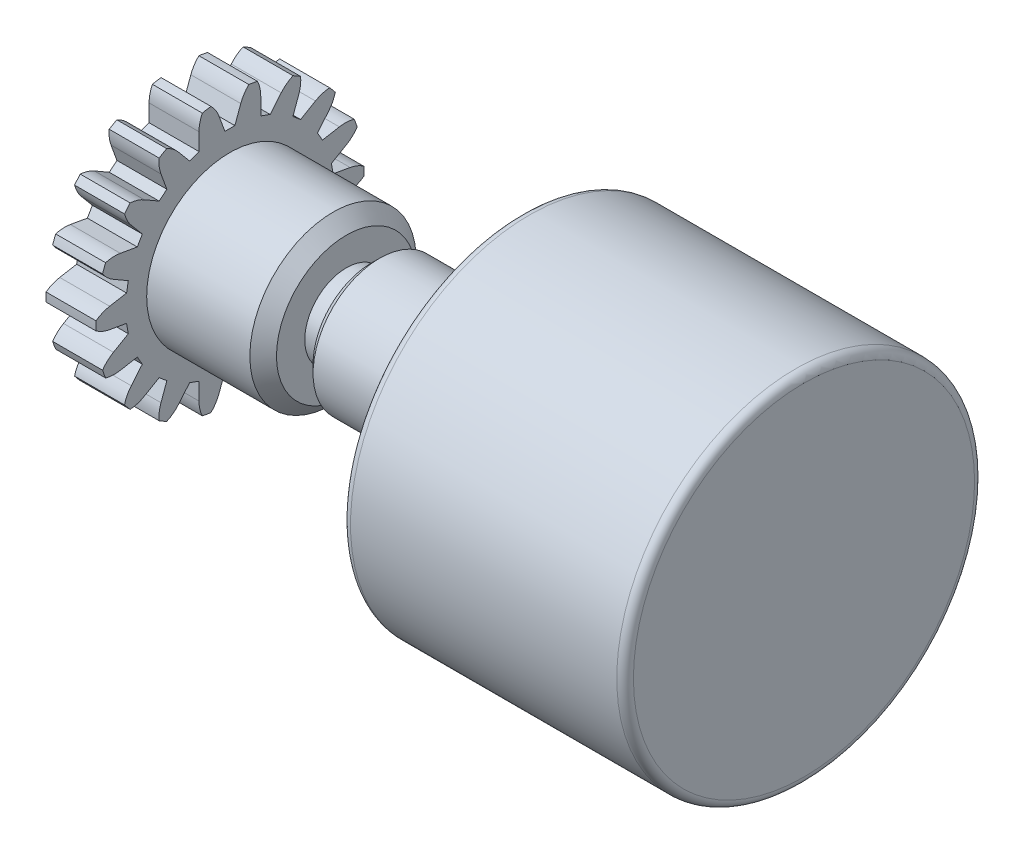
ISO-10303-21;
HEADER;
FILE_DESCRIPTION(('STEP AP214'),'2;1');
FILE_NAME('part.step','',(''),(''),'','','');
FILE_SCHEMA(('AUTOMOTIVE_DESIGN { 1 0 10303 214 1 1 1 1 }'));
ENDSEC;
DATA;
#1=APPLICATION_CONTEXT('core data for automotive mechanical design processes');
#2=APPLICATION_PROTOCOL_DEFINITION('international standard','automotive_design',2000,#1);
#3=PRODUCT_CONTEXT('',#1,'mechanical');
#4=PRODUCT('Part','Part','',(#3));
#5=PRODUCT_RELATED_PRODUCT_CATEGORY('part','',(#4));
#6=PRODUCT_DEFINITION_FORMATION('','',#4);
#7=PRODUCT_DEFINITION_CONTEXT('part definition',#1,'design');
#8=PRODUCT_DEFINITION('design','',#6,#7);
#9=PRODUCT_DEFINITION_SHAPE('','',#8);
#10=(LENGTH_UNIT() NAMED_UNIT(*) SI_UNIT(.MILLI.,.METRE.));
#11=(NAMED_UNIT(*) PLANE_ANGLE_UNIT() SI_UNIT($,.RADIAN.));
#12=(NAMED_UNIT(*) SI_UNIT($,.STERADIAN.) SOLID_ANGLE_UNIT());
#13=UNCERTAINTY_MEASURE_WITH_UNIT(LENGTH_MEASURE(1.E-05),#10,'distance_accuracy_value','');
#14=(GEOMETRIC_REPRESENTATION_CONTEXT(3) GLOBAL_UNCERTAINTY_ASSIGNED_CONTEXT((#13)) GLOBAL_UNIT_ASSIGNED_CONTEXT((#10,
#11,#12)) REPRESENTATION_CONTEXT('',''));
#15=CARTESIAN_POINT('',(0.,0.,0.));
#16=DIRECTION('',(0.,0.,1.));
#17=DIRECTION('',(1.,0.,0.));
#18=AXIS2_PLACEMENT_3D('',#15,#16,#17);
#19=CARTESIAN_POINT('',(20.,0.,0.));
#20=DIRECTION('',(-1.,0.,0.));
#21=DIRECTION('',(0.,0.,1.));
#22=AXIS2_PLACEMENT_3D('',#19,#20,#21);
#23=PLANE('',#22);
#24=CARTESIAN_POINT('',(20.,0.,0.));
#25=DIRECTION('',(-1.,0.,0.));
#26=DIRECTION('',(0.,0.,1.));
#27=AXIS2_PLACEMENT_3D('',#24,#25,#26);
#28=CIRCLE('',#27,6.);
#29=CARTESIAN_POINT('',(20.,0.,6.));
#30=VERTEX_POINT('',#29);
#31=EDGE_CURVE('E12',#30,#30,#28,.T.);
#32=ORIENTED_EDGE('',*,*,#31,.T.);
#33=EDGE_LOOP('',(#32));
#34=FACE_BOUND('',#33,.T.);
#35=CARTESIAN_POINT('',(20.,0.,0.));
#36=DIRECTION('',(-1.,0.,0.));
#37=DIRECTION('',(0.,0.,1.));
#38=AXIS2_PLACEMENT_3D('',#35,#36,#37);
#39=CIRCLE('',#38,4.);
#40=CARTESIAN_POINT('',(20.,0.,4.));
#41=VERTEX_POINT('',#40);
#42=EDGE_CURVE('E64',#41,#41,#39,.T.);
#43=ORIENTED_EDGE('',*,*,#42,.F.);
#44=EDGE_LOOP('',(#43));
#45=FACE_BOUND('',#44,.T.);
#46=ADVANCED_FACE('F53',(#34,#45),#23,.T.);
#47=CARTESIAN_POINT('',(20.5,0.,0.));
#48=DIRECTION('',(-1.,0.,0.));
#49=DIRECTION('',(0.,0.,1.));
#50=AXIS2_PLACEMENT_3D('',#47,#48,#49);
#51=PLANE('',#50);
#52=CARTESIAN_POINT('',(20.5,0.,0.));
#53=DIRECTION('',(-1.,0.,0.));
#54=DIRECTION('',(0.,0.,1.));
#55=AXIS2_PLACEMENT_3D('',#52,#53,#54);
#56=CIRCLE('',#55,6.);
#57=CARTESIAN_POINT('',(20.5,0.,6.));
#58=VERTEX_POINT('',#57);
#59=EDGE_CURVE('E57',#58,#58,#56,.T.);
#60=ORIENTED_EDGE('',*,*,#59,.F.);
#61=EDGE_LOOP('',(#60));
#62=FACE_BOUND('',#61,.T.);
#63=CARTESIAN_POINT('',(20.5,0.,0.));
#64=DIRECTION('',(-1.,0.,0.));
#65=DIRECTION('',(0.,0.,1.));
#66=AXIS2_PLACEMENT_3D('',#63,#64,#65);
#67=CIRCLE('',#66,4.);
#68=CARTESIAN_POINT('',(20.5,0.,4.));
#69=VERTEX_POINT('',#68);
#70=EDGE_CURVE('E66',#69,#69,#67,.T.);
#71=ORIENTED_EDGE('',*,*,#70,.T.);
#72=EDGE_LOOP('',(#71));
#73=FACE_BOUND('',#72,.T.);
#74=ADVANCED_FACE('F76',(#62,#73),#51,.F.);
#75=CARTESIAN_POINT('',(20.,0.,0.));
#76=DIRECTION('',(1.,0.,0.));
#77=DIRECTION('',(0.,0.,-1.));
#78=AXIS2_PLACEMENT_3D('',#75,#76,#77);
#79=CYLINDRICAL_SURFACE('',#78,6.);
#80=ORIENTED_EDGE('',*,*,#31,.F.);
#81=EDGE_LOOP('',(#80));
#82=FACE_BOUND('',#81,.T.);
#83=ORIENTED_EDGE('',*,*,#59,.T.);
#84=EDGE_LOOP('',(#83));
#85=FACE_BOUND('',#84,.T.);
#86=ADVANCED_FACE('F55',(#82,#85),#79,.T.);
#87=CARTESIAN_POINT('',(20.,0.,0.));
#88=DIRECTION('',(1.,0.,0.));
#89=DIRECTION('',(0.,0.,-1.));
#90=AXIS2_PLACEMENT_3D('',#87,#88,#89);
#91=CYLINDRICAL_SURFACE('',#90,4.);
#92=ORIENTED_EDGE('',*,*,#42,.T.);
#93=EDGE_LOOP('',(#92));
#94=FACE_BOUND('',#93,.T.);
#95=ORIENTED_EDGE('',*,*,#70,.F.);
#96=EDGE_LOOP('',(#95));
#97=FACE_BOUND('',#96,.T.);
#98=ADVANCED_FACE('F72',(#94,#97),#91,.F.);
#99=CLOSED_SHELL('',(#46,#74,#86,#98));
#100=MANIFOLD_SOLID_BREP('B2',#99);
#101=CARTESIAN_POINT('',(10.,-5.,0.));
#102=DIRECTION('',(-1.,0.,0.));
#103=DIRECTION('',(0.,0.,1.));
#104=AXIS2_PLACEMENT_3D('',#101,#102,#103);
#105=PLANE('',#104);
#106=CARTESIAN_POINT('',(10.,0.,0.));
#107=DIRECTION('',(-1.,0.,0.));
#108=DIRECTION('',(0.,0.,1.));
#109=AXIS2_PLACEMENT_3D('',#106,#107,#108);
#110=CIRCLE('',#109,4.2);
#111=CARTESIAN_POINT('',(10.,0.,4.2));
#112=VERTEX_POINT('',#111);
#113=EDGE_CURVE('E1581',#112,#112,#110,.F.);
#114=ORIENTED_EDGE('',*,*,#113,.T.);
#115=EDGE_LOOP('',(#114));
#116=FACE_BOUND('',#115,.T.);
#117=CARTESIAN_POINT('',(10.,0.,0.));
#118=DIRECTION('',(-1.,0.,0.));
#119=DIRECTION('',(0.,0.,1.));
#120=AXIS2_PLACEMENT_3D('',#117,#118,#119);
#121=CIRCLE('',#120,2.5);
#122=CARTESIAN_POINT('',(10.,0.,2.5));
#123=VERTEX_POINT('',#122);
#124=EDGE_CURVE('E1584',#123,#123,#121,.F.);
#125=ORIENTED_EDGE('',*,*,#124,.F.);
#126=EDGE_LOOP('',(#125));
#127=FACE_BOUND('',#126,.T.);
#128=ADVANCED_FACE('F115',(#116,#127),#105,.F.);
#129=CARTESIAN_POINT('',(-19.4483135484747,0.,0.));
#130=DIRECTION('',(-1.,0.,0.));
#131=DIRECTION('',(0.,0.,1.));
#132=AXIS2_PLACEMENT_3D('',#129,#130,#131);
#133=CYLINDRICAL_SURFACE('',#132,8.05);
#134=CARTESIAN_POINT('',(0.,0.,0.));
#135=DIRECTION('',(-1.,0.,0.));
#136=DIRECTION('',(0.,0.,1.));
#137=AXIS2_PLACEMENT_3D('',#134,#135,#136);
#138=CIRCLE('',#137,8.05);
#139=CARTESIAN_POINT('',(0.,7.09932678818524,-3.79500449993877));
#140=VERTEX_POINT('',#139);
#141=CARTESIAN_POINT('',(0.,6.83581351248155,-4.25137079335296));
#142=VERTEX_POINT('',#141);
#143=EDGE_CURVE('E1311',#140,#142,#138,.T.);
#144=ORIENTED_EDGE('',*,*,#143,.F.);
#145=DIRECTION('',(-1.,0.,0.));
#146=VECTOR('',#145,1.);
#147=CARTESIAN_POINT('',(1.5,7.09932678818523,-3.79500449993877));
#148=LINE('',#147,#146);
#149=CARTESIAN_POINT('',(3.,7.09932678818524,-3.79500449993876));
#150=VERTEX_POINT('',#149);
#151=EDGE_CURVE('E1266',#140,#150,#148,.F.);
#152=ORIENTED_EDGE('',*,*,#151,.T.);
#153=CARTESIAN_POINT('',(3.,0.,0.));
#154=DIRECTION('',(-1.,0.,0.));
#155=DIRECTION('',(0.,0.,1.));
#156=AXIS2_PLACEMENT_3D('',#153,#154,#155);
#157=CIRCLE('',#156,8.05);
#158=CARTESIAN_POINT('',(3.,6.83581351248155,-4.25137079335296));
#159=VERTEX_POINT('',#158);
#160=EDGE_CURVE('E1306',#150,#159,#157,.T.);
#161=ORIENTED_EDGE('',*,*,#160,.T.);
#162=DIRECTION('',(-1.,0.,0.));
#163=VECTOR('',#162,1.);
#164=CARTESIAN_POINT('',(1.5,6.83581351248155,-4.25137079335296));
#165=LINE('',#164,#163);
#166=EDGE_CURVE('E1260',#159,#142,#165,.T.);
#167=ORIENTED_EDGE('',*,*,#166,.T.);
#168=EDGE_LOOP('',(#144,#152,#161,#167));
#169=FACE_BOUND('',#168,.T.);
#170=ADVANCED_FACE('F1630',(#169),#133,.T.);
#171=CARTESIAN_POINT('',(3.,7.96915297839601,-1.1380249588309));
#172=VERTEX_POINT('',#171);
#173=CARTESIAN_POINT('',(3.,7.87761796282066,-1.65699584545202));
#174=VERTEX_POINT('',#173);
#175=EDGE_CURVE('E1302',#172,#174,#157,.T.);
#176=ORIENTED_EDGE('',*,*,#175,.T.);
#177=DIRECTION('',(-1.,0.,0.));
#178=VECTOR('',#177,1.);
#179=CARTESIAN_POINT('',(5.,7.87761796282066,-1.65699584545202));
#180=LINE('',#179,#178);
#181=CARTESIAN_POINT('',(0.,7.87761796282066,-1.65699584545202));
#182=VERTEX_POINT('',#181);
#183=EDGE_CURVE('E1263',#174,#182,#180,.T.);
#184=ORIENTED_EDGE('',*,*,#183,.T.);
#185=CARTESIAN_POINT('',(0.,7.96915297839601,-1.1380249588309));
#186=VERTEX_POINT('',#185);
#187=EDGE_CURVE('E1307',#186,#182,#138,.T.);
#188=ORIENTED_EDGE('',*,*,#187,.F.);
#189=DIRECTION('',(-1.,0.,0.));
#190=VECTOR('',#189,1.);
#191=CARTESIAN_POINT('',(5.,7.96915297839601,-1.1380249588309));
#192=LINE('',#191,#190);
#193=EDGE_CURVE('E1295',#186,#172,#192,.F.);
#194=ORIENTED_EDGE('',*,*,#193,.T.);
#195=EDGE_LOOP('',(#176,#184,#188,#194));
#196=FACE_BOUND('',#195,.T.);
#197=ADVANCED_FACE('F1636',(#196),#133,.T.);
#198=CARTESIAN_POINT('',(0.,5.37321701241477,-5.99425049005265));
#199=VERTEX_POINT('',#198);
#200=CARTESIAN_POINT('',(0.,4.96950906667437,-6.332967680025));
#201=VERTEX_POINT('',#200);
#202=EDGE_CURVE('E1792',#199,#201,#138,.T.);
#203=ORIENTED_EDGE('',*,*,#202,.F.);
#204=DIRECTION('',(-1.,0.,0.));
#205=VECTOR('',#204,1.);
#206=CARTESIAN_POINT('',(1.5,5.37321701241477,-5.99425049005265));
#207=LINE('',#206,#205);
#208=CARTESIAN_POINT('',(3.,5.37321701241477,-5.99425049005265));
#209=VERTEX_POINT('',#208);
#210=EDGE_CURVE('E1257',#199,#209,#207,.F.);
#211=ORIENTED_EDGE('',*,*,#210,.T.);
#212=CARTESIAN_POINT('',(3.,4.96950906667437,-6.332967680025));
#213=VERTEX_POINT('',#212);
#214=EDGE_CURVE('E1777',#209,#213,#157,.T.);
#215=ORIENTED_EDGE('',*,*,#214,.T.);
#216=DIRECTION('',(-1.,0.,0.));
#217=VECTOR('',#216,1.);
#218=CARTESIAN_POINT('',(1.5,4.96950906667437,-6.332967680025));
#219=LINE('',#218,#217);
#220=EDGE_CURVE('E1254',#213,#201,#219,.T.);
#221=ORIENTED_EDGE('',*,*,#220,.T.);
#222=EDGE_LOOP('',(#203,#211,#215,#221));
#223=FACE_BOUND('',#222,.T.);
#224=ADVANCED_FACE('F2199',(#223),#133,.T.);
#225=CARTESIAN_POINT('',(0.,2.99901796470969,-7.47050140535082));
#226=VERTEX_POINT('',#225);
#227=CARTESIAN_POINT('',(0.,2.50380848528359,-7.65071519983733));
#228=VERTEX_POINT('',#227);
#229=EDGE_CURVE('E1794',#226,#228,#138,.T.);
#230=ORIENTED_EDGE('',*,*,#229,.F.);
#231=DIRECTION('',(-1.,0.,0.));
#232=VECTOR('',#231,1.);
#233=CARTESIAN_POINT('',(1.5,2.99901796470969,-7.47050140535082));
#234=LINE('',#233,#232);
#235=CARTESIAN_POINT('',(3.,2.99901796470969,-7.47050140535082));
#236=VERTEX_POINT('',#235);
#237=EDGE_CURVE('E1251',#226,#236,#234,.F.);
#238=ORIENTED_EDGE('',*,*,#237,.T.);
#239=CARTESIAN_POINT('',(3.,2.50380848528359,-7.65071519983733));
#240=VERTEX_POINT('',#239);
#241=EDGE_CURVE('E1773',#236,#240,#157,.T.);
#242=ORIENTED_EDGE('',*,*,#241,.T.);
#243=DIRECTION('',(-1.,0.,0.));
#244=VECTOR('',#243,1.);
#245=CARTESIAN_POINT('',(1.5,2.50380848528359,-7.65071519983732));
#246=LINE('',#245,#244);
#247=EDGE_CURVE('E1248',#240,#228,#246,.T.);
#248=ORIENTED_EDGE('',*,*,#247,.T.);
#249=EDGE_LOOP('',(#230,#238,#242,#248));
#250=FACE_BOUND('',#249,.T.);
#251=ADVANCED_FACE('F2203',(#250),#133,.T.);
#252=CARTESIAN_POINT('',(0.,0.263093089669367,-8.04569959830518));
#253=VERTEX_POINT('',#252);
#254=CARTESIAN_POINT('',(0.,-0.263888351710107,-8.04567355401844));
#255=VERTEX_POINT('',#254);
#256=EDGE_CURVE('E1799',#253,#255,#138,.T.);
#257=ORIENTED_EDGE('',*,*,#256,.F.);
#258=DIRECTION('',(-1.,0.,0.));
#259=VECTOR('',#258,1.);
#260=CARTESIAN_POINT('',(1.5,0.263093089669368,-8.04569959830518));
#261=LINE('',#260,#259);
#262=CARTESIAN_POINT('',(3.,0.263093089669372,-8.04569959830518));
#263=VERTEX_POINT('',#262);
#264=EDGE_CURVE('E1245',#253,#263,#261,.F.);
#265=ORIENTED_EDGE('',*,*,#264,.T.);
#266=CARTESIAN_POINT('',(3.,-0.26388835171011,-8.04567355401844));
#267=VERTEX_POINT('',#266);
#268=EDGE_CURVE('E1769',#263,#267,#157,.T.);
#269=ORIENTED_EDGE('',*,*,#268,.T.);
#270=DIRECTION('',(-1.,0.,0.));
#271=VECTOR('',#270,1.);
#272=CARTESIAN_POINT('',(1.5,-0.263888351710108,-8.04567355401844));
#273=LINE('',#272,#271);
#274=EDGE_CURVE('E1242',#267,#255,#273,.T.);
#275=ORIENTED_EDGE('',*,*,#274,.T.);
#276=EDGE_LOOP('',(#257,#265,#269,#275));
#277=FACE_BOUND('',#276,.T.);
#278=ADVANCED_FACE('F2207',(#277),#133,.T.);
#279=CARTESIAN_POINT('',(0.,-2.50456469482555,-7.65046767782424));
#280=VERTEX_POINT('',#279);
#281=CARTESIAN_POINT('',(0.,-2.99975635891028,-7.47020493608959));
#282=VERTEX_POINT('',#281);
#283=EDGE_CURVE('E1804',#280,#282,#138,.T.);
#284=ORIENTED_EDGE('',*,*,#283,.F.);
#285=DIRECTION('',(-1.,0.,0.));
#286=VECTOR('',#285,1.);
#287=CARTESIAN_POINT('',(1.5,-2.50456469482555,-7.65046767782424));
#288=LINE('',#287,#286);
#289=CARTESIAN_POINT('',(3.,-2.50456469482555,-7.65046767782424));
#290=VERTEX_POINT('',#289);
#291=EDGE_CURVE('E1239',#280,#290,#288,.F.);
#292=ORIENTED_EDGE('',*,*,#291,.T.);
#293=CARTESIAN_POINT('',(3.,-2.99975635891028,-7.47020493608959));
#294=VERTEX_POINT('',#293);
#295=EDGE_CURVE('E1765',#290,#294,#157,.T.);
#296=ORIENTED_EDGE('',*,*,#295,.T.);
#297=DIRECTION('',(-1.,0.,0.));
#298=VECTOR('',#297,1.);
#299=CARTESIAN_POINT('',(1.5,-2.99975635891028,-7.47020493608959));
#300=LINE('',#299,#298);
#301=EDGE_CURVE('E1236',#294,#282,#300,.T.);
#302=ORIENTED_EDGE('',*,*,#301,.T.);
#303=EDGE_LOOP('',(#284,#292,#296,#302));
#304=FACE_BOUND('',#303,.T.);
#305=ADVANCED_FACE('F2230',(#304),#133,.T.);
#306=CARTESIAN_POINT('',(0.,-4.97013501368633,-6.33247644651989));
#307=VERTEX_POINT('',#306);
#308=CARTESIAN_POINT('',(0.,-5.37380947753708,-5.99371935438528));
#309=VERTEX_POINT('',#308);
#310=EDGE_CURVE('E1809',#307,#309,#138,.T.);
#311=ORIENTED_EDGE('',*,*,#310,.F.);
#312=DIRECTION('',(-1.,0.,0.));
#313=VECTOR('',#312,1.);
#314=CARTESIAN_POINT('',(1.5,-4.97013501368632,-6.33247644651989));
#315=LINE('',#314,#313);
#316=CARTESIAN_POINT('',(3.,-4.97013501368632,-6.33247644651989));
#317=VERTEX_POINT('',#316);
#318=EDGE_CURVE('E1233',#307,#317,#315,.F.);
#319=ORIENTED_EDGE('',*,*,#318,.T.);
#320=CARTESIAN_POINT('',(3.,-5.37380947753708,-5.99371935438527));
#321=VERTEX_POINT('',#320);
#322=EDGE_CURVE('E1761',#317,#321,#157,.T.);
#323=ORIENTED_EDGE('',*,*,#322,.T.);
#324=DIRECTION('',(-1.,0.,0.));
#325=VECTOR('',#324,1.);
#326=CARTESIAN_POINT('',(1.5,-5.37380947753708,-5.99371935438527));
#327=LINE('',#326,#325);
#328=EDGE_CURVE('E1230',#321,#309,#327,.T.);
#329=ORIENTED_EDGE('',*,*,#328,.T.);
#330=EDGE_LOOP('',(#311,#319,#323,#329));
#331=FACE_BOUND('',#330,.T.);
#332=ADVANCED_FACE('F2232',(#331),#133,.T.);
#333=CARTESIAN_POINT('',(0.,-6.83623369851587,-4.25069509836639));
#334=VERTEX_POINT('',#333);
#335=CARTESIAN_POINT('',(0.,-7.09970186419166,-3.79430276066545));
#336=VERTEX_POINT('',#335);
#337=EDGE_CURVE('E1814',#334,#336,#138,.T.);
#338=ORIENTED_EDGE('',*,*,#337,.F.);
#339=DIRECTION('',(-1.,0.,0.));
#340=VECTOR('',#339,1.);
#341=CARTESIAN_POINT('',(1.5,-6.83623369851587,-4.25069509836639));
#342=LINE('',#341,#340);
#343=CARTESIAN_POINT('',(3.,-6.83623369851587,-4.25069509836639));
#344=VERTEX_POINT('',#343);
#345=EDGE_CURVE('E1227',#334,#344,#342,.F.);
#346=ORIENTED_EDGE('',*,*,#345,.T.);
#347=CARTESIAN_POINT('',(3.,-7.09970186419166,-3.79430276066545));
#348=VERTEX_POINT('',#347);
#349=EDGE_CURVE('E1757',#344,#348,#157,.T.);
#350=ORIENTED_EDGE('',*,*,#349,.T.);
#351=DIRECTION('',(-1.,0.,0.));
#352=VECTOR('',#351,1.);
#353=CARTESIAN_POINT('',(1.5,-7.09970186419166,-3.79430276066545));
#354=LINE('',#353,#352);
#355=EDGE_CURVE('E1224',#348,#336,#354,.T.);
#356=ORIENTED_EDGE('',*,*,#355,.T.);
#357=EDGE_LOOP('',(#338,#346,#350,#356));
#358=FACE_BOUND('',#357,.T.);
#359=ADVANCED_FACE('F2237',(#358),#133,.T.);
#360=CARTESIAN_POINT('',(0.,-7.87778170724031,-1.65621718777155));
#361=VERTEX_POINT('',#360);
#362=CARTESIAN_POINT('',(0.,-7.96926542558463,-1.13723725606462));
#363=VERTEX_POINT('',#362);
#364=EDGE_CURVE('E1819',#361,#363,#138,.T.);
#365=ORIENTED_EDGE('',*,*,#364,.F.);
#366=DIRECTION('',(-1.,0.,0.));
#367=VECTOR('',#366,1.);
#368=CARTESIAN_POINT('',(1.5,-7.87778170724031,-1.65621718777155));
#369=LINE('',#368,#367);
#370=CARTESIAN_POINT('',(3.,-7.87778170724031,-1.65621718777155));
#371=VERTEX_POINT('',#370);
#372=EDGE_CURVE('E1221',#361,#371,#369,.F.);
#373=ORIENTED_EDGE('',*,*,#372,.T.);
#374=CARTESIAN_POINT('',(3.,-7.96926542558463,-1.13723725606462));
#375=VERTEX_POINT('',#374);
#376=EDGE_CURVE('E1753',#371,#375,#157,.T.);
#377=ORIENTED_EDGE('',*,*,#376,.T.);
#378=DIRECTION('',(-1.,0.,0.));
#379=VECTOR('',#378,1.);
#380=CARTESIAN_POINT('',(1.5,-7.96926542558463,-1.13723725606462));
#381=LINE('',#380,#379);
#382=EDGE_CURVE('E1218',#375,#363,#381,.T.);
#383=ORIENTED_EDGE('',*,*,#382,.T.);
#384=EDGE_LOOP('',(#365,#373,#377,#383));
#385=FACE_BOUND('',#384,.T.);
#386=ADVANCED_FACE('F2356',(#385),#133,.T.);
#387=CARTESIAN_POINT('',(0.,-7.96915297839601,1.1380249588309));
#388=VERTEX_POINT('',#387);
#389=CARTESIAN_POINT('',(0.,-7.87761796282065,1.65699584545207));
#390=VERTEX_POINT('',#389);
#391=EDGE_CURVE('E1824',#388,#390,#138,.T.);
#392=ORIENTED_EDGE('',*,*,#391,.F.);
#393=DIRECTION('',(-1.,0.,0.));
#394=VECTOR('',#393,1.);
#395=CARTESIAN_POINT('',(1.5,-7.96915297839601,1.1380249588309));
#396=LINE('',#395,#394);
#397=CARTESIAN_POINT('',(3.,-7.96915297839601,1.1380249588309));
#398=VERTEX_POINT('',#397);
#399=EDGE_CURVE('E1215',#388,#398,#396,.F.);
#400=ORIENTED_EDGE('',*,*,#399,.T.);
#401=CARTESIAN_POINT('',(3.,-7.87761796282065,1.65699584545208));
#402=VERTEX_POINT('',#401);
#403=EDGE_CURVE('E1749',#398,#402,#157,.T.);
#404=ORIENTED_EDGE('',*,*,#403,.T.);
#405=DIRECTION('',(-1.,0.,0.));
#406=VECTOR('',#405,1.);
#407=CARTESIAN_POINT('',(1.5,-7.87761796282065,1.65699584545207));
#408=LINE('',#407,#406);
#409=EDGE_CURVE('E1212',#402,#390,#408,.T.);
#410=ORIENTED_EDGE('',*,*,#409,.T.);
#411=EDGE_LOOP('',(#392,#400,#404,#410));
#412=FACE_BOUND('',#411,.T.);
#413=ADVANCED_FACE('F2350',(#412),#133,.T.);
#414=CARTESIAN_POINT('',(0.,-7.09932678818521,3.79500449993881));
#415=VERTEX_POINT('',#414);
#416=CARTESIAN_POINT('',(0.,-6.83581351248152,4.25137079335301));
#417=VERTEX_POINT('',#416);
#418=EDGE_CURVE('E1829',#415,#417,#138,.T.);
#419=ORIENTED_EDGE('',*,*,#418,.F.);
#420=DIRECTION('',(-1.,0.,0.));
#421=VECTOR('',#420,1.);
#422=CARTESIAN_POINT('',(1.5,-7.09932678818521,3.79500449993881));
#423=LINE('',#422,#421);
#424=CARTESIAN_POINT('',(3.,-7.09932678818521,3.79500449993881));
#425=VERTEX_POINT('',#424);
#426=EDGE_CURVE('E1209',#415,#425,#423,.F.);
#427=ORIENTED_EDGE('',*,*,#426,.T.);
#428=CARTESIAN_POINT('',(3.,-6.83581351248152,4.25137079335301));
#429=VERTEX_POINT('',#428);
#430=EDGE_CURVE('E1745',#425,#429,#157,.T.);
#431=ORIENTED_EDGE('',*,*,#430,.T.);
#432=DIRECTION('',(-1.,0.,0.));
#433=VECTOR('',#432,1.);
#434=CARTESIAN_POINT('',(1.5,-6.83581351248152,4.25137079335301));
#435=LINE('',#434,#433);
#436=EDGE_CURVE('E1206',#429,#417,#435,.T.);
#437=ORIENTED_EDGE('',*,*,#436,.T.);
#438=EDGE_LOOP('',(#419,#427,#431,#437));
#439=FACE_BOUND('',#438,.T.);
#440=ADVANCED_FACE('F2344',(#439),#133,.T.);
#441=CARTESIAN_POINT('',(0.,-5.37321701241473,5.99425049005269));
#442=VERTEX_POINT('',#441);
#443=CARTESIAN_POINT('',(0.,-4.96950906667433,6.33296768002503));
#444=VERTEX_POINT('',#443);
#445=EDGE_CURVE('E1834',#442,#444,#138,.T.);
#446=ORIENTED_EDGE('',*,*,#445,.F.);
#447=DIRECTION('',(-1.,0.,0.));
#448=VECTOR('',#447,1.);
#449=CARTESIAN_POINT('',(1.5,-5.37321701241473,5.99425049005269));
#450=LINE('',#449,#448);
#451=CARTESIAN_POINT('',(3.,-5.37321701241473,5.99425049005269));
#452=VERTEX_POINT('',#451);
#453=EDGE_CURVE('E1203',#442,#452,#450,.F.);
#454=ORIENTED_EDGE('',*,*,#453,.T.);
#455=CARTESIAN_POINT('',(3.,-4.96950906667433,6.33296768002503));
#456=VERTEX_POINT('',#455);
#457=EDGE_CURVE('E1741',#452,#456,#157,.T.);
#458=ORIENTED_EDGE('',*,*,#457,.T.);
#459=DIRECTION('',(-1.,0.,0.));
#460=VECTOR('',#459,1.);
#461=CARTESIAN_POINT('',(1.5,-4.96950906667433,6.33296768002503));
#462=LINE('',#461,#460);
#463=EDGE_CURVE('E1200',#456,#444,#462,.T.);
#464=ORIENTED_EDGE('',*,*,#463,.T.);
#465=EDGE_LOOP('',(#446,#454,#458,#464));
#466=FACE_BOUND('',#465,.T.);
#467=ADVANCED_FACE('F2338',(#466),#133,.T.);
#468=CARTESIAN_POINT('',(0.,-2.99901796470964,7.47050140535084));
#469=VERTEX_POINT('',#468);
#470=CARTESIAN_POINT('',(0.,-2.50380848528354,7.65071519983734));
#471=VERTEX_POINT('',#470);
#472=EDGE_CURVE('E1839',#469,#471,#138,.T.);
#473=ORIENTED_EDGE('',*,*,#472,.F.);
#474=DIRECTION('',(-1.,0.,0.));
#475=VECTOR('',#474,1.);
#476=CARTESIAN_POINT('',(1.5,-2.99901796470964,7.47050140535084));
#477=LINE('',#476,#475);
#478=CARTESIAN_POINT('',(3.,-2.99901796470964,7.47050140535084));
#479=VERTEX_POINT('',#478);
#480=EDGE_CURVE('E1197',#469,#479,#477,.F.);
#481=ORIENTED_EDGE('',*,*,#480,.T.);
#482=CARTESIAN_POINT('',(3.,-2.50380848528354,7.65071519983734));
#483=VERTEX_POINT('',#482);
#484=EDGE_CURVE('E1737',#479,#483,#157,.T.);
#485=ORIENTED_EDGE('',*,*,#484,.T.);
#486=DIRECTION('',(-1.,0.,0.));
#487=VECTOR('',#486,1.);
#488=CARTESIAN_POINT('',(1.5,-2.50380848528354,7.65071519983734));
#489=LINE('',#488,#487);
#490=EDGE_CURVE('E1194',#483,#471,#489,.T.);
#491=ORIENTED_EDGE('',*,*,#490,.T.);
#492=EDGE_LOOP('',(#473,#481,#485,#491));
#493=FACE_BOUND('',#492,.T.);
#494=ADVANCED_FACE('F2332',(#493),#133,.T.);
#495=CARTESIAN_POINT('',(0.,-0.263093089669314,8.04569959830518));
#496=VERTEX_POINT('',#495);
#497=CARTESIAN_POINT('',(0.,0.263888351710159,8.04567355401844));
#498=VERTEX_POINT('',#497);
#499=EDGE_CURVE('E1844',#496,#498,#138,.T.);
#500=ORIENTED_EDGE('',*,*,#499,.F.);
#501=DIRECTION('',(-1.,0.,0.));
#502=VECTOR('',#501,1.);
#503=CARTESIAN_POINT('',(1.5,-0.263093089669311,8.04569959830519));
#504=LINE('',#503,#502);
#505=CARTESIAN_POINT('',(3.,-0.26309308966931,8.04569959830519));
#506=VERTEX_POINT('',#505);
#507=EDGE_CURVE('E1191',#496,#506,#504,.F.);
#508=ORIENTED_EDGE('',*,*,#507,.T.);
#509=CARTESIAN_POINT('',(3.,0.263888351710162,8.04567355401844));
#510=VERTEX_POINT('',#509);
#511=EDGE_CURVE('E1733',#506,#510,#157,.T.);
#512=ORIENTED_EDGE('',*,*,#511,.T.);
#513=DIRECTION('',(-1.,0.,0.));
#514=VECTOR('',#513,1.);
#515=CARTESIAN_POINT('',(1.5,0.26388835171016,8.04567355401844));
#516=LINE('',#515,#514);
#517=EDGE_CURVE('E1188',#510,#498,#516,.T.);
#518=ORIENTED_EDGE('',*,*,#517,.T.);
#519=EDGE_LOOP('',(#500,#508,#512,#518));
#520=FACE_BOUND('',#519,.T.);
#521=ADVANCED_FACE('F2326',(#520),#133,.T.);
#522=CARTESIAN_POINT('',(0.,2.5045646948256,7.65046767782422));
#523=VERTEX_POINT('',#522);
#524=CARTESIAN_POINT('',(0.,2.99975635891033,7.47020493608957));
#525=VERTEX_POINT('',#524);
#526=EDGE_CURVE('E1849',#523,#525,#138,.T.);
#527=ORIENTED_EDGE('',*,*,#526,.F.);
#528=DIRECTION('',(-1.,0.,0.));
#529=VECTOR('',#528,1.);
#530=CARTESIAN_POINT('',(1.5,2.5045646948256,7.65046767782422));
#531=LINE('',#530,#529);
#532=CARTESIAN_POINT('',(3.,2.5045646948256,7.65046767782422));
#533=VERTEX_POINT('',#532);
#534=EDGE_CURVE('E1185',#523,#533,#531,.F.);
#535=ORIENTED_EDGE('',*,*,#534,.T.);
#536=CARTESIAN_POINT('',(3.,2.99975635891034,7.47020493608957));
#537=VERTEX_POINT('',#536);
#538=EDGE_CURVE('E1729',#533,#537,#157,.T.);
#539=ORIENTED_EDGE('',*,*,#538,.T.);
#540=DIRECTION('',(-1.,0.,0.));
#541=VECTOR('',#540,1.);
#542=CARTESIAN_POINT('',(1.5,2.99975635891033,7.47020493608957));
#543=LINE('',#542,#541);
#544=EDGE_CURVE('E1182',#537,#525,#543,.T.);
#545=ORIENTED_EDGE('',*,*,#544,.T.);
#546=EDGE_LOOP('',(#527,#535,#539,#545));
#547=FACE_BOUND('',#546,.T.);
#548=ADVANCED_FACE('F2320',(#547),#133,.T.);
#549=CARTESIAN_POINT('',(0.,4.97013501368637,6.33247644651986));
#550=VERTEX_POINT('',#549);
#551=CARTESIAN_POINT('',(0.,5.37380947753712,5.99371935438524));
#552=VERTEX_POINT('',#551);
#553=EDGE_CURVE('E1854',#550,#552,#138,.T.);
#554=ORIENTED_EDGE('',*,*,#553,.F.);
#555=DIRECTION('',(-1.,0.,0.));
#556=VECTOR('',#555,1.);
#557=CARTESIAN_POINT('',(1.5,4.97013501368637,6.33247644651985));
#558=LINE('',#557,#556);
#559=CARTESIAN_POINT('',(3.,4.97013501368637,6.33247644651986));
#560=VERTEX_POINT('',#559);
#561=EDGE_CURVE('E1179',#550,#560,#558,.F.);
#562=ORIENTED_EDGE('',*,*,#561,.T.);
#563=CARTESIAN_POINT('',(3.,5.37380947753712,5.99371935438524));
#564=VERTEX_POINT('',#563);
#565=EDGE_CURVE('E1725',#560,#564,#157,.T.);
#566=ORIENTED_EDGE('',*,*,#565,.T.);
#567=DIRECTION('',(-1.,0.,0.));
#568=VECTOR('',#567,1.);
#569=CARTESIAN_POINT('',(5.,5.37380947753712,5.99371935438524));
#570=LINE('',#569,#568);
#571=EDGE_CURVE('E1176',#564,#552,#570,.T.);
#572=ORIENTED_EDGE('',*,*,#571,.T.);
#573=EDGE_LOOP('',(#554,#562,#566,#572));
#574=FACE_BOUND('',#573,.T.);
#575=ADVANCED_FACE('F2315',(#574),#133,.T.);
#576=CARTESIAN_POINT('',(0.,6.8362336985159,4.25069509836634));
#577=VERTEX_POINT('',#576);
#578=CARTESIAN_POINT('',(0.,7.09970186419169,3.7943027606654));
#579=VERTEX_POINT('',#578);
#580=EDGE_CURVE('E1859',#577,#579,#138,.T.);
#581=ORIENTED_EDGE('',*,*,#580,.F.);
#582=DIRECTION('',(-1.,0.,0.));
#583=VECTOR('',#582,1.);
#584=CARTESIAN_POINT('',(1.5,6.8362336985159,4.25069509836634));
#585=LINE('',#584,#583);
#586=CARTESIAN_POINT('',(3.,6.8362336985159,4.25069509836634));
#587=VERTEX_POINT('',#586);
#588=EDGE_CURVE('E1173',#577,#587,#585,.F.);
#589=ORIENTED_EDGE('',*,*,#588,.T.);
#590=CARTESIAN_POINT('',(3.,7.09970186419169,3.7943027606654));
#591=VERTEX_POINT('',#590);
#592=EDGE_CURVE('E1723',#587,#591,#157,.T.);
#593=ORIENTED_EDGE('',*,*,#592,.T.);
#594=DIRECTION('',(-1.,0.,0.));
#595=VECTOR('',#594,1.);
#596=CARTESIAN_POINT('',(5.,7.09970186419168,3.7943027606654));
#597=LINE('',#596,#595);
#598=EDGE_CURVE('E1170',#591,#579,#597,.T.);
#599=ORIENTED_EDGE('',*,*,#598,.T.);
#600=EDGE_LOOP('',(#581,#589,#593,#599));
#601=FACE_BOUND('',#600,.T.);
#602=ADVANCED_FACE('F1655',(#601),#133,.T.);
#603=CARTESIAN_POINT('',(0.,0.,0.));
#604=DIRECTION('',(1.,0.,0.));
#605=DIRECTION('',(0.,0.,-1.));
#606=AXIS2_PLACEMENT_3D('',#603,#604,#605);
#607=PLANE('',#606);
#608=DIRECTION('',(0.,-0.766044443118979,0.642787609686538));
#609=VECTOR('',#608,1.);
#610=CARTESIAN_POINT('',(0.,5.77018089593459,-2.42033578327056));
#611=LINE('',#610,#609);
#612=CARTESIAN_POINT('',(0.,6.56128784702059,-3.0841533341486));
#613=VERTEX_POINT('',#612);
#614=CARTESIAN_POINT('',(0.,5.77018089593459,-2.42033578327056));
#615=VERTEX_POINT('',#614);
#616=EDGE_CURVE('E1156',#613,#615,#611,.T.);
#617=ORIENTED_EDGE('',*,*,#616,.F.);
#618=CARTESIAN_POINT('',(0.,5.27571262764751,-4.61624222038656));
#619=DIRECTION('',(1.,0.,0.));
#620=DIRECTION('',(0.,0.342020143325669,0.939692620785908));
#621=AXIS2_PLACEMENT_3D('',#618,#619,#620);
#622=CIRCLE('',#621,2.);
#623=EDGE_CURVE('E1154',#140,#613,#622,.T.);
#624=ORIENTED_EDGE('',*,*,#623,.F.);
#625=ORIENTED_EDGE('',*,*,#143,.T.);
#626=CARTESIAN_POINT('',(0.,6.63516548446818,-2.26146115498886));
#627=DIRECTION('',(1.,0.,0.));
#628=DIRECTION('',(0.,0.642787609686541,0.766044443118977));
#629=AXIS2_PLACEMENT_3D('',#626,#627,#628);
#630=CIRCLE('',#629,2.);
#631=CARTESIAN_POINT('',(0.,5.95112519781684,-4.14084639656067));
#632=VERTEX_POINT('',#631);
#633=EDGE_CURVE('E1132',#632,#142,#630,.T.);
#634=ORIENTED_EDGE('',*,*,#633,.F.);
#635=DIRECTION('',(0.,0.939692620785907,-0.342020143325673));
#636=VECTOR('',#635,1.);
#637=CARTESIAN_POINT('',(0.,5.95112519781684,-4.14084639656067));
#638=LINE('',#637,#636);
#639=CARTESIAN_POINT('',(0.,4.98061405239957,-3.78760922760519));
#640=VERTEX_POINT('',#639);
#641=EDGE_CURVE('E1130',#640,#632,#638,.T.);
#642=ORIENTED_EDGE('',*,*,#641,.F.);
#643=DIRECTION('',(0.,0.642787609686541,0.766044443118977));
#644=VECTOR('',#643,1.);
#645=CARTESIAN_POINT('',(0.,4.98061405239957,-3.78760922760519));
#646=LINE('',#645,#644);
#647=CARTESIAN_POINT('',(0.,4.59439281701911,-4.24788977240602));
#648=VERTEX_POINT('',#647);
#649=EDGE_CURVE('E1121',#648,#640,#646,.T.);
#650=ORIENTED_EDGE('',*,*,#649,.F.);
#651=DIRECTION('',(0.,-0.500000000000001,0.866025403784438));
#652=VECTOR('',#651,1.);
#653=CARTESIAN_POINT('',(0.,4.59439281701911,-4.24788977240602));
#654=LINE('',#653,#652);
#655=CARTESIAN_POINT('',(0.,5.11075120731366,-5.14224873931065));
#656=VERTEX_POINT('',#655);
#657=EDGE_CURVE('E1136',#656,#648,#654,.T.);
#658=ORIENTED_EDGE('',*,*,#657,.F.);
#659=CARTESIAN_POINT('',(0.,3.37870039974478,-6.14224873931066));
#660=DIRECTION('',(1.,0.,0.));
#661=DIRECTION('',(0.,0.642787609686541,0.766044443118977));
#662=AXIS2_PLACEMENT_3D('',#659,#660,#661);
#663=CIRCLE('',#662,2.);
#664=EDGE_CURVE('E1134',#199,#656,#663,.T.);
#665=ORIENTED_EDGE('',*,*,#664,.F.);
#666=ORIENTED_EDGE('',*,*,#202,.T.);
#667=CARTESIAN_POINT('',(0.,5.46155077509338,-4.39443860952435));
#668=DIRECTION('',(1.,0.,0.));
#669=DIRECTION('',(0.,0.86602540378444,0.499999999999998));
#670=AXIS2_PLACEMENT_3D('',#667,#668,#669);
#671=CIRCLE('',#670,2.);
#672=CARTESIAN_POINT('',(0.,4.17597555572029,-5.9265274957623));
#673=VERTEX_POINT('',#672);
#674=EDGE_CURVE('E1111',#673,#201,#671,.T.);
#675=ORIENTED_EDGE('',*,*,#674,.F.);
#676=DIRECTION('',(0.,0.766044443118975,-0.642787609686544));
#677=VECTOR('',#676,1.);
#678=CARTESIAN_POINT('',(0.,4.17597555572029,-5.9265274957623));
#679=LINE('',#678,#677);
#680=CARTESIAN_POINT('',(0.,3.38480762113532,-5.26265877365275));
#681=VERTEX_POINT('',#680);
#682=EDGE_CURVE('E1108',#681,#673,#679,.T.);
#683=ORIENTED_EDGE('',*,*,#682,.F.);
#684=DIRECTION('',(0.,0.86602540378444,0.499999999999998));
#685=VECTOR('',#684,1.);
#686=CARTESIAN_POINT('',(0.,3.38480762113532,-5.26265877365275));
#687=LINE('',#686,#685);
#688=CARTESIAN_POINT('',(0.,2.86445315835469,-5.56308556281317));
#689=VERTEX_POINT('',#688);
#690=EDGE_CURVE('E1099',#689,#681,#687,.T.);
#691=ORIENTED_EDGE('',*,*,#690,.F.);
#692=DIRECTION('',(0.,-0.173648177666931,0.984807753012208));
#693=VECTOR('',#692,1.);
#694=CARTESIAN_POINT('',(0.,2.86445315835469,-5.56308556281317));
#695=LINE('',#694,#693);
#696=CARTESIAN_POINT('',(0.,3.04378254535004,-6.58011305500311));
#697=VERTEX_POINT('',#696);
#698=EDGE_CURVE('E1115',#697,#689,#695,.T.);
#699=ORIENTED_EDGE('',*,*,#698,.F.);
#700=CARTESIAN_POINT('',(0.,1.07416703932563,-6.92740941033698));
#701=DIRECTION('',(1.,0.,0.));
#702=DIRECTION('',(0.,0.86602540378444,0.499999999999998));
#703=AXIS2_PLACEMENT_3D('',#700,#701,#702);
#704=CIRCLE('',#703,2.);
#705=EDGE_CURVE('E1113',#226,#697,#704,.T.);
#706=ORIENTED_EDGE('',*,*,#705,.F.);
#707=ORIENTED_EDGE('',*,*,#229,.T.);
#708=CARTESIAN_POINT('',(0.,3.62919243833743,-5.99738191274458));
#709=DIRECTION('',(1.,0.,0.));
#710=DIRECTION('',(0.,0.984807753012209,0.173648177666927));
#711=AXIS2_PLACEMENT_3D('',#708,#709,#710);
#712=CIRCLE('',#711,2.);
#713=CARTESIAN_POINT('',(0.,1.89714163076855,-6.99738191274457));
#714=VERTEX_POINT('',#713);
#715=EDGE_CURVE('E1089',#714,#228,#712,.T.);
#716=ORIENTED_EDGE('',*,*,#715,.F.);
#717=DIRECTION('',(0.,0.499999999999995,-0.866025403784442));
#718=VECTOR('',#717,1.);
#719=CARTESIAN_POINT('',(0.,1.89714163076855,-6.99738191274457));
#720=LINE('',#719,#718);
#721=CARTESIAN_POINT('',(0.,1.38074343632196,-6.10295400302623));
#722=VERTEX_POINT('',#721);
#723=EDGE_CURVE('E1086',#722,#714,#720,.T.);
#724=ORIENTED_EDGE('',*,*,#723,.F.);
#725=DIRECTION('',(0.,0.984807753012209,0.173648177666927));
#726=VECTOR('',#725,1.);
#727=CARTESIAN_POINT('',(0.,1.38074343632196,-6.10295400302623));
#728=LINE('',#727,#726);
#729=CARTESIAN_POINT('',(0.,0.789018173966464,-6.20729113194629));
#730=VERTEX_POINT('',#729);
#731=EDGE_CURVE('E1077',#730,#722,#728,.T.);
#732=ORIENTED_EDGE('',*,*,#731,.F.);
#733=DIRECTION('',(0.,0.173648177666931,0.984807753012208));
#734=VECTOR('',#733,1.);
#735=CARTESIAN_POINT('',(0.,0.789018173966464,-6.20729113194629));
#736=LINE('',#735,#734);
#737=CARTESIAN_POINT('',(0.,0.60968878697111,-7.22431862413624));
#738=VERTEX_POINT('',#737);
#739=EDGE_CURVE('E1093',#738,#730,#736,.T.);
#740=ORIENTED_EDGE('',*,*,#739,.F.);
#741=CARTESIAN_POINT('',(0.,-1.35992671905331,-6.87702226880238));
#742=DIRECTION('',(1.,0.,0.));
#743=DIRECTION('',(0.,0.984807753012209,0.173648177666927));
#744=AXIS2_PLACEMENT_3D('',#741,#742,#743);
#745=CIRCLE('',#744,2.);
#746=EDGE_CURVE('E1091',#253,#738,#745,.T.);
#747=ORIENTED_EDGE('',*,*,#746,.F.);
#748=ORIENTED_EDGE('',*,*,#256,.T.);
#749=CARTESIAN_POINT('',(0.,1.35909993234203,-6.87695244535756));
#750=DIRECTION('',(1.,0.,0.));
#751=DIRECTION('',(0.,0.984807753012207,-0.173648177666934));
#752=AXIS2_PLACEMENT_3D('',#749,#750,#751);
#753=CIRCLE('',#752,2.);
#754=CARTESIAN_POINT('',(0.,-0.610515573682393,-7.22424880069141));
#755=VERTEX_POINT('',#754);
#756=EDGE_CURVE('E1067',#755,#255,#753,.T.);
#757=ORIENTED_EDGE('',*,*,#756,.F.);
#758=DIRECTION('',(0.,0.173648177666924,-0.984807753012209));
#759=VECTOR('',#758,1.);
#760=CARTESIAN_POINT('',(0.,-0.610515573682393,-7.22424880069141));
#761=LINE('',#760,#759);
#762=CARTESIAN_POINT('',(0.,-0.789858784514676,-6.20714290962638));
#763=VERTEX_POINT('',#762);
#764=EDGE_CURVE('E1064',#763,#755,#761,.T.);
#765=ORIENTED_EDGE('',*,*,#764,.F.);
#766=DIRECTION('',(0.,0.984807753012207,-0.173648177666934));
#767=VECTOR('',#766,1.);
#768=CARTESIAN_POINT('',(0.,-0.789858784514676,-6.20714290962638));
#769=LINE('',#768,#767);
#770=CARTESIAN_POINT('',(0.,-1.38158404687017,-6.10280578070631));
#771=VERTEX_POINT('',#770);
#772=EDGE_CURVE('E1055',#771,#763,#769,.T.);
#773=ORIENTED_EDGE('',*,*,#772,.F.);
#774=DIRECTION('',(0.,0.500000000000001,0.866025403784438));
#775=VECTOR('',#774,1.);
#776=CARTESIAN_POINT('',(0.,-1.38158404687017,-6.10280578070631));
#777=LINE('',#776,#775);
#778=CARTESIAN_POINT('',(0.,-1.89794243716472,-6.99716474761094));
#779=VERTEX_POINT('',#778);
#780=EDGE_CURVE('E1071',#779,#771,#777,.T.);
#781=ORIENTED_EDGE('',*,*,#780,.F.);
#782=CARTESIAN_POINT('',(0.,-3.62999324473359,-5.99716474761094));
#783=DIRECTION('',(1.,0.,0.));
#784=DIRECTION('',(0.,0.984807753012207,-0.173648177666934));
#785=AXIS2_PLACEMENT_3D('',#782,#783,#784);
#786=CIRCLE('',#785,2.);
#787=EDGE_CURVE('E1069',#280,#779,#786,.T.);
#788=ORIENTED_EDGE('',*,*,#787,.F.);
#789=ORIENTED_EDGE('',*,*,#283,.T.);
#790=CARTESIAN_POINT('',(0.,-1.07492008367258,-6.92706102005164));
#791=DIRECTION('',(1.,0.,0.));
#792=DIRECTION('',(0.,0.866025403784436,-0.500000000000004));
#793=AXIS2_PLACEMENT_3D('',#790,#791,#792);
#794=CIRCLE('',#793,2.);
#795=CARTESIAN_POINT('',(0.,-3.04453558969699,-6.57976466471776));
#796=VERTEX_POINT('',#795);
#797=EDGE_CURVE('E1045',#796,#282,#794,.T.);
#798=ORIENTED_EDGE('',*,*,#797,.F.);
#799=DIRECTION('',(0.,-0.173648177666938,-0.984807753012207));
#800=VECTOR('',#799,1.);
#801=CARTESIAN_POINT('',(0.,-3.04453558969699,-6.57976466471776));
#802=LINE('',#801,#800);
#803=CARTESIAN_POINT('',(0.,-2.86519237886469,-5.56265877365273));
#804=VERTEX_POINT('',#803);
#805=EDGE_CURVE('E1042',#804,#796,#802,.T.);
#806=ORIENTED_EDGE('',*,*,#805,.F.);
#807=DIRECTION('',(0.,0.866025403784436,-0.500000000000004));
#808=VECTOR('',#807,1.);
#809=CARTESIAN_POINT('',(0.,-2.86519237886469,-5.56265877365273));
#810=LINE('',#809,#808);
#811=CARTESIAN_POINT('',(0.,-3.38554684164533,-5.26223198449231));
#812=VERTEX_POINT('',#811);
#813=EDGE_CURVE('E1033',#812,#804,#810,.T.);
#814=ORIENTED_EDGE('',*,*,#813,.F.);
#815=DIRECTION('',(0.,0.76604444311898,0.642787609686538));
#816=VECTOR('',#815,1.);
#817=CARTESIAN_POINT('',(0.,-3.38554684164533,-5.26223198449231));
#818=LINE('',#817,#816);
#819=CARTESIAN_POINT('',(0.,-4.17665379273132,-5.92604953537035));
#820=VERTEX_POINT('',#819);
#821=EDGE_CURVE('E1049',#820,#812,#818,.T.);
#822=ORIENTED_EDGE('',*,*,#821,.F.);
#823=CARTESIAN_POINT('',(0.,-5.4622290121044,-4.39396064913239));
#824=DIRECTION('',(1.,0.,0.));
#825=DIRECTION('',(0.,0.866025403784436,-0.500000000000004));
#826=AXIS2_PLACEMENT_3D('',#823,#824,#825);
#827=CIRCLE('',#826,2.);
#828=EDGE_CURVE('E1047',#307,#820,#827,.T.);
#829=ORIENTED_EDGE('',*,*,#828,.F.);
#830=ORIENTED_EDGE('',*,*,#310,.T.);
#831=CARTESIAN_POINT('',(0.,-3.37928887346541,-6.14166380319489));
#832=DIRECTION('',(1.,0.,0.));
#833=DIRECTION('',(0.,0.642787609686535,-0.766044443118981));
#834=AXIS2_PLACEMENT_3D('',#831,#832,#833);
#835=CIRCLE('',#834,2.);
#836=CARTESIAN_POINT('',(0.,-5.11133968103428,-5.14166380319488));
#837=VERTEX_POINT('',#836);
#838=EDGE_CURVE('E1023',#837,#309,#835,.T.);
#839=ORIENTED_EDGE('',*,*,#838,.F.);
#840=DIRECTION('',(0.,-0.500000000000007,-0.866025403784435));
#841=VECTOR('',#840,1.);
#842=CARTESIAN_POINT('',(0.,-5.11133968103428,-5.14166380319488));
#843=LINE('',#842,#841);
#844=CARTESIAN_POINT('',(0.,-4.59494148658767,-4.24723589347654));
#845=VERTEX_POINT('',#844);
#846=EDGE_CURVE('E1020',#845,#837,#843,.T.);
#847=ORIENTED_EDGE('',*,*,#846,.F.);
#848=DIRECTION('',(0.,0.642787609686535,-0.766044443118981));
#849=VECTOR('',#848,1.);
#850=CARTESIAN_POINT('',(0.,-4.59494148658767,-4.24723589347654));
#851=LINE('',#850,#849);
#852=CARTESIAN_POINT('',(0.,-4.98116272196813,-3.7869553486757));
#853=VERTEX_POINT('',#852);
#854=EDGE_CURVE('E1011',#853,#845,#851,.T.);
#855=ORIENTED_EDGE('',*,*,#854,.F.);
#856=DIRECTION('',(0.,0.939692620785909,0.342020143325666));
#857=VECTOR('',#856,1.);
#858=CARTESIAN_POINT('',(0.,-4.98116272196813,-3.7869553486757));
#859=LINE('',#858,#857);
#860=CARTESIAN_POINT('',(0.,-5.95159906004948,-4.14016528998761));
#861=VERTEX_POINT('',#860);
#862=EDGE_CURVE('E1027',#861,#853,#859,.T.);
#863=ORIENTED_EDGE('',*,*,#862,.F.);
#864=CARTESIAN_POINT('',(0.,-6.63563934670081,-2.26078004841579));
#865=DIRECTION('',(1.,0.,0.));
#866=DIRECTION('',(0.,0.642787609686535,-0.766044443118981));
#867=AXIS2_PLACEMENT_3D('',#864,#865,#866);
#868=CIRCLE('',#867,2.);
#869=EDGE_CURVE('E1025',#334,#861,#868,.T.);
#870=ORIENTED_EDGE('',*,*,#869,.F.);
#871=ORIENTED_EDGE('',*,*,#337,.T.);
#872=CARTESIAN_POINT('',(0.,-5.27606555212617,-4.61549129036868));
#873=DIRECTION('',(1.,0.,0.));
#874=DIRECTION('',(0.,0.342020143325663,-0.939692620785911));
#875=AXIS2_PLACEMENT_3D('',#872,#873,#874);
#876=CIRCLE('',#875,2.);
#877=CARTESIAN_POINT('',(0.,-6.56164077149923,-3.08340240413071));
#878=VERTEX_POINT('',#877);
#879=EDGE_CURVE('E1001',#878,#336,#876,.T.);
#880=ORIENTED_EDGE('',*,*,#879,.F.);
#881=DIRECTION('',(0.,-0.766044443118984,-0.642787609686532));
#882=VECTOR('',#881,1.);
#883=CARTESIAN_POINT('',(0.,-6.56164077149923,-3.08340240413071));
#884=LINE('',#883,#882);
#885=CARTESIAN_POINT('',(0.,-5.77047283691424,-2.41953368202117));
#886=VERTEX_POINT('',#885);
#887=EDGE_CURVE('E998',#886,#878,#884,.T.);
#888=ORIENTED_EDGE('',*,*,#887,.F.);
#889=DIRECTION('',(0.,0.342020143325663,-0.939692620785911));
#890=VECTOR('',#889,1.);
#891=CARTESIAN_POINT('',(0.,-5.77047283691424,-2.41953368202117));
#892=LINE('',#891,#890);
#893=CARTESIAN_POINT('',(0.,-5.97597686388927,-1.85491600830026));
#894=VERTEX_POINT('',#893);
#895=EDGE_CURVE('E989',#894,#886,#892,.T.);
#896=ORIENTED_EDGE('',*,*,#895,.F.);
#897=DIRECTION('',(0.,1.,0.));
#898=VECTOR('',#897,1.);
#899=CARTESIAN_POINT('',(0.,-5.97597686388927,-1.85491600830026));
#900=LINE('',#899,#898);
#901=CARTESIAN_POINT('',(0.,-7.00869364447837,-1.85491600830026));
#902=VERTEX_POINT('',#901);
#903=EDGE_CURVE('E1005',#902,#894,#900,.T.);
#904=ORIENTED_EDGE('',*,*,#903,.F.);
#905=CARTESIAN_POINT('',(0.,-7.00869364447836,0.145083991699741));
#906=DIRECTION('',(1.,0.,0.));
#907=DIRECTION('',(0.,0.342020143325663,-0.939692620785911));
#908=AXIS2_PLACEMENT_3D('',#905,#906,#907);
#909=CIRCLE('',#908,2.);
#910=EDGE_CURVE('E1003',#361,#902,#909,.T.);
#911=ORIENTED_EDGE('',*,*,#910,.F.);
#912=ORIENTED_EDGE('',*,*,#364,.T.);
#913=CARTESIAN_POINT('',(0.,-6.53647085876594,-2.5326224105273));
#914=DIRECTION('',(1.,0.,0.));
#915=DIRECTION('',(0.,0.,-1.));
#916=AXIS2_PLACEMENT_3D('',#913,#914,#915);
#917=CIRCLE('',#916,2.);
#918=CARTESIAN_POINT('',(0.,-7.22051114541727,-0.653237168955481));
#919=VERTEX_POINT('',#918);
#920=EDGE_CURVE('E979',#919,#363,#917,.T.);
#921=ORIENTED_EDGE('',*,*,#920,.F.);
#922=DIRECTION('',(0.,-0.93969262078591,-0.342020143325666));
#923=VECTOR('',#922,1.);
#924=CARTESIAN_POINT('',(0.,-7.22051114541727,-0.653237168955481));
#925=LINE('',#924,#923);
#926=CARTESIAN_POINT('',(0.,-6.25,-0.3));
#927=VERTEX_POINT('',#926);
#928=EDGE_CURVE('E976',#927,#919,#925,.T.);
#929=ORIENTED_EDGE('',*,*,#928,.F.);
#930=DIRECTION('',(0.,0.,-1.));
#931=VECTOR('',#930,1.);
#932=CARTESIAN_POINT('',(0.,-6.25,-0.3));
#933=LINE('',#932,#931);
#934=CARTESIAN_POINT('',(0.,-6.25,0.300853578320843));
#935=VERTEX_POINT('',#934);
#936=EDGE_CURVE('E967',#935,#927,#933,.T.);
#937=ORIENTED_EDGE('',*,*,#936,.F.);
#938=DIRECTION('',(0.,0.939692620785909,-0.342020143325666));
#939=VECTOR('',#938,1.);
#940=CARTESIAN_POINT('',(0.,-6.25,0.300853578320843));
#941=LINE('',#940,#939);
#942=CARTESIAN_POINT('',(0.,-7.22043633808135,0.654063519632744));
#943=VERTEX_POINT('',#942);
#944=EDGE_CURVE('E983',#943,#935,#941,.T.);
#945=ORIENTED_EDGE('',*,*,#944,.F.);
#946=CARTESIAN_POINT('',(0.,-6.53639605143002,2.53344876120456));
#947=DIRECTION('',(1.,0.,0.));
#948=DIRECTION('',(0.,0.,-1.));
#949=AXIS2_PLACEMENT_3D('',#946,#947,#948);
#950=CIRCLE('',#949,2.);
#951=EDGE_CURVE('E981',#388,#943,#950,.T.);
#952=ORIENTED_EDGE('',*,*,#951,.F.);
#953=ORIENTED_EDGE('',*,*,#391,.T.);
#954=CARTESIAN_POINT('',(0.,-7.00848131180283,-0.144281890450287));
#955=DIRECTION('',(1.,0.,0.));
#956=DIRECTION('',(0.,-0.342020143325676,-0.939692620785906));
#957=AXIS2_PLACEMENT_3D('',#954,#955,#956);
#958=CIRCLE('',#957,2.);
#959=CARTESIAN_POINT('',(0.,-7.00848131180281,1.85571810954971));
#960=VERTEX_POINT('',#959);
#961=EDGE_CURVE('E957',#960,#390,#958,.T.);
#962=ORIENTED_EDGE('',*,*,#961,.F.);
#963=DIRECTION('',(0.,-1.,0.));
#964=VECTOR('',#963,1.);
#965=CARTESIAN_POINT('',(0.,-7.00848131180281,1.85571810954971));
#966=LINE('',#965,#964);
#967=CARTESIAN_POINT('',(0.,-5.97568492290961,1.8557181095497));
#968=VERTEX_POINT('',#967);
#969=EDGE_CURVE('E954',#968,#960,#966,.T.);
#970=ORIENTED_EDGE('',*,*,#969,.F.);
#971=DIRECTION('',(0.,-0.342020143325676,-0.939692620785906));
#972=VECTOR('',#971,1.);
#973=CARTESIAN_POINT('',(0.,-5.97568492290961,1.8557181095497));
#974=LINE('',#973,#972);
#975=CARTESIAN_POINT('',(0.,-5.77018089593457,2.4203357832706));
#976=VERTEX_POINT('',#975);
#977=EDGE_CURVE('E945',#976,#968,#974,.T.);
#978=ORIENTED_EDGE('',*,*,#977,.F.);
#979=DIRECTION('',(0.,0.766044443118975,-0.642787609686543));
#980=VECTOR('',#979,1.);
#981=CARTESIAN_POINT('',(0.,-5.77018089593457,2.4203357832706));
#982=LINE('',#981,#980);
#983=CARTESIAN_POINT('',(0.,-6.56128784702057,3.08415333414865));
#984=VERTEX_POINT('',#983);
#985=EDGE_CURVE('E961',#984,#976,#982,.T.);
#986=ORIENTED_EDGE('',*,*,#985,.F.);
#987=CARTESIAN_POINT('',(0.,-5.27571262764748,4.6162422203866));
#988=DIRECTION('',(1.,0.,0.));
#989=DIRECTION('',(0.,-0.342020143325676,-0.939692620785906));
#990=AXIS2_PLACEMENT_3D('',#987,#988,#989);
#991=CIRCLE('',#990,2.);
#992=EDGE_CURVE('E959',#415,#984,#991,.T.);
#993=ORIENTED_EDGE('',*,*,#992,.F.);
#994=ORIENTED_EDGE('',*,*,#418,.T.);
#995=CARTESIAN_POINT('',(0.,-6.63516548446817,2.26146115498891));
#996=DIRECTION('',(1.,0.,0.));
#997=DIRECTION('',(0.,-0.642787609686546,-0.766044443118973));
#998=AXIS2_PLACEMENT_3D('',#995,#996,#997);
#999=CIRCLE('',#998,2.);
#1000=CARTESIAN_POINT('',(0.,-5.95112519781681,4.14084639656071));
#1001=VERTEX_POINT('',#1000);
#1002=EDGE_CURVE('E935',#1001,#417,#999,.T.);
#1003=ORIENTED_EDGE('',*,*,#1002,.F.);
#1004=DIRECTION('',(0.,-0.939692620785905,0.34202014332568));
#1005=VECTOR('',#1004,1.);
#1006=CARTESIAN_POINT('',(0.,-5.95112519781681,4.14084639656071));
#1007=LINE('',#1006,#1005);
#1008=CARTESIAN_POINT('',(0.,-4.98061405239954,3.78760922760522));
#1009=VERTEX_POINT('',#1008);
#1010=EDGE_CURVE('E932',#1009,#1001,#1007,.T.);
#1011=ORIENTED_EDGE('',*,*,#1010,.F.);
#1012=DIRECTION('',(0.,-0.642787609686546,-0.766044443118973));
#1013=VECTOR('',#1012,1.);
#1014=CARTESIAN_POINT('',(0.,-4.98061405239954,3.78760922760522));
#1015=LINE('',#1014,#1013);
#1016=CARTESIAN_POINT('',(0.,-4.59439281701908,4.24788977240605));
#1017=VERTEX_POINT('',#1016);
#1018=EDGE_CURVE('E923',#1017,#1009,#1015,.T.);
#1019=ORIENTED_EDGE('',*,*,#1018,.F.);
#1020=DIRECTION('',(0.,0.499999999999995,-0.866025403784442));
#1021=VECTOR('',#1020,1.);
#1022=CARTESIAN_POINT('',(0.,-4.59439281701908,4.24788977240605));
#1023=LINE('',#1022,#1021);
#1024=CARTESIAN_POINT('',(0.,-5.11075120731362,5.14224873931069));
#1025=VERTEX_POINT('',#1024);
#1026=EDGE_CURVE('E939',#1025,#1017,#1023,.T.);
#1027=ORIENTED_EDGE('',*,*,#1026,.F.);
#1028=CARTESIAN_POINT('',(0.,-3.37870039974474,6.14224873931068));
#1029=DIRECTION('',(1.,0.,0.));
#1030=DIRECTION('',(0.,-0.642787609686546,-0.766044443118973));
#1031=AXIS2_PLACEMENT_3D('',#1028,#1029,#1030);
#1032=CIRCLE('',#1031,2.);
#1033=EDGE_CURVE('E937',#442,#1025,#1032,.T.);
#1034=ORIENTED_EDGE('',*,*,#1033,.F.);
#1035=ORIENTED_EDGE('',*,*,#445,.T.);
#1036=CARTESIAN_POINT('',(0.,-5.46155077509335,4.39443860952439));
#1037=DIRECTION('',(1.,0.,0.));
#1038=DIRECTION('',(0.,-0.866025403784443,-0.499999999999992));
#1039=AXIS2_PLACEMENT_3D('',#1036,#1037,#1038);
#1040=CIRCLE('',#1039,2.);
#1041=CARTESIAN_POINT('',(0.,-4.17597555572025,5.92652749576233));
#1042=VERTEX_POINT('',#1041);
#1043=EDGE_CURVE('E913',#1042,#444,#1040,.T.);
#1044=ORIENTED_EDGE('',*,*,#1043,.F.);
#1045=DIRECTION('',(0.,-0.76604444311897,0.642787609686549));
#1046=VECTOR('',#1045,1.);
#1047=CARTESIAN_POINT('',(0.,-4.17597555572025,5.92652749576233));
#1048=LINE('',#1047,#1046);
#1049=CARTESIAN_POINT('',(0.,-3.38480762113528,5.26265877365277));
#1050=VERTEX_POINT('',#1049);
#1051=EDGE_CURVE('E910',#1050,#1042,#1048,.T.);
#1052=ORIENTED_EDGE('',*,*,#1051,.F.);
#1053=DIRECTION('',(0.,-0.866025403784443,-0.499999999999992));
#1054=VECTOR('',#1053,1.);
#1055=CARTESIAN_POINT('',(0.,-3.38480762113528,5.26265877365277));
#1056=LINE('',#1055,#1054);
#1057=CARTESIAN_POINT('',(0.,-2.86445315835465,5.56308556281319));
#1058=VERTEX_POINT('',#1057);
#1059=EDGE_CURVE('E901',#1058,#1050,#1056,.T.);
#1060=ORIENTED_EDGE('',*,*,#1059,.F.);
#1061=DIRECTION('',(0.,0.173648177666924,-0.984807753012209));
#1062=VECTOR('',#1061,1.);
#1063=CARTESIAN_POINT('',(0.,-2.86445315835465,5.56308556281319));
#1064=LINE('',#1063,#1062);
#1065=CARTESIAN_POINT('',(0.,-3.04378254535,6.58011305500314));
#1066=VERTEX_POINT('',#1065);
#1067=EDGE_CURVE('E917',#1066,#1058,#1064,.T.);
#1068=ORIENTED_EDGE('',*,*,#1067,.F.);
#1069=CARTESIAN_POINT('',(0.,-1.07416703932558,6.92740941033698));
#1070=DIRECTION('',(1.,0.,0.));
#1071=DIRECTION('',(0.,-0.866025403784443,-0.499999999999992));
#1072=AXIS2_PLACEMENT_3D('',#1069,#1070,#1071);
#1073=CIRCLE('',#1072,2.);
#1074=EDGE_CURVE('E915',#469,#1066,#1073,.T.);
#1075=ORIENTED_EDGE('',*,*,#1074,.F.);
#1076=ORIENTED_EDGE('',*,*,#472,.T.);
#1077=CARTESIAN_POINT('',(0.,-3.62919243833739,5.99738191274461));
#1078=DIRECTION('',(1.,0.,0.));
#1079=DIRECTION('',(0.,-0.98480775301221,-0.173648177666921));
#1080=AXIS2_PLACEMENT_3D('',#1077,#1078,#1079);
#1081=CIRCLE('',#1080,2.);
#1082=CARTESIAN_POINT('',(0.,-1.8971416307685,6.99738191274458));
#1083=VERTEX_POINT('',#1082);
#1084=EDGE_CURVE('E891',#1083,#471,#1081,.T.);
#1085=ORIENTED_EDGE('',*,*,#1084,.F.);
#1086=DIRECTION('',(0.,-0.499999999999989,0.866025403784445));
#1087=VECTOR('',#1086,1.);
#1088=CARTESIAN_POINT('',(0.,-1.8971416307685,6.99738191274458));
#1089=LINE('',#1088,#1087);
#1090=CARTESIAN_POINT('',(0.,-1.38074343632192,6.10295400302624));
#1091=VERTEX_POINT('',#1090);
#1092=EDGE_CURVE('E888',#1091,#1083,#1089,.T.);
#1093=ORIENTED_EDGE('',*,*,#1092,.F.);
#1094=DIRECTION('',(0.,-0.98480775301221,-0.173648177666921));
#1095=VECTOR('',#1094,1.);
#1096=CARTESIAN_POINT('',(0.,-1.38074343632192,6.10295400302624));
#1097=LINE('',#1096,#1095);
#1098=CARTESIAN_POINT('',(0.,-0.789018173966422,6.2072911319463));
#1099=VERTEX_POINT('',#1098);
#1100=EDGE_CURVE('E879',#1099,#1091,#1097,.T.);
#1101=ORIENTED_EDGE('',*,*,#1100,.F.);
#1102=DIRECTION('',(0.,-0.173648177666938,-0.984807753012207));
#1103=VECTOR('',#1102,1.);
#1104=CARTESIAN_POINT('',(0.,-0.789018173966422,6.2072911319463));
#1105=LINE('',#1104,#1103);
#1106=CARTESIAN_POINT('',(0.,-0.609688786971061,7.22431862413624));
#1107=VERTEX_POINT('',#1106);
#1108=EDGE_CURVE('E895',#1107,#1099,#1105,.T.);
#1109=ORIENTED_EDGE('',*,*,#1108,.F.);
#1110=CARTESIAN_POINT('',(0.,1.35992671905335,6.87702226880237));
#1111=DIRECTION('',(1.,0.,0.));
#1112=DIRECTION('',(0.,-0.98480775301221,-0.173648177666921));
#1113=AXIS2_PLACEMENT_3D('',#1110,#1111,#1112);
#1114=CIRCLE('',#1113,2.);
#1115=EDGE_CURVE('E893',#496,#1107,#1114,.T.);
#1116=ORIENTED_EDGE('',*,*,#1115,.F.);
#1117=ORIENTED_EDGE('',*,*,#499,.T.);
#1118=CARTESIAN_POINT('',(0.,-1.35909993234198,6.87695244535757));
#1119=DIRECTION('',(1.,0.,0.));
#1120=DIRECTION('',(0.,-0.984807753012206,0.17364817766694));
#1121=AXIS2_PLACEMENT_3D('',#1118,#1119,#1120);
#1122=CIRCLE('',#1121,2.);
#1123=CARTESIAN_POINT('',(0.,0.61051557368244,7.2242488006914));
#1124=VERTEX_POINT('',#1123);
#1125=EDGE_CURVE('E869',#1124,#498,#1122,.T.);
#1126=ORIENTED_EDGE('',*,*,#1125,.F.);
#1127=DIRECTION('',(0.,-0.173648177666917,0.98480775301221));
#1128=VECTOR('',#1127,1.);
#1129=CARTESIAN_POINT('',(0.,0.61051557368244,7.2242488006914));
#1130=LINE('',#1129,#1128);
#1131=CARTESIAN_POINT('',(0.,0.789858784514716,6.20714290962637));
#1132=VERTEX_POINT('',#1131);
#1133=EDGE_CURVE('E866',#1132,#1124,#1130,.T.);
#1134=ORIENTED_EDGE('',*,*,#1133,.F.);
#1135=DIRECTION('',(0.,-0.984807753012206,0.17364817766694));
#1136=VECTOR('',#1135,1.);
#1137=CARTESIAN_POINT('',(0.,0.789858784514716,6.20714290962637));
#1138=LINE('',#1137,#1136);
#1139=CARTESIAN_POINT('',(0.,1.38158404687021,6.1028057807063));
#1140=VERTEX_POINT('',#1139);
#1141=EDGE_CURVE('E857',#1140,#1132,#1138,.T.);
#1142=ORIENTED_EDGE('',*,*,#1141,.F.);
#1143=DIRECTION('',(0.,-0.500000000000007,-0.866025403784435));
#1144=VECTOR('',#1143,1.);
#1145=CARTESIAN_POINT('',(0.,1.38158404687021,6.1028057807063));
#1146=LINE('',#1145,#1144);
#1147=CARTESIAN_POINT('',(0.,1.89794243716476,6.99716474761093));
#1148=VERTEX_POINT('',#1147);
#1149=EDGE_CURVE('E873',#1148,#1140,#1146,.T.);
#1150=ORIENTED_EDGE('',*,*,#1149,.F.);
#1151=CARTESIAN_POINT('',(0.,3.62999324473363,5.99716474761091));
#1152=DIRECTION('',(1.,0.,0.));
#1153=DIRECTION('',(0.,-0.984807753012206,0.17364817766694));
#1154=AXIS2_PLACEMENT_3D('',#1151,#1152,#1153);
#1155=CIRCLE('',#1154,2.);
#1156=EDGE_CURVE('E871',#523,#1148,#1155,.T.);
#1157=ORIENTED_EDGE('',*,*,#1156,.F.);
#1158=ORIENTED_EDGE('',*,*,#526,.T.);
#1159=CARTESIAN_POINT('',(0.,1.07492008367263,6.92706102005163));
#1160=DIRECTION('',(1.,0.,0.));
#1161=DIRECTION('',(0.,-0.866025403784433,0.50000000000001));
#1162=AXIS2_PLACEMENT_3D('',#1159,#1160,#1161);
#1163=CIRCLE('',#1162,2.);
#1164=CARTESIAN_POINT('',(0.,3.04453558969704,6.57976466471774));
#1165=VERTEX_POINT('',#1164);
#1166=EDGE_CURVE('E847',#1165,#525,#1163,.T.);
#1167=ORIENTED_EDGE('',*,*,#1166,.F.);
#1168=DIRECTION('',(0.,0.173648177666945,0.984807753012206));
#1169=VECTOR('',#1168,1.);
#1170=CARTESIAN_POINT('',(0.,3.04453558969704,6.57976466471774));
#1171=LINE('',#1170,#1169);
#1172=CARTESIAN_POINT('',(0.,2.86519237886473,5.56265877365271));
#1173=VERTEX_POINT('',#1172);
#1174=EDGE_CURVE('E844',#1173,#1165,#1171,.T.);
#1175=ORIENTED_EDGE('',*,*,#1174,.F.);
#1176=DIRECTION('',(0.,-0.866025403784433,0.50000000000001));
#1177=VECTOR('',#1176,1.);
#1178=CARTESIAN_POINT('',(0.,2.86519237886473,5.56265877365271));
#1179=LINE('',#1178,#1177);
#1180=CARTESIAN_POINT('',(0.,3.38554684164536,5.26223198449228));
#1181=VERTEX_POINT('',#1180);
#1182=EDGE_CURVE('E835',#1181,#1173,#1179,.T.);
#1183=ORIENTED_EDGE('',*,*,#1182,.F.);
#1184=DIRECTION('',(0.,-0.766044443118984,-0.642787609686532));
#1185=VECTOR('',#1184,1.);
#1186=CARTESIAN_POINT('',(0.,3.38554684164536,5.26223198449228));
#1187=LINE('',#1186,#1185);
#1188=CARTESIAN_POINT('',(0.,4.17665379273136,5.92604953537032));
#1189=VERTEX_POINT('',#1188);
#1190=EDGE_CURVE('E851',#1189,#1181,#1187,.T.);
#1191=ORIENTED_EDGE('',*,*,#1190,.F.);
#1192=CARTESIAN_POINT('',(0.,5.46222901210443,4.39396064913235));
#1193=DIRECTION('',(1.,0.,0.));
#1194=DIRECTION('',(0.,-0.866025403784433,0.50000000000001));
#1195=AXIS2_PLACEMENT_3D('',#1192,#1193,#1194);
#1196=CIRCLE('',#1195,2.);
#1197=EDGE_CURVE('E849',#550,#1189,#1196,.T.);
#1198=ORIENTED_EDGE('',*,*,#1197,.F.);
#1199=ORIENTED_EDGE('',*,*,#553,.T.);
#1200=CARTESIAN_POINT('',(0.,3.37928887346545,6.14166380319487));
#1201=DIRECTION('',(1.,0.,0.));
#1202=DIRECTION('',(0.,-0.64278760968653,0.766044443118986));
#1203=AXIS2_PLACEMENT_3D('',#1200,#1201,#1202);
#1204=CIRCLE('',#1203,2.);
#1205=CARTESIAN_POINT('',(0.,5.11133968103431,5.14166380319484));
#1206=VERTEX_POINT('',#1205);
#1207=EDGE_CURVE('E825',#1206,#552,#1204,.T.);
#1208=ORIENTED_EDGE('',*,*,#1207,.F.);
#1209=DIRECTION('',(0.,0.500000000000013,0.866025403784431));
#1210=VECTOR('',#1209,1.);
#1211=CARTESIAN_POINT('',(0.,5.11133968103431,5.14166380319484));
#1212=LINE('',#1211,#1210);
#1213=CARTESIAN_POINT('',(0.,4.5949414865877,4.24723589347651));
#1214=VERTEX_POINT('',#1213);
#1215=EDGE_CURVE('E822',#1214,#1206,#1212,.T.);
#1216=ORIENTED_EDGE('',*,*,#1215,.F.);
#1217=DIRECTION('',(0.,-0.64278760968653,0.766044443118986));
#1218=VECTOR('',#1217,1.);
#1219=CARTESIAN_POINT('',(0.,4.5949414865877,4.24723589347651));
#1220=LINE('',#1219,#1218);
#1221=CARTESIAN_POINT('',(0.,4.98116272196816,3.78695534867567));
#1222=VERTEX_POINT('',#1221);
#1223=EDGE_CURVE('E816',#1222,#1214,#1220,.T.);
#1224=ORIENTED_EDGE('',*,*,#1223,.F.);
#1225=DIRECTION('',(0.,-0.939692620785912,-0.34202014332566));
#1226=VECTOR('',#1225,1.);
#1227=CARTESIAN_POINT('',(0.,4.98116272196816,3.78695534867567));
#1228=LINE('',#1227,#1226);
#1229=CARTESIAN_POINT('',(0.,5.95159906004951,4.14016528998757));
#1230=VERTEX_POINT('',#1229);
#1231=EDGE_CURVE('E829',#1230,#1222,#1228,.T.);
#1232=ORIENTED_EDGE('',*,*,#1231,.F.);
#1233=CARTESIAN_POINT('',(0.,6.63563934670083,2.26078004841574));
#1234=DIRECTION('',(1.,0.,0.));
#1235=DIRECTION('',(0.,-0.64278760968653,0.766044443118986));
#1236=AXIS2_PLACEMENT_3D('',#1233,#1234,#1235);
#1237=CIRCLE('',#1236,2.);
#1238=EDGE_CURVE('E827',#577,#1230,#1237,.T.);
#1239=ORIENTED_EDGE('',*,*,#1238,.F.);
#1240=ORIENTED_EDGE('',*,*,#580,.T.);
#1241=CARTESIAN_POINT('',(0.,5.2760655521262,4.61549129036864));
#1242=DIRECTION('',(1.,0.,0.));
#1243=DIRECTION('',(0.,-0.342020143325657,0.939692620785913));
#1244=AXIS2_PLACEMENT_3D('',#1241,#1242,#1243);
#1245=CIRCLE('',#1244,2.);
#1246=CARTESIAN_POINT('',(0.,6.56164077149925,3.08340240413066));
#1247=VERTEX_POINT('',#1246);
#1248=EDGE_CURVE('E806',#1247,#579,#1245,.T.);
#1249=ORIENTED_EDGE('',*,*,#1248,.F.);
#1250=DIRECTION('',(0.,0.766044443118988,0.642787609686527));
#1251=VECTOR('',#1250,1.);
#1252=CARTESIAN_POINT('',(0.,6.56164077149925,3.08340240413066));
#1253=LINE('',#1252,#1251);
#1254=CARTESIAN_POINT('',(0.,5.77047283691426,2.41953368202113));
#1255=VERTEX_POINT('',#1254);
#1256=EDGE_CURVE('E784',#1255,#1247,#1253,.T.);
#1257=ORIENTED_EDGE('',*,*,#1256,.F.);
#1258=DIRECTION('',(0.,-0.342020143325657,0.939692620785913));
#1259=VECTOR('',#1258,1.);
#1260=CARTESIAN_POINT('',(0.,5.77047283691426,2.41953368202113));
#1261=LINE('',#1260,#1259);
#1262=CARTESIAN_POINT('',(0.,5.97597686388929,1.85491600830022));
#1263=VERTEX_POINT('',#1262);
#1264=EDGE_CURVE('E794',#1263,#1255,#1261,.T.);
#1265=ORIENTED_EDGE('',*,*,#1264,.F.);
#1266=DIRECTION('',(0.,-1.,0.));
#1267=VECTOR('',#1266,1.);
#1268=CARTESIAN_POINT('',(0.,5.97597686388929,1.85491600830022));
#1269=LINE('',#1268,#1267);
#1270=CARTESIAN_POINT('',(0.,7.00869364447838,1.85491600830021));
#1271=VERTEX_POINT('',#1270);
#1272=EDGE_CURVE('E791',#1271,#1263,#1269,.T.);
#1273=ORIENTED_EDGE('',*,*,#1272,.F.);
#1274=CARTESIAN_POINT('',(0.,7.00869364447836,-0.145083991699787));
#1275=DIRECTION('',(1.,0.,0.));
#1276=DIRECTION('',(0.,-0.342020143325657,0.939692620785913));
#1277=AXIS2_PLACEMENT_3D('',#1274,#1275,#1276);
#1278=CIRCLE('',#1277,2.);
#1279=CARTESIAN_POINT('',(0.,7.87778170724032,1.6562171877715));
#1280=VERTEX_POINT('',#1279);
#1281=EDGE_CURVE('E808',#1280,#1271,#1278,.T.);
#1282=ORIENTED_EDGE('',*,*,#1281,.F.);
#1283=CARTESIAN_POINT('',(0.,7.96926542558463,1.13723725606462));
#1284=VERTEX_POINT('',#1283);
#1285=EDGE_CURVE('E1305',#1280,#1284,#138,.T.);
#1286=ORIENTED_EDGE('',*,*,#1285,.T.);
#1287=CARTESIAN_POINT('',(0.,6.53647085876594,2.5326224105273));
#1288=DIRECTION('',(1.,0.,0.));
#1289=DIRECTION('',(0.,0.,1.));
#1290=AXIS2_PLACEMENT_3D('',#1287,#1288,#1289);
#1291=CIRCLE('',#1290,2.);
#1292=CARTESIAN_POINT('',(0.,7.22051114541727,0.653237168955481));
#1293=VERTEX_POINT('',#1292);
#1294=EDGE_CURVE('E1275',#1293,#1284,#1291,.T.);
#1295=ORIENTED_EDGE('',*,*,#1294,.F.);
#1296=DIRECTION('',(0.,0.93969262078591,0.342020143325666));
#1297=VECTOR('',#1296,1.);
#1298=CARTESIAN_POINT('',(0.,7.22051114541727,0.653237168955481));
#1299=LINE('',#1298,#1297);
#1300=CARTESIAN_POINT('',(0.,6.25,0.3));
#1301=VERTEX_POINT('',#1300);
#1302=EDGE_CURVE('E1272',#1301,#1293,#1299,.T.);
#1303=ORIENTED_EDGE('',*,*,#1302,.F.);
#1304=DIRECTION('',(0.,0.,1.));
#1305=VECTOR('',#1304,1.);
#1306=CARTESIAN_POINT('',(0.,6.25,0.3));
#1307=LINE('',#1306,#1305);
#1308=CARTESIAN_POINT('',(0.,6.25,-0.300853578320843));
#1309=VERTEX_POINT('',#1308);
#1310=EDGE_CURVE('E1269',#1309,#1301,#1307,.T.);
#1311=ORIENTED_EDGE('',*,*,#1310,.F.);
#1312=DIRECTION('',(0.,-0.939692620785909,0.342020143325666));
#1313=VECTOR('',#1312,1.);
#1314=CARTESIAN_POINT('',(0.,6.25,-0.300853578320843));
#1315=LINE('',#1314,#1313);
#1316=CARTESIAN_POINT('',(0.,7.22043633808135,-0.654063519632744));
#1317=VERTEX_POINT('',#1316);
#1318=EDGE_CURVE('E1281',#1317,#1309,#1315,.T.);
#1319=ORIENTED_EDGE('',*,*,#1318,.F.);
#1320=CARTESIAN_POINT('',(0.,6.53639605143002,-2.53344876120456));
#1321=DIRECTION('',(1.,0.,0.));
#1322=DIRECTION('',(0.,0.,1.));
#1323=AXIS2_PLACEMENT_3D('',#1320,#1321,#1322);
#1324=CIRCLE('',#1323,2.);
#1325=EDGE_CURVE('E1278',#186,#1317,#1324,.T.);
#1326=ORIENTED_EDGE('',*,*,#1325,.F.);
#1327=ORIENTED_EDGE('',*,*,#187,.T.);
#1328=CARTESIAN_POINT('',(0.,7.00848131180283,0.144281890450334));
#1329=DIRECTION('',(1.,0.,0.));
#1330=DIRECTION('',(0.,0.342020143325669,0.939692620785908));
#1331=AXIS2_PLACEMENT_3D('',#1328,#1329,#1330);
#1332=CIRCLE('',#1331,2.);
#1333=CARTESIAN_POINT('',(0.,7.00848131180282,-1.85571810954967));
#1334=VERTEX_POINT('',#1333);
#1335=EDGE_CURVE('E1152',#1334,#182,#1332,.T.);
#1336=ORIENTED_EDGE('',*,*,#1335,.F.);
#1337=DIRECTION('',(0.,1.,0.));
#1338=VECTOR('',#1337,1.);
#1339=CARTESIAN_POINT('',(0.,7.00848131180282,-1.85571810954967));
#1340=LINE('',#1339,#1338);
#1341=CARTESIAN_POINT('',(0.,5.97568492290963,-1.85571810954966));
#1342=VERTEX_POINT('',#1341);
#1343=EDGE_CURVE('E1150',#1342,#1334,#1340,.T.);
#1344=ORIENTED_EDGE('',*,*,#1343,.F.);
#1345=DIRECTION('',(0.,0.342020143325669,0.939692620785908));
#1346=VECTOR('',#1345,1.);
#1347=CARTESIAN_POINT('',(0.,5.97568492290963,-1.85571810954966));
#1348=LINE('',#1347,#1346);
#1349=EDGE_CURVE('E1142',#615,#1342,#1348,.T.);
#1350=ORIENTED_EDGE('',*,*,#1349,.F.);
#1351=EDGE_LOOP('',(#617,#624,#625,#634,#642,#650,#658,#665,#666,#675,#683,#691,#699,#706,#707,
#716,#724,#732,#740,#747,#748,#757,#765,#773,#781,#788,#789,#798,#806,#814,#822,#829,#830,#839,
#847,#855,#863,#870,#871,#880,#888,#896,#904,#911,#912,#921,#929,#937,#945,#952,#953,#962,#970,
#978,#986,#993,#994,#1003,#1011,#1019,#1027,#1034,#1035,#1044,#1052,#1060,#1068,#1075,#1076,
#1085,#1093,#1101,#1109,#1116,#1117,#1126,#1134,#1142,#1150,#1157,#1158,#1167,#1175,#1183,#1191,
#1198,#1199,#1208,#1216,#1224,#1232,#1239,#1240,#1249,#1257,#1265,#1273,#1282,#1286,#1295,#1303,
#1311,#1319,#1326,#1327,#1336,#1344,#1350));
#1352=FACE_BOUND('',#1351,.T.);
#1353=ADVANCED_FACE('F804',(#1352),#607,.F.);
#1354=ORIENTED_EDGE('',*,*,#1285,.F.);
#1355=DIRECTION('',(-1.,0.,0.));
#1356=VECTOR('',#1355,1.);
#1357=CARTESIAN_POINT('',(1.5,7.87778170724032,1.6562171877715));
#1358=LINE('',#1357,#1356);
#1359=CARTESIAN_POINT('',(3.,7.87778170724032,1.6562171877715));
#1360=VERTEX_POINT('',#1359);
#1361=EDGE_CURVE('E1162',#1280,#1360,#1358,.F.);
#1362=ORIENTED_EDGE('',*,*,#1361,.T.);
#1363=CARTESIAN_POINT('',(3.,7.96926542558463,1.13723725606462));
#1364=VERTEX_POINT('',#1363);
#1365=EDGE_CURVE('E1301',#1360,#1364,#157,.T.);
#1366=ORIENTED_EDGE('',*,*,#1365,.T.);
#1367=DIRECTION('',(-1.,0.,0.));
#1368=VECTOR('',#1367,1.);
#1369=CARTESIAN_POINT('',(5.,7.96926542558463,1.13723725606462));
#1370=LINE('',#1369,#1368);
#1371=EDGE_CURVE('E1287',#1364,#1284,#1370,.T.);
#1372=ORIENTED_EDGE('',*,*,#1371,.T.);
#1373=EDGE_LOOP('',(#1354,#1362,#1366,#1372));
#1374=FACE_BOUND('',#1373,.T.);
#1375=ADVANCED_FACE('F1639',(#1374),#133,.T.);
#1376=CARTESIAN_POINT('',(3.,-5.,0.));
#1377=DIRECTION('',(-1.,0.,0.));
#1378=DIRECTION('',(0.,0.,1.));
#1379=AXIS2_PLACEMENT_3D('',#1376,#1377,#1378);
#1380=PLANE('',#1379);
#1381=ORIENTED_EDGE('',*,*,#160,.F.);
#1382=CARTESIAN_POINT('',(3.,5.27571262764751,-4.61624222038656));
#1383=DIRECTION('',(-1.,0.,0.));
#1384=DIRECTION('',(0.,0.,1.));
#1385=AXIS2_PLACEMENT_3D('',#1382,#1383,#1384);
#1386=CIRCLE('',#1385,2.);
#1387=CARTESIAN_POINT('',(3.,6.56128784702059,-3.0841533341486));
#1388=VERTEX_POINT('',#1387);
#1389=EDGE_CURVE('E1575',#150,#1388,#1386,.F.);
#1390=ORIENTED_EDGE('',*,*,#1389,.T.);
#1391=DIRECTION('',(0.,-0.766044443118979,0.642787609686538));
#1392=VECTOR('',#1391,1.);
#1393=CARTESIAN_POINT('',(3.,-1.74180341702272,3.8829674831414));
#1394=LINE('',#1393,#1392);
#1395=CARTESIAN_POINT('',(3.,5.77018089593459,-2.42033578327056));
#1396=VERTEX_POINT('',#1395);
#1397=EDGE_CURVE('E1572',#1388,#1396,#1394,.T.);
#1398=ORIENTED_EDGE('',*,*,#1397,.T.);
#1399=DIRECTION('',(0.,0.342020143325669,0.939692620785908));
#1400=VECTOR('',#1399,1.);
#1401=CARTESIAN_POINT('',(3.,5.28818998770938,-3.74459492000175));
#1402=LINE('',#1401,#1400);
#1403=CARTESIAN_POINT('',(3.,5.97568492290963,-1.85571810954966));
#1404=VERTEX_POINT('',#1403);
#1405=EDGE_CURVE('E1569',#1396,#1404,#1402,.T.);
#1406=ORIENTED_EDGE('',*,*,#1405,.T.);
#1407=DIRECTION('',(0.,1.,0.));
#1408=VECTOR('',#1407,1.);
#1409=CARTESIAN_POINT('',(3.,-5.00000000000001,-1.85571810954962));
#1410=LINE('',#1409,#1408);
#1411=CARTESIAN_POINT('',(3.,7.00848131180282,-1.85571810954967));
#1412=VERTEX_POINT('',#1411);
#1413=EDGE_CURVE('E1563',#1404,#1412,#1410,.T.);
#1414=ORIENTED_EDGE('',*,*,#1413,.T.);
#1415=CARTESIAN_POINT('',(3.,7.00848131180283,0.144281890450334));
#1416=DIRECTION('',(-1.,0.,0.));
#1417=DIRECTION('',(0.,0.,1.));
#1418=AXIS2_PLACEMENT_3D('',#1415,#1416,#1417);
#1419=CIRCLE('',#1418,2.);
#1420=EDGE_CURVE('E1566',#1412,#174,#1419,.F.);
#1421=ORIENTED_EDGE('',*,*,#1420,.T.);
#1422=ORIENTED_EDGE('',*,*,#175,.F.);
#1423=CARTESIAN_POINT('',(3.,6.53639605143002,-2.53344876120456));
#1424=DIRECTION('',(-1.,0.,0.));
#1425=DIRECTION('',(0.,0.,1.));
#1426=AXIS2_PLACEMENT_3D('',#1423,#1424,#1425);
#1427=CIRCLE('',#1426,2.);
#1428=CARTESIAN_POINT('',(3.,7.22043633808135,-0.654063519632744));
#1429=VERTEX_POINT('',#1428);
#1430=EDGE_CURVE('E1323',#172,#1429,#1427,.F.);
#1431=ORIENTED_EDGE('',*,*,#1430,.T.);
#1432=DIRECTION('',(0.,-0.939692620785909,0.342020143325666));
#1433=VECTOR('',#1432,1.);
#1434=CARTESIAN_POINT('',(3.,-3.78069246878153,3.35001990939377));
#1435=LINE('',#1434,#1433);
#1436=CARTESIAN_POINT('',(3.,6.25,-0.300853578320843));
#1437=VERTEX_POINT('',#1436);
#1438=EDGE_CURVE('E1320',#1429,#1437,#1435,.T.);
#1439=ORIENTED_EDGE('',*,*,#1438,.T.);
#1440=DIRECTION('',(0.,0.,1.));
#1441=VECTOR('',#1440,1.);
#1442=CARTESIAN_POINT('',(3.,6.25,0.));
#1443=LINE('',#1442,#1441);
#1444=CARTESIAN_POINT('',(3.,6.25,0.3));
#1445=VERTEX_POINT('',#1444);
#1446=EDGE_CURVE('E1317',#1437,#1445,#1443,.T.);
#1447=ORIENTED_EDGE('',*,*,#1446,.T.);
#1448=DIRECTION('',(0.,0.93969262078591,0.342020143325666));
#1449=VECTOR('',#1448,1.);
#1450=CARTESIAN_POINT('',(3.,-3.78041813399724,-3.35077363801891));
#1451=LINE('',#1450,#1449);
#1452=CARTESIAN_POINT('',(3.,7.22051114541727,0.65323716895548));
#1453=VERTEX_POINT('',#1452);
#1454=EDGE_CURVE('E1310',#1445,#1453,#1451,.T.);
#1455=ORIENTED_EDGE('',*,*,#1454,.T.);
#1456=CARTESIAN_POINT('',(3.,6.53647085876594,2.5326224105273));
#1457=DIRECTION('',(-1.,0.,0.));
#1458=DIRECTION('',(0.,0.,1.));
#1459=AXIS2_PLACEMENT_3D('',#1456,#1457,#1458);
#1460=CIRCLE('',#1459,2.);
#1461=EDGE_CURVE('E1314',#1453,#1364,#1460,.F.);
#1462=ORIENTED_EDGE('',*,*,#1461,.T.);
#1463=ORIENTED_EDGE('',*,*,#1365,.F.);
#1464=CARTESIAN_POINT('',(3.,7.00869364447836,-0.145083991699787));
#1465=DIRECTION('',(-1.,0.,0.));
#1466=DIRECTION('',(0.,0.,1.));
#1467=AXIS2_PLACEMENT_3D('',#1464,#1465,#1466);
#1468=CIRCLE('',#1467,2.);
#1469=CARTESIAN_POINT('',(3.,7.00869364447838,1.85491600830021));
#1470=VERTEX_POINT('',#1469);
#1471=EDGE_CURVE('E1335',#1360,#1470,#1468,.F.);
#1472=ORIENTED_EDGE('',*,*,#1471,.T.);
#1473=DIRECTION('',(0.,-1.,0.));
#1474=VECTOR('',#1473,1.);
#1475=CARTESIAN_POINT('',(3.,-4.99999999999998,1.85491600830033));
#1476=LINE('',#1475,#1474);
#1477=CARTESIAN_POINT('',(3.,5.97597686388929,1.85491600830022));
#1478=VERTEX_POINT('',#1477);
#1479=EDGE_CURVE('E1332',#1470,#1478,#1476,.T.);
#1480=ORIENTED_EDGE('',*,*,#1479,.T.);
#1481=DIRECTION('',(0.,-0.342020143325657,0.939692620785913));
#1482=VECTOR('',#1481,1.);
#1483=CARTESIAN_POINT('',(3.,5.28818998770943,3.74459492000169));
#1484=LINE('',#1483,#1482);
#1485=CARTESIAN_POINT('',(3.,5.77047283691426,2.41953368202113));
#1486=VERTEX_POINT('',#1485);
#1487=EDGE_CURVE('E1327',#1478,#1486,#1484,.T.);
#1488=ORIENTED_EDGE('',*,*,#1487,.T.);
#1489=DIRECTION('',(0.,0.766044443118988,0.642787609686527));
#1490=VECTOR('',#1489,1.);
#1491=CARTESIAN_POINT('',(3.,-1.74128783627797,-3.88358192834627));
#1492=LINE('',#1491,#1490);
#1493=CARTESIAN_POINT('',(3.,6.56164077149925,3.08340240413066));
#1494=VERTEX_POINT('',#1493);
#1495=EDGE_CURVE('E787',#1486,#1494,#1492,.T.);
#1496=ORIENTED_EDGE('',*,*,#1495,.T.);
#1497=CARTESIAN_POINT('',(3.,5.2760655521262,4.61549129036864));
#1498=DIRECTION('',(-1.,0.,0.));
#1499=DIRECTION('',(0.,0.,1.));
#1500=AXIS2_PLACEMENT_3D('',#1497,#1498,#1499);
#1501=CIRCLE('',#1500,2.);
#1502=EDGE_CURVE('E1329',#1494,#591,#1501,.F.);
#1503=ORIENTED_EDGE('',*,*,#1502,.T.);
#1504=ORIENTED_EDGE('',*,*,#592,.F.);
#1505=CARTESIAN_POINT('',(3.,6.63563934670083,2.26078004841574));
#1506=DIRECTION('',(-1.,0.,0.));
#1507=DIRECTION('',(0.,0.,1.));
#1508=AXIS2_PLACEMENT_3D('',#1505,#1506,#1507);
#1509=CIRCLE('',#1508,2.);
#1510=CARTESIAN_POINT('',(3.,5.95159906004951,4.14016528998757));
#1511=VERTEX_POINT('',#1510);
#1512=EDGE_CURVE('E1350',#587,#1511,#1509,.F.);
#1513=ORIENTED_EDGE('',*,*,#1512,.T.);
#1514=DIRECTION('',(0.,-0.939692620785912,-0.34202014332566));
#1515=VECTOR('',#1514,1.);
#1516=CARTESIAN_POINT('',(3.,-5.04952974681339,0.136081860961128));
#1517=LINE('',#1516,#1515);
#1518=CARTESIAN_POINT('',(3.,4.98116272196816,3.78695534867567));
#1519=VERTEX_POINT('',#1518);
#1520=EDGE_CURVE('E1347',#1511,#1519,#1517,.T.);
#1521=ORIENTED_EDGE('',*,*,#1520,.T.);
#1522=DIRECTION('',(0.,-0.64278760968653,0.766044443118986));
#1523=VECTOR('',#1522,1.);
#1524=CARTESIAN_POINT('',(3.,2.72189821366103,6.47944194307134));
#1525=LINE('',#1524,#1523);
#1526=CARTESIAN_POINT('',(3.,4.5949414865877,4.24723589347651));
#1527=VERTEX_POINT('',#1526);
#1528=EDGE_CURVE('E1341',#1519,#1527,#1525,.T.);
#1529=ORIENTED_EDGE('',*,*,#1528,.T.);
#1530=DIRECTION('',(0.,0.500000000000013,0.866025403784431));
#1531=VECTOR('',#1530,1.);
#1532=CARTESIAN_POINT('',(3.,0.357099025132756,-3.09292256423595));
#1533=LINE('',#1532,#1531);
#1534=CARTESIAN_POINT('',(3.,5.11133968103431,5.14166380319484));
#1535=VERTEX_POINT('',#1534);
#1536=EDGE_CURVE('E1338',#1527,#1535,#1533,.T.);
#1537=ORIENTED_EDGE('',*,*,#1536,.T.);
#1538=CARTESIAN_POINT('',(3.,3.37928887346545,6.14166380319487));
#1539=DIRECTION('',(-1.,0.,0.));
#1540=DIRECTION('',(0.,0.,1.));
#1541=AXIS2_PLACEMENT_3D('',#1538,#1539,#1540);
#1542=CIRCLE('',#1541,2.);
#1543=EDGE_CURVE('E1344',#1535,#564,#1542,.F.);
#1544=ORIENTED_EDGE('',*,*,#1543,.T.);
#1545=ORIENTED_EDGE('',*,*,#565,.F.);
#1546=CARTESIAN_POINT('',(3.,5.46222901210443,4.39396064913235));
#1547=DIRECTION('',(-1.,0.,0.));
#1548=DIRECTION('',(0.,0.,1.));
#1549=AXIS2_PLACEMENT_3D('',#1546,#1547,#1548);
#1550=CIRCLE('',#1549,2.);
#1551=CARTESIAN_POINT('',(3.,4.17665379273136,5.92604953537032));
#1552=VERTEX_POINT('',#1551);
#1553=EDGE_CURVE('E1365',#560,#1552,#1550,.F.);
#1554=ORIENTED_EDGE('',*,*,#1553,.T.);
#1555=DIRECTION('',(0.,-0.766044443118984,-0.642787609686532));
#1556=VECTOR('',#1555,1.);
#1557=CARTESIAN_POINT('',(3.,-4.12643747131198,-1.04107128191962));
#1558=LINE('',#1557,#1556);
#1559=CARTESIAN_POINT('',(3.,3.38554684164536,5.26223198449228));
#1560=VERTEX_POINT('',#1559);
#1561=EDGE_CURVE('E1362',#1552,#1560,#1558,.T.);
#1562=ORIENTED_EDGE('',*,*,#1561,.T.);
#1563=DIRECTION('',(0.,-0.866025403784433,0.50000000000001));
#1564=VECTOR('',#1563,1.);
#1565=CARTESIAN_POINT('',(3.,-0.6249999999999,7.57772228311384));
#1566=LINE('',#1565,#1564);
#1567=CARTESIAN_POINT('',(3.,2.86519237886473,5.56265877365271));
#1568=VERTEX_POINT('',#1567);
#1569=EDGE_CURVE('E1356',#1560,#1568,#1566,.T.);
#1570=ORIENTED_EDGE('',*,*,#1569,.T.);
#1571=DIRECTION('',(0.,0.173648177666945,0.984807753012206));
#1572=VECTOR('',#1571,1.);
#1573=CARTESIAN_POINT('',(3.,1.67675713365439,-1.17729242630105));
#1574=LINE('',#1573,#1572);
#1575=CARTESIAN_POINT('',(3.,3.04453558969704,6.57976466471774));
#1576=VERTEX_POINT('',#1575);
#1577=EDGE_CURVE('E1353',#1568,#1576,#1574,.T.);
#1578=ORIENTED_EDGE('',*,*,#1577,.T.);
#1579=CARTESIAN_POINT('',(3.,1.07492008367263,6.92706102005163));
#1580=DIRECTION('',(-1.,0.,0.));
#1581=DIRECTION('',(0.,0.,1.));
#1582=AXIS2_PLACEMENT_3D('',#1579,#1580,#1581);
#1583=CIRCLE('',#1582,2.);
#1584=EDGE_CURVE('E1359',#1576,#537,#1583,.F.);
#1585=ORIENTED_EDGE('',*,*,#1584,.T.);
#1586=ORIENTED_EDGE('',*,*,#538,.F.);
#1587=CARTESIAN_POINT('',(3.,3.62999324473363,5.99716474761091));
#1588=DIRECTION('',(-1.,0.,0.));
#1589=DIRECTION('',(0.,0.,1.));
#1590=AXIS2_PLACEMENT_3D('',#1587,#1588,#1589);
#1591=CIRCLE('',#1590,2.);
#1592=CARTESIAN_POINT('',(3.,1.89794243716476,6.99716474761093));
#1593=VERTEX_POINT('',#1592);
#1594=EDGE_CURVE('E1380',#533,#1593,#1591,.F.);
#1595=ORIENTED_EDGE('',*,*,#1594,.T.);
#1596=DIRECTION('',(0.,-0.500000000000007,-0.866025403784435));
#1597=VECTOR('',#1596,1.);
#1598=CARTESIAN_POINT('',(3.,-2.85640438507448,-1.23760550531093));
#1599=LINE('',#1598,#1597);
#1600=CARTESIAN_POINT('',(3.,1.38158404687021,6.1028057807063));
#1601=VERTEX_POINT('',#1600);
#1602=EDGE_CURVE('E1377',#1593,#1601,#1599,.T.);
#1603=ORIENTED_EDGE('',*,*,#1602,.T.);
#1604=DIRECTION('',(0.,-0.984807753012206,0.17364817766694));
#1605=VECTOR('',#1604,1.);
#1606=CARTESIAN_POINT('',(3.,-3.76393044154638,7.01009881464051));
#1607=LINE('',#1606,#1605);
#1608=CARTESIAN_POINT('',(3.,0.789858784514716,6.20714290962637));
#1609=VERTEX_POINT('',#1608);
#1610=EDGE_CURVE('E1371',#1601,#1609,#1607,.T.);
#1611=ORIENTED_EDGE('',*,*,#1610,.T.);
#1612=DIRECTION('',(0.,-0.173648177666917,0.98480775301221));
#1613=VECTOR('',#1612,1.);
#1614=CARTESIAN_POINT('',(3.,1.67675713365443,1.17729242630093));
#1615=LINE('',#1614,#1613);
#1616=CARTESIAN_POINT('',(3.,0.610515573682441,7.2242488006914));
#1617=VERTEX_POINT('',#1616);
#1618=EDGE_CURVE('E1368',#1609,#1617,#1615,.T.);
#1619=ORIENTED_EDGE('',*,*,#1618,.T.);
#1620=CARTESIAN_POINT('',(3.,-1.35909993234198,6.87695244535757));
#1621=DIRECTION('',(-1.,0.,0.));
#1622=DIRECTION('',(0.,0.,1.));
#1623=AXIS2_PLACEMENT_3D('',#1620,#1621,#1622);
#1624=CIRCLE('',#1623,2.);
#1625=EDGE_CURVE('E1374',#1617,#510,#1624,.F.);
#1626=ORIENTED_EDGE('',*,*,#1625,.T.);
#1627=ORIENTED_EDGE('',*,*,#511,.F.);
#1628=CARTESIAN_POINT('',(3.,1.35992671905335,6.87702226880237));
#1629=DIRECTION('',(-1.,0.,0.));
#1630=DIRECTION('',(0.,0.,1.));
#1631=AXIS2_PLACEMENT_3D('',#1628,#1629,#1630);
#1632=CIRCLE('',#1631,2.);
#1633=CARTESIAN_POINT('',(3.,-0.609688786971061,7.22431862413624));
#1634=VERTEX_POINT('',#1633);
#1635=EDGE_CURVE('E1395',#506,#1634,#1632,.F.);
#1636=ORIENTED_EDGE('',*,*,#1635,.T.);
#1637=DIRECTION('',(0.,-0.173648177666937,-0.984807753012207));
#1638=VECTOR('',#1637,1.);
#1639=CARTESIAN_POINT('',(3.,-1.97750411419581,-0.532947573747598));
#1640=LINE('',#1639,#1638);
#1641=CARTESIAN_POINT('',(3.,-0.789018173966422,6.2072911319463));
#1642=VERTEX_POINT('',#1641);
#1643=EDGE_CURVE('E1392',#1634,#1642,#1640,.T.);
#1644=ORIENTED_EDGE('',*,*,#1643,.T.);
#1645=DIRECTION('',(0.,-0.98480775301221,-0.173648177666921));
#1646=VECTOR('',#1645,1.);
#1647=CARTESIAN_POINT('',(3.,-5.93453266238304,5.29999809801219));
#1648=LINE('',#1647,#1646);
#1649=CARTESIAN_POINT('',(3.,-1.38074343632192,6.10295400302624));
#1650=VERTEX_POINT('',#1649);
#1651=EDGE_CURVE('E1386',#1642,#1650,#1648,.T.);
#1652=ORIENTED_EDGE('',*,*,#1651,.T.);
#1653=DIRECTION('',(0.,-0.499999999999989,0.866025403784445));
#1654=VECTOR('',#1653,1.);
#1655=CARTESIAN_POINT('',(3.,0.357099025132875,3.09292256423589));
#1656=LINE('',#1655,#1654);
#1657=CARTESIAN_POINT('',(3.,-1.8971416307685,6.99738191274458));
#1658=VERTEX_POINT('',#1657);
#1659=EDGE_CURVE('E1383',#1650,#1658,#1656,.T.);
#1660=ORIENTED_EDGE('',*,*,#1659,.T.);
#1661=CARTESIAN_POINT('',(3.,-3.62919243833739,5.99738191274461));
#1662=DIRECTION('',(-1.,0.,0.));
#1663=DIRECTION('',(0.,0.,1.));
#1664=AXIS2_PLACEMENT_3D('',#1661,#1662,#1663);
#1665=CIRCLE('',#1664,2.);
#1666=EDGE_CURVE('E1389',#1658,#483,#1665,.F.);
#1667=ORIENTED_EDGE('',*,*,#1666,.T.);
#1668=ORIENTED_EDGE('',*,*,#484,.F.);
#1669=CARTESIAN_POINT('',(3.,-1.07416703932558,6.92740941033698));
#1670=DIRECTION('',(-1.,0.,0.));
#1671=DIRECTION('',(0.,0.,1.));
#1672=AXIS2_PLACEMENT_3D('',#1669,#1670,#1671);
#1673=CIRCLE('',#1672,2.);
#1674=CARTESIAN_POINT('',(3.,-3.04378254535,6.58011305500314));
#1675=VERTEX_POINT('',#1674);
#1676=EDGE_CURVE('E1410',#479,#1675,#1673,.F.);
#1677=ORIENTED_EDGE('',*,*,#1676,.T.);
#1678=DIRECTION('',(0.,0.173648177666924,-0.984807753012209));
#1679=VECTOR('',#1678,1.);
#1680=CARTESIAN_POINT('',(3.,-1.9775041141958,0.532947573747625));
#1681=LINE('',#1680,#1679);
#1682=CARTESIAN_POINT('',(3.,-2.86445315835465,5.56308556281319));
#1683=VERTEX_POINT('',#1682);
#1684=EDGE_CURVE('E1407',#1675,#1683,#1681,.T.);
#1685=ORIENTED_EDGE('',*,*,#1684,.T.);
#1686=DIRECTION('',(0.,-0.866025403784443,-0.499999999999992));
#1687=VECTOR('',#1686,1.);
#1688=CARTESIAN_POINT('',(3.,-6.87499999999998,3.24759526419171));
#1689=LINE('',#1688,#1687);
#1690=CARTESIAN_POINT('',(3.,-3.38480762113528,5.26265877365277));
#1691=VERTEX_POINT('',#1690);
#1692=EDGE_CURVE('E1401',#1683,#1691,#1689,.T.);
#1693=ORIENTED_EDGE('',*,*,#1692,.T.);
#1694=DIRECTION('',(0.,-0.76604444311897,0.642787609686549));
#1695=VECTOR('',#1694,1.);
#1696=CARTESIAN_POINT('',(3.,-1.74128783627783,3.88358192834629));
#1697=LINE('',#1696,#1695);
#1698=CARTESIAN_POINT('',(3.,-4.17597555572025,5.92652749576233));
#1699=VERTEX_POINT('',#1698);
#1700=EDGE_CURVE('E1398',#1691,#1699,#1697,.T.);
#1701=ORIENTED_EDGE('',*,*,#1700,.T.);
#1702=CARTESIAN_POINT('',(3.,-5.46155077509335,4.39443860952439));
#1703=DIRECTION('',(-1.,0.,0.));
#1704=DIRECTION('',(0.,0.,1.));
#1705=AXIS2_PLACEMENT_3D('',#1702,#1703,#1704);
#1706=CIRCLE('',#1705,2.);
#1707=EDGE_CURVE('E1404',#1699,#456,#1706,.F.);
#1708=ORIENTED_EDGE('',*,*,#1707,.T.);
#1709=ORIENTED_EDGE('',*,*,#457,.F.);
#1710=CARTESIAN_POINT('',(3.,-3.37870039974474,6.14224873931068));
#1711=DIRECTION('',(-1.,0.,0.));
#1712=DIRECTION('',(0.,0.,1.));
#1713=AXIS2_PLACEMENT_3D('',#1710,#1711,#1712);
#1714=CIRCLE('',#1713,2.);
#1715=CARTESIAN_POINT('',(3.,-5.11075120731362,5.14224873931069));
#1716=VERTEX_POINT('',#1715);
#1717=EDGE_CURVE('E1425',#452,#1716,#1714,.F.);
#1718=ORIENTED_EDGE('',*,*,#1717,.T.);
#1719=DIRECTION('',(0.,0.499999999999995,-0.866025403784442));
#1720=VECTOR('',#1719,1.);
#1721=CARTESIAN_POINT('',(3.,-2.85640438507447,1.23760550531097));
#1722=LINE('',#1721,#1720);
#1723=CARTESIAN_POINT('',(3.,-4.59439281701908,4.24788977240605));
#1724=VERTEX_POINT('',#1723);
#1725=EDGE_CURVE('E1422',#1716,#1724,#1722,.T.);
#1726=ORIENTED_EDGE('',*,*,#1725,.T.);
#1727=DIRECTION('',(0.,-0.642787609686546,-0.766044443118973));
#1728=VECTOR('',#1727,1.);
#1729=CARTESIAN_POINT('',(3.,-6.85365732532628,1.5554031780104));
#1730=LINE('',#1729,#1728);
#1731=CARTESIAN_POINT('',(3.,-4.98061405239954,3.78760922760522));
#1732=VERTEX_POINT('',#1731);
#1733=EDGE_CURVE('E1416',#1724,#1732,#1730,.T.);
#1734=ORIENTED_EDGE('',*,*,#1733,.T.);
#1735=DIRECTION('',(0.,-0.939692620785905,0.34202014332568));
#1736=VECTOR('',#1735,1.);
#1737=CARTESIAN_POINT('',(3.,-3.78041813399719,3.35077363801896));
#1738=LINE('',#1737,#1736);
#1739=CARTESIAN_POINT('',(3.,-5.95112519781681,4.14084639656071));
#1740=VERTEX_POINT('',#1739);
#1741=EDGE_CURVE('E1413',#1732,#1740,#1738,.T.);
#1742=ORIENTED_EDGE('',*,*,#1741,.T.);
#1743=CARTESIAN_POINT('',(3.,-6.63516548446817,2.26146115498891));
#1744=DIRECTION('',(-1.,0.,0.));
#1745=DIRECTION('',(0.,0.,1.));
#1746=AXIS2_PLACEMENT_3D('',#1743,#1744,#1745);
#1747=CIRCLE('',#1746,2.);
#1748=EDGE_CURVE('E1419',#1740,#429,#1747,.F.);
#1749=ORIENTED_EDGE('',*,*,#1748,.T.);
#1750=ORIENTED_EDGE('',*,*,#430,.F.);
#1751=CARTESIAN_POINT('',(3.,-5.27571262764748,4.6162422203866));
#1752=DIRECTION('',(-1.,0.,0.));
#1753=DIRECTION('',(0.,0.,1.));
#1754=AXIS2_PLACEMENT_3D('',#1751,#1752,#1753);
#1755=CIRCLE('',#1754,2.);
#1756=CARTESIAN_POINT('',(3.,-6.56128784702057,3.08415333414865));
#1757=VERTEX_POINT('',#1756);
#1758=EDGE_CURVE('E1440',#425,#1757,#1755,.F.);
#1759=ORIENTED_EDGE('',*,*,#1758,.T.);
#1760=DIRECTION('',(0.,0.766044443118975,-0.642787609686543));
#1761=VECTOR('',#1760,1.);
#1762=CARTESIAN_POINT('',(3.,-4.12643747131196,1.04107128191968));
#1763=LINE('',#1762,#1761);
#1764=CARTESIAN_POINT('',(3.,-5.77018089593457,2.4203357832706));
#1765=VERTEX_POINT('',#1764);
#1766=EDGE_CURVE('E1437',#1757,#1765,#1763,.T.);
#1767=ORIENTED_EDGE('',*,*,#1766,.T.);
#1768=DIRECTION('',(0.,-0.342020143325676,-0.939692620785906));
#1769=VECTOR('',#1768,1.);
#1770=CARTESIAN_POINT('',(3.,-6.45796777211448,0.530656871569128));
#1771=LINE('',#1770,#1769);
#1772=CARTESIAN_POINT('',(3.,-5.97568492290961,1.8557181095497));
#1773=VERTEX_POINT('',#1772);
#1774=EDGE_CURVE('E1431',#1765,#1773,#1771,.T.);
#1775=ORIENTED_EDGE('',*,*,#1774,.T.);
#1776=DIRECTION('',(0.,-1.,0.));
#1777=VECTOR('',#1776,1.);
#1778=CARTESIAN_POINT('',(3.,-4.99999999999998,1.85571810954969));
#1779=LINE('',#1778,#1777);
#1780=CARTESIAN_POINT('',(3.,-7.00848131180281,1.85571810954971));
#1781=VERTEX_POINT('',#1780);
#1782=EDGE_CURVE('E1428',#1773,#1781,#1779,.T.);
#1783=ORIENTED_EDGE('',*,*,#1782,.T.);
#1784=CARTESIAN_POINT('',(3.,-7.00848131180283,-0.144281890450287));
#1785=DIRECTION('',(-1.,0.,0.));
#1786=DIRECTION('',(0.,0.,1.));
#1787=AXIS2_PLACEMENT_3D('',#1784,#1785,#1786);
#1788=CIRCLE('',#1787,2.);
#1789=EDGE_CURVE('E1434',#1781,#402,#1788,.F.);
#1790=ORIENTED_EDGE('',*,*,#1789,.T.);
#1791=ORIENTED_EDGE('',*,*,#403,.F.);
#1792=CARTESIAN_POINT('',(3.,-6.53639605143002,2.53344876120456));
#1793=DIRECTION('',(-1.,0.,0.));
#1794=DIRECTION('',(0.,0.,1.));
#1795=AXIS2_PLACEMENT_3D('',#1792,#1793,#1794);
#1796=CIRCLE('',#1795,2.);
#1797=CARTESIAN_POINT('',(3.,-7.22043633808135,0.654063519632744));
#1798=VERTEX_POINT('',#1797);
#1799=EDGE_CURVE('E1455',#398,#1798,#1796,.F.);
#1800=ORIENTED_EDGE('',*,*,#1799,.T.);
#1801=DIRECTION('',(0.,0.939692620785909,-0.342020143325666));
#1802=VECTOR('',#1801,1.);
#1803=CARTESIAN_POINT('',(3.,-5.0495297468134,-0.136081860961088));
#1804=LINE('',#1803,#1802);
#1805=CARTESIAN_POINT('',(3.,-6.25,0.300853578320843));
#1806=VERTEX_POINT('',#1805);
#1807=EDGE_CURVE('E1452',#1798,#1806,#1804,.T.);
#1808=ORIENTED_EDGE('',*,*,#1807,.T.);
#1809=DIRECTION('',(0.,0.,-1.));
#1810=VECTOR('',#1809,1.);
#1811=CARTESIAN_POINT('',(3.,-6.25,0.));
#1812=LINE('',#1811,#1810);
#1813=CARTESIAN_POINT('',(3.,-6.25,-0.3));
#1814=VERTEX_POINT('',#1813);
#1815=EDGE_CURVE('E1446',#1806,#1814,#1812,.T.);
#1816=ORIENTED_EDGE('',*,*,#1815,.T.);
#1817=DIRECTION('',(0.,-0.93969262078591,-0.342020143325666));
#1818=VECTOR('',#1817,1.);
#1819=CARTESIAN_POINT('',(3.,-5.04980408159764,0.136835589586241));
#1820=LINE('',#1819,#1818);
#1821=CARTESIAN_POINT('',(3.,-7.22051114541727,-0.65323716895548));
#1822=VERTEX_POINT('',#1821);
#1823=EDGE_CURVE('E1443',#1814,#1822,#1820,.T.);
#1824=ORIENTED_EDGE('',*,*,#1823,.T.);
#1825=CARTESIAN_POINT('',(3.,-6.53647085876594,-2.5326224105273));
#1826=DIRECTION('',(-1.,0.,0.));
#1827=DIRECTION('',(0.,0.,1.));
#1828=AXIS2_PLACEMENT_3D('',#1825,#1826,#1827);
#1829=CIRCLE('',#1828,2.);
#1830=EDGE_CURVE('E1449',#1822,#375,#1829,.F.);
#1831=ORIENTED_EDGE('',*,*,#1830,.T.);
#1832=ORIENTED_EDGE('',*,*,#376,.F.);
#1833=CARTESIAN_POINT('',(3.,-7.00869364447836,0.145083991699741));
#1834=DIRECTION('',(-1.,0.,0.));
#1835=DIRECTION('',(0.,0.,1.));
#1836=AXIS2_PLACEMENT_3D('',#1833,#1834,#1835);
#1837=CIRCLE('',#1836,2.);
#1838=CARTESIAN_POINT('',(3.,-7.00869364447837,-1.85491600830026));
#1839=VERTEX_POINT('',#1838);
#1840=EDGE_CURVE('E1470',#371,#1839,#1837,.F.);
#1841=ORIENTED_EDGE('',*,*,#1840,.T.);
#1842=DIRECTION('',(0.,1.,0.));
#1843=VECTOR('',#1842,1.);
#1844=CARTESIAN_POINT('',(3.,-5.00000000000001,-1.85491600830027));
#1845=LINE('',#1844,#1843);
#1846=CARTESIAN_POINT('',(3.,-5.97597686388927,-1.85491600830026));
#1847=VERTEX_POINT('',#1846);
#1848=EDGE_CURVE('E1467',#1839,#1847,#1845,.T.);
#1849=ORIENTED_EDGE('',*,*,#1848,.T.);
#1850=DIRECTION('',(0.,0.342020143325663,-0.939692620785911));
#1851=VECTOR('',#1850,1.);
#1852=CARTESIAN_POINT('',(3.,-6.45796777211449,-0.530656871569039));
#1853=LINE('',#1852,#1851);
#1854=CARTESIAN_POINT('',(3.,-5.77047283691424,-2.41953368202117));
#1855=VERTEX_POINT('',#1854);
#1856=EDGE_CURVE('E1461',#1847,#1855,#1853,.T.);
#1857=ORIENTED_EDGE('',*,*,#1856,.T.);
#1858=DIRECTION('',(0.,-0.766044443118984,-0.642787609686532));
#1859=VECTOR('',#1858,1.);
#1860=CARTESIAN_POINT('',(3.,-4.12695305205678,-1.04045683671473));
#1861=LINE('',#1860,#1859);
#1862=CARTESIAN_POINT('',(3.,-6.56164077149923,-3.08340240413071));
#1863=VERTEX_POINT('',#1862);
#1864=EDGE_CURVE('E1458',#1855,#1863,#1861,.T.);
#1865=ORIENTED_EDGE('',*,*,#1864,.T.);
#1866=CARTESIAN_POINT('',(3.,-5.27606555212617,-4.61549129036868));
#1867=DIRECTION('',(-1.,0.,0.));
#1868=DIRECTION('',(0.,0.,1.));
#1869=AXIS2_PLACEMENT_3D('',#1866,#1867,#1868);
#1870=CIRCLE('',#1869,2.);
#1871=EDGE_CURVE('E1464',#1863,#348,#1870,.F.);
#1872=ORIENTED_EDGE('',*,*,#1871,.T.);
#1873=ORIENTED_EDGE('',*,*,#349,.F.);
#1874=CARTESIAN_POINT('',(3.,-6.63563934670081,-2.26078004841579));
#1875=DIRECTION('',(-1.,0.,0.));
#1876=DIRECTION('',(0.,0.,1.));
#1877=AXIS2_PLACEMENT_3D('',#1874,#1875,#1876);
#1878=CIRCLE('',#1877,2.);
#1879=CARTESIAN_POINT('',(3.,-5.95159906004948,-4.14016528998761));
#1880=VERTEX_POINT('',#1879);
#1881=EDGE_CURVE('E1485',#344,#1880,#1878,.F.);
#1882=ORIENTED_EDGE('',*,*,#1881,.T.);
#1883=DIRECTION('',(0.,0.939692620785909,0.342020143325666));
#1884=VECTOR('',#1883,1.);
#1885=CARTESIAN_POINT('',(3.,-3.78069246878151,-3.35001990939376));
#1886=LINE('',#1885,#1884);
#1887=CARTESIAN_POINT('',(3.,-4.98116272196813,-3.7869553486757));
#1888=VERTEX_POINT('',#1887);
#1889=EDGE_CURVE('E1482',#1880,#1888,#1886,.T.);
#1890=ORIENTED_EDGE('',*,*,#1889,.T.);
#1891=DIRECTION('',(0.,0.642787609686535,-0.766044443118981));
#1892=VECTOR('',#1891,1.);
#1893=CARTESIAN_POINT('',(3.,-6.8536573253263,-1.55540317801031));
#1894=LINE('',#1893,#1892);
#1895=CARTESIAN_POINT('',(3.,-4.59494148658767,-4.24723589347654));
#1896=VERTEX_POINT('',#1895);
#1897=EDGE_CURVE('E1476',#1888,#1896,#1894,.T.);
#1898=ORIENTED_EDGE('',*,*,#1897,.T.);
#1899=DIRECTION('',(0.,-0.500000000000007,-0.866025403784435));
#1900=VECTOR('',#1899,1.);
#1901=CARTESIAN_POINT('',(3.,-2.85709902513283,-1.23720445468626));
#1902=LINE('',#1901,#1900);
#1903=CARTESIAN_POINT('',(3.,-5.11133968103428,-5.14166380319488));
#1904=VERTEX_POINT('',#1903);
#1905=EDGE_CURVE('E1473',#1896,#1904,#1902,.T.);
#1906=ORIENTED_EDGE('',*,*,#1905,.T.);
#1907=CARTESIAN_POINT('',(3.,-3.37928887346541,-6.14166380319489));
#1908=DIRECTION('',(-1.,0.,0.));
#1909=DIRECTION('',(0.,0.,1.));
#1910=AXIS2_PLACEMENT_3D('',#1907,#1908,#1909);
#1911=CIRCLE('',#1910,2.);
#1912=EDGE_CURVE('E1479',#1904,#321,#1911,.F.);
#1913=ORIENTED_EDGE('',*,*,#1912,.T.);
#1914=ORIENTED_EDGE('',*,*,#322,.F.);
#1915=CARTESIAN_POINT('',(3.,-5.4622290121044,-4.39396064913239));
#1916=DIRECTION('',(-1.,0.,0.));
#1917=DIRECTION('',(0.,0.,1.));
#1918=AXIS2_PLACEMENT_3D('',#1915,#1916,#1917);
#1919=CIRCLE('',#1918,2.);
#1920=CARTESIAN_POINT('',(3.,-4.17665379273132,-5.92604953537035));
#1921=VERTEX_POINT('',#1920);
#1922=EDGE_CURVE('E1500',#317,#1921,#1919,.F.);
#1923=ORIENTED_EDGE('',*,*,#1922,.T.);
#1924=DIRECTION('',(0.,0.76604444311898,0.642787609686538));
#1925=VECTOR('',#1924,1.);
#1926=CARTESIAN_POINT('',(3.,-1.74180341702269,-3.88296748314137));
#1927=LINE('',#1926,#1925);
#1928=CARTESIAN_POINT('',(3.,-3.38554684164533,-5.26223198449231));
#1929=VERTEX_POINT('',#1928);
#1930=EDGE_CURVE('E1497',#1921,#1929,#1927,.T.);
#1931=ORIENTED_EDGE('',*,*,#1930,.T.);
#1932=DIRECTION('',(0.,0.866025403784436,-0.500000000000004));
#1933=VECTOR('',#1932,1.);
#1934=CARTESIAN_POINT('',(3.,-6.87500000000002,-3.24759526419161));
#1935=LINE('',#1934,#1933);
#1936=CARTESIAN_POINT('',(3.,-2.86519237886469,-5.56265877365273));
#1937=VERTEX_POINT('',#1936);
#1938=EDGE_CURVE('E1491',#1929,#1937,#1935,.T.);
#1939=ORIENTED_EDGE('',*,*,#1938,.T.);
#1940=DIRECTION('',(0.,-0.173648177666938,-0.984807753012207));
#1941=VECTOR('',#1940,1.);
#1942=CARTESIAN_POINT('',(3.,-1.97829402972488,-0.532808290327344));
#1943=LINE('',#1942,#1941);
#1944=CARTESIAN_POINT('',(3.,-3.04453558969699,-6.57976466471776));
#1945=VERTEX_POINT('',#1944);
#1946=EDGE_CURVE('E1488',#1937,#1945,#1943,.T.);
#1947=ORIENTED_EDGE('',*,*,#1946,.T.);
#1948=CARTESIAN_POINT('',(3.,-1.07492008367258,-6.92706102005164));
#1949=DIRECTION('',(-1.,0.,0.));
#1950=DIRECTION('',(0.,0.,1.));
#1951=AXIS2_PLACEMENT_3D('',#1948,#1949,#1950);
#1952=CIRCLE('',#1951,2.);
#1953=EDGE_CURVE('E1494',#1945,#294,#1952,.F.);
#1954=ORIENTED_EDGE('',*,*,#1953,.T.);
#1955=ORIENTED_EDGE('',*,*,#295,.F.);
#1956=CARTESIAN_POINT('',(3.,-3.62999324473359,-5.99716474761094));
#1957=DIRECTION('',(-1.,0.,0.));
#1958=DIRECTION('',(0.,0.,1.));
#1959=AXIS2_PLACEMENT_3D('',#1956,#1957,#1958);
#1960=CIRCLE('',#1959,2.);
#1961=CARTESIAN_POINT('',(3.,-1.89794243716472,-6.99716474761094));
#1962=VERTEX_POINT('',#1961);
#1963=EDGE_CURVE('E1515',#290,#1962,#1960,.F.);
#1964=ORIENTED_EDGE('',*,*,#1963,.T.);
#1965=DIRECTION('',(0.,0.500000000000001,0.866025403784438));
#1966=VECTOR('',#1965,1.);
#1967=CARTESIAN_POINT('',(3.,0.35640438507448,-3.09252151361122));
#1968=LINE('',#1967,#1966);
#1969=CARTESIAN_POINT('',(3.,-1.38158404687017,-6.10280578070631));
#1970=VERTEX_POINT('',#1969);
#1971=EDGE_CURVE('E1512',#1962,#1970,#1968,.T.);
#1972=ORIENTED_EDGE('',*,*,#1971,.T.);
#1973=DIRECTION('',(0.,0.984807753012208,-0.173648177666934));
#1974=VECTOR('',#1973,1.);
#1975=CARTESIAN_POINT('',(3.,-5.93453266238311,-5.29999809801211));
#1976=LINE('',#1975,#1974);
#1977=CARTESIAN_POINT('',(3.,-0.789858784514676,-6.20714290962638));
#1978=VERTEX_POINT('',#1977);
#1979=EDGE_CURVE('E1506',#1970,#1978,#1976,.T.);
#1980=ORIENTED_EDGE('',*,*,#1979,.T.);
#1981=DIRECTION('',(0.,0.173648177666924,-0.984807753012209));
#1982=VECTOR('',#1981,1.);
#1983=CARTESIAN_POINT('',(3.,-1.97829402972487,0.53280829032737));
#1984=LINE('',#1983,#1982);
#1985=CARTESIAN_POINT('',(3.,-0.610515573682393,-7.22424880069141));
#1986=VERTEX_POINT('',#1985);
#1987=EDGE_CURVE('E1503',#1978,#1986,#1984,.T.);
#1988=ORIENTED_EDGE('',*,*,#1987,.T.);
#1989=CARTESIAN_POINT('',(3.,1.35909993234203,-6.87695244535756));
#1990=DIRECTION('',(-1.,0.,0.));
#1991=DIRECTION('',(0.,0.,1.));
#1992=AXIS2_PLACEMENT_3D('',#1989,#1990,#1991);
#1993=CIRCLE('',#1992,2.);
#1994=EDGE_CURVE('E1509',#1986,#267,#1993,.F.);
#1995=ORIENTED_EDGE('',*,*,#1994,.T.);
#1996=ORIENTED_EDGE('',*,*,#268,.F.);
#1997=CARTESIAN_POINT('',(3.,-1.35992671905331,-6.87702226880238));
#1998=DIRECTION('',(-1.,0.,0.));
#1999=DIRECTION('',(0.,0.,1.));
#2000=AXIS2_PLACEMENT_3D('',#1997,#1998,#1999);
#2001=CIRCLE('',#2000,2.);
#2002=CARTESIAN_POINT('',(3.,0.60968878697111,-7.22431862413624));
#2003=VERTEX_POINT('',#2002);
#2004=EDGE_CURVE('E1530',#263,#2003,#2001,.F.);
#2005=ORIENTED_EDGE('',*,*,#2004,.T.);
#2006=DIRECTION('',(0.,0.173648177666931,0.984807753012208));
#2007=VECTOR('',#2006,1.);
#2008=CARTESIAN_POINT('',(3.,1.67596721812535,-1.1771531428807));
#2009=LINE('',#2008,#2007);
#2010=CARTESIAN_POINT('',(3.,0.789018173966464,-6.20729113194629));
#2011=VERTEX_POINT('',#2010);
#2012=EDGE_CURVE('E1527',#2003,#2011,#2009,.T.);
#2013=ORIENTED_EDGE('',*,*,#2012,.T.);
#2014=DIRECTION('',(0.,0.984807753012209,0.173648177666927));
#2015=VECTOR('',#2014,1.);
#2016=CARTESIAN_POINT('',(3.,-3.76393044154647,-7.01009881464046));
#2017=LINE('',#2016,#2015);
#2018=CARTESIAN_POINT('',(3.,1.38074343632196,-6.10295400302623));
#2019=VERTEX_POINT('',#2018);
#2020=EDGE_CURVE('E1521',#2011,#2019,#2017,.T.);
#2021=ORIENTED_EDGE('',*,*,#2020,.T.);
#2022=DIRECTION('',(0.,0.499999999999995,-0.866025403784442));
#2023=VECTOR('',#2022,1.);
#2024=CARTESIAN_POINT('',(3.,-2.85709902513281,1.2372044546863));
#2025=LINE('',#2024,#2023);
#2026=CARTESIAN_POINT('',(3.,1.89714163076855,-6.99738191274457));
#2027=VERTEX_POINT('',#2026);
#2028=EDGE_CURVE('E1518',#2019,#2027,#2025,.T.);
#2029=ORIENTED_EDGE('',*,*,#2028,.T.);
#2030=CARTESIAN_POINT('',(3.,3.62919243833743,-5.99738191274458));
#2031=DIRECTION('',(-1.,0.,0.));
#2032=DIRECTION('',(0.,0.,1.));
#2033=AXIS2_PLACEMENT_3D('',#2030,#2031,#2032);
#2034=CIRCLE('',#2033,2.);
#2035=EDGE_CURVE('E1524',#2027,#240,#2034,.F.);
#2036=ORIENTED_EDGE('',*,*,#2035,.T.);
#2037=ORIENTED_EDGE('',*,*,#241,.F.);
#2038=CARTESIAN_POINT('',(3.,1.07416703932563,-6.92740941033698));
#2039=DIRECTION('',(-1.,0.,0.));
#2040=DIRECTION('',(0.,0.,1.));
#2041=AXIS2_PLACEMENT_3D('',#2038,#2039,#2040);
#2042=CIRCLE('',#2041,2.);
#2043=CARTESIAN_POINT('',(3.,3.04378254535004,-6.58011305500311));
#2044=VERTEX_POINT('',#2043);
#2045=EDGE_CURVE('E1545',#236,#2044,#2042,.F.);
#2046=ORIENTED_EDGE('',*,*,#2045,.T.);
#2047=DIRECTION('',(0.,-0.173648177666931,0.984807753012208));
#2048=VECTOR('',#2047,1.);
#2049=CARTESIAN_POINT('',(3.,1.67596721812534,1.17715314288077));
#2050=LINE('',#2049,#2048);
#2051=CARTESIAN_POINT('',(3.,2.86445315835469,-5.56308556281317));
#2052=VERTEX_POINT('',#2051);
#2053=EDGE_CURVE('E1542',#2044,#2052,#2050,.T.);
#2054=ORIENTED_EDGE('',*,*,#2053,.T.);
#2055=DIRECTION('',(0.,0.86602540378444,0.499999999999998));
#2056=VECTOR('',#2055,1.);
#2057=CARTESIAN_POINT('',(3.,-0.625000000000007,-7.57772228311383));
#2058=LINE('',#2057,#2056);
#2059=CARTESIAN_POINT('',(3.,3.38480762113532,-5.26265877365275));
#2060=VERTEX_POINT('',#2059);
#2061=EDGE_CURVE('E1536',#2052,#2060,#2058,.T.);
#2062=ORIENTED_EDGE('',*,*,#2061,.T.);
#2063=DIRECTION('',(0.,0.766044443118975,-0.642787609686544));
#2064=VECTOR('',#2063,1.);
#2065=CARTESIAN_POINT('',(3.,-4.12695305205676,1.04045683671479));
#2066=LINE('',#2065,#2064);
#2067=CARTESIAN_POINT('',(3.,4.17597555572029,-5.9265274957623));
#2068=VERTEX_POINT('',#2067);
#2069=EDGE_CURVE('E1533',#2060,#2068,#2066,.T.);
#2070=ORIENTED_EDGE('',*,*,#2069,.T.);
#2071=CARTESIAN_POINT('',(3.,5.46155077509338,-4.39443860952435));
#2072=DIRECTION('',(-1.,0.,0.));
#2073=DIRECTION('',(0.,0.,1.));
#2074=AXIS2_PLACEMENT_3D('',#2071,#2072,#2073);
#2075=CIRCLE('',#2074,2.);
#2076=EDGE_CURVE('E1539',#2068,#213,#2075,.F.);
#2077=ORIENTED_EDGE('',*,*,#2076,.T.);
#2078=ORIENTED_EDGE('',*,*,#214,.F.);
#2079=CARTESIAN_POINT('',(3.,3.37870039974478,-6.14224873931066));
#2080=DIRECTION('',(-1.,0.,0.));
#2081=DIRECTION('',(0.,0.,1.));
#2082=AXIS2_PLACEMENT_3D('',#2079,#2080,#2081);
#2083=CIRCLE('',#2082,2.);
#2084=CARTESIAN_POINT('',(3.,5.11075120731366,-5.14224873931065));
#2085=VERTEX_POINT('',#2084);
#2086=EDGE_CURVE('E1560',#209,#2085,#2083,.F.);
#2087=ORIENTED_EDGE('',*,*,#2086,.T.);
#2088=DIRECTION('',(0.,-0.500000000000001,0.866025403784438));
#2089=VECTOR('',#2088,1.);
#2090=CARTESIAN_POINT('',(3.,0.356404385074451,3.09252151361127));
#2091=LINE('',#2090,#2089);
#2092=CARTESIAN_POINT('',(3.,4.59439281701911,-4.24788977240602));
#2093=VERTEX_POINT('',#2092);
#2094=EDGE_CURVE('E1557',#2085,#2093,#2091,.T.);
#2095=ORIENTED_EDGE('',*,*,#2094,.T.);
#2096=DIRECTION('',(0.,0.642787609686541,0.766044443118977));
#2097=VECTOR('',#2096,1.);
#2098=CARTESIAN_POINT('',(3.,2.72189821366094,-6.47944194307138));
#2099=LINE('',#2098,#2097);
#2100=CARTESIAN_POINT('',(3.,4.98061405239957,-3.78760922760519));
#2101=VERTEX_POINT('',#2100);
#2102=EDGE_CURVE('E1551',#2093,#2101,#2099,.T.);
#2103=ORIENTED_EDGE('',*,*,#2102,.T.);
#2104=DIRECTION('',(0.,0.939692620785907,-0.342020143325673));
#2105=VECTOR('',#2104,1.);
#2106=CARTESIAN_POINT('',(3.,-5.04980408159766,-0.1368355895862));
#2107=LINE('',#2106,#2105);
#2108=CARTESIAN_POINT('',(3.,5.95112519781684,-4.14084639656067));
#2109=VERTEX_POINT('',#2108);
#2110=EDGE_CURVE('E1548',#2101,#2109,#2107,.T.);
#2111=ORIENTED_EDGE('',*,*,#2110,.T.);
#2112=CARTESIAN_POINT('',(3.,6.63516548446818,-2.26146115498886));
#2113=DIRECTION('',(-1.,0.,0.));
#2114=DIRECTION('',(0.,0.,1.));
#2115=AXIS2_PLACEMENT_3D('',#2112,#2113,#2114);
#2116=CIRCLE('',#2115,2.);
#2117=EDGE_CURVE('E1554',#2109,#159,#2116,.F.);
#2118=ORIENTED_EDGE('',*,*,#2117,.T.);
#2119=EDGE_LOOP('',(#1381,#1390,#1398,#1406,#1414,#1421,#1422,#1431,#1439,#1447,#1455,#1462,
#1463,#1472,#1480,#1488,#1496,#1503,#1504,#1513,#1521,#1529,#1537,#1544,#1545,#1554,#1562,#1570,
#1578,#1585,#1586,#1595,#1603,#1611,#1619,#1626,#1627,#1636,#1644,#1652,#1660,#1667,#1668,#1677,
#1685,#1693,#1701,#1708,#1709,#1718,#1726,#1734,#1742,#1749,#1750,#1759,#1767,#1775,#1783,#1790,
#1791,#1800,#1808,#1816,#1824,#1831,#1832,#1841,#1849,#1857,#1865,#1872,#1873,#1882,#1890,#1898,
#1906,#1913,#1914,#1923,#1931,#1939,#1947,#1954,#1955,#1964,#1972,#1980,#1988,#1995,#1996,#2005,
#2013,#2021,#2029,#2036,#2037,#2046,#2054,#2062,#2070,#2077,#2078,#2087,#2095,#2103,#2111,#2118));
#2120=FACE_BOUND('',#2119,.T.);
#2121=CARTESIAN_POINT('',(3.,0.,0.));
#2122=DIRECTION('',(-1.,0.,0.));
#2123=DIRECTION('',(0.,0.,1.));
#2124=AXIS2_PLACEMENT_3D('',#2121,#2122,#2123);
#2125=CIRCLE('',#2124,5.);
#2126=CARTESIAN_POINT('',(3.,0.,5.));
#2127=VERTEX_POINT('',#2126);
#2128=EDGE_CURVE('E1298',#2127,#2127,#2125,.T.);
#2129=ORIENTED_EDGE('',*,*,#2128,.T.);
#2130=EDGE_LOOP('',(#2129));
#2131=FACE_BOUND('',#2130,.T.);
#2132=ADVANCED_FACE('F1648',(#2120,#2131),#1380,.F.);
#2133=CARTESIAN_POINT('',(-19.4483135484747,0.,0.));
#2134=DIRECTION('',(-1.,0.,0.));
#2135=DIRECTION('',(0.,0.,1.));
#2136=AXIS2_PLACEMENT_3D('',#2133,#2134,#2135);
#2137=CYLINDRICAL_SURFACE('',#2136,5.);
#2138=CARTESIAN_POINT('',(9.20000000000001,0.,0.));
#2139=DIRECTION('',(-1.,0.,0.));
#2140=DIRECTION('',(0.,0.,1.));
#2141=AXIS2_PLACEMENT_3D('',#2138,#2139,#2140);
#2142=CIRCLE('',#2141,5.);
#2143=CARTESIAN_POINT('',(9.20000000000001,0.,5.));
#2144=VERTEX_POINT('',#2143);
#2145=EDGE_CURVE('E1578',#2144,#2144,#2142,.T.);
#2146=ORIENTED_EDGE('',*,*,#2145,.T.);
#2147=EDGE_LOOP('',(#2146));
#2148=FACE_BOUND('',#2147,.T.);
#2149=ORIENTED_EDGE('',*,*,#2128,.F.);
#2150=EDGE_LOOP('',(#2149));
#2151=FACE_BOUND('',#2150,.T.);
#2152=ADVANCED_FACE('F1645',(#2148,#2151),#2137,.T.);
#2153=CARTESIAN_POINT('',(10.,6.25,0.3));
#2154=DIRECTION('',(0.,-1.,0.));
#2155=DIRECTION('',(0.,0.,-1.));
#2156=AXIS2_PLACEMENT_3D('',#2153,#2154,#2155);
#2157=PLANE('',#2156);
#2158=DIRECTION('',(-1.,0.,0.));
#2159=VECTOR('',#2158,1.);
#2160=CARTESIAN_POINT('',(10.,6.25,-0.300853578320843));
#2161=LINE('',#2160,#2159);
#2162=EDGE_CURVE('E1285',#1437,#1309,#2161,.T.);
#2163=ORIENTED_EDGE('',*,*,#2162,.T.);
#2164=ORIENTED_EDGE('',*,*,#1310,.T.);
#2165=DIRECTION('',(-1.,0.,0.));
#2166=VECTOR('',#2165,1.);
#2167=CARTESIAN_POINT('',(10.,6.25,0.3));
#2168=LINE('',#2167,#2166);
#2169=EDGE_CURVE('E1284',#1445,#1301,#2168,.T.);
#2170=ORIENTED_EDGE('',*,*,#2169,.F.);
#2171=ORIENTED_EDGE('',*,*,#1446,.F.);
#2172=EDGE_LOOP('',(#2163,#2164,#2170,#2171));
#2173=FACE_BOUND('',#2172,.T.);
#2174=ADVANCED_FACE('F1643',(#2173),#2157,.F.);
#2175=CARTESIAN_POINT('',(10.,6.25,-0.300853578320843));
#2176=DIRECTION('',(0.,-0.342020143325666,-0.939692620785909));
#2177=DIRECTION('',(0.,0.939692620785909,-0.342020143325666));
#2178=AXIS2_PLACEMENT_3D('',#2175,#2176,#2177);
#2179=PLANE('',#2178);
#2180=DIRECTION('',(-1.,0.,0.));
#2181=VECTOR('',#2180,1.);
#2182=CARTESIAN_POINT('',(10.,7.22043633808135,-0.654063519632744));
#2183=LINE('',#2182,#2181);
#2184=EDGE_CURVE('E1288',#1429,#1317,#2183,.T.);
#2185=ORIENTED_EDGE('',*,*,#2184,.T.);
#2186=ORIENTED_EDGE('',*,*,#1318,.T.);
#2187=ORIENTED_EDGE('',*,*,#2162,.F.);
#2188=ORIENTED_EDGE('',*,*,#1438,.F.);
#2189=EDGE_LOOP('',(#2185,#2186,#2187,#2188));
#2190=FACE_BOUND('',#2189,.T.);
#2191=ADVANCED_FACE('F1692',(#2190),#2179,.F.);
#2192=CARTESIAN_POINT('',(10.,6.53639605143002,-2.53344876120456));
#2193=DIRECTION('',(-1.,0.,0.));
#2194=DIRECTION('',(0.,0.,1.));
#2195=AXIS2_PLACEMENT_3D('',#2192,#2193,#2194);
#2196=CYLINDRICAL_SURFACE('',#2195,2.);
#2197=ORIENTED_EDGE('',*,*,#1325,.T.);
#2198=ORIENTED_EDGE('',*,*,#2184,.F.);
#2199=ORIENTED_EDGE('',*,*,#1430,.F.);
#2200=ORIENTED_EDGE('',*,*,#193,.F.);
#2201=EDGE_LOOP('',(#2197,#2198,#2199,#2200));
#2202=FACE_BOUND('',#2201,.T.);
#2203=ADVANCED_FACE('F1695',(#2202),#2196,.T.);
#2204=CARTESIAN_POINT('',(10.,6.53647085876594,2.5326224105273));
#2205=DIRECTION('',(-1.,0.,0.));
#2206=DIRECTION('',(0.,0.,1.));
#2207=AXIS2_PLACEMENT_3D('',#2204,#2205,#2206);
#2208=CYLINDRICAL_SURFACE('',#2207,2.);
#2209=ORIENTED_EDGE('',*,*,#1461,.F.);
#2210=DIRECTION('',(-1.,0.,0.));
#2211=VECTOR('',#2210,1.);
#2212=CARTESIAN_POINT('',(10.,7.22051114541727,0.653237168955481));
#2213=LINE('',#2212,#2211);
#2214=EDGE_CURVE('E1290',#1453,#1293,#2213,.T.);
#2215=ORIENTED_EDGE('',*,*,#2214,.T.);
#2216=ORIENTED_EDGE('',*,*,#1294,.T.);
#2217=ORIENTED_EDGE('',*,*,#1371,.F.);
#2218=EDGE_LOOP('',(#2209,#2215,#2216,#2217));
#2219=FACE_BOUND('',#2218,.T.);
#2220=ADVANCED_FACE('F1699',(#2219),#2208,.T.);
#2221=CARTESIAN_POINT('',(10.,7.22051114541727,0.653237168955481));
#2222=DIRECTION('',(0.,-0.342020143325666,0.939692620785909));
#2223=DIRECTION('',(0.,-0.93969262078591,-0.342020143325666));
#2224=AXIS2_PLACEMENT_3D('',#2221,#2222,#2223);
#2225=PLANE('',#2224);
#2226=ORIENTED_EDGE('',*,*,#2169,.T.);
#2227=ORIENTED_EDGE('',*,*,#1302,.T.);
#2228=ORIENTED_EDGE('',*,*,#2214,.F.);
#2229=ORIENTED_EDGE('',*,*,#1454,.F.);
#2230=EDGE_LOOP('',(#2226,#2227,#2228,#2229));
#2231=FACE_BOUND('',#2230,.T.);
#2232=ADVANCED_FACE('F1702',(#2231),#2225,.F.);
#2233=CARTESIAN_POINT('',(10.,6.56164077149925,3.08340240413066));
#2234=DIRECTION('',(0.,-0.642787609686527,0.766044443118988));
#2235=DIRECTION('',(0.,-0.766044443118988,-0.642787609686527));
#2236=AXIS2_PLACEMENT_3D('',#2233,#2234,#2235);
#2237=PLANE('',#2236);
#2238=DIRECTION('',(-1.,0.,0.));
#2239=VECTOR('',#2238,1.);
#2240=CARTESIAN_POINT('',(10.,5.77047283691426,2.41953368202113));
#2241=LINE('',#2240,#2239);
#2242=EDGE_CURVE('E780',#1486,#1255,#2241,.T.);
#2243=ORIENTED_EDGE('',*,*,#2242,.T.);
#2244=ORIENTED_EDGE('',*,*,#1256,.T.);
#2245=DIRECTION('',(-1.,0.,0.));
#2246=VECTOR('',#2245,1.);
#2247=CARTESIAN_POINT('',(10.,6.56164077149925,3.08340240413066));
#2248=LINE('',#2247,#2246);
#2249=EDGE_CURVE('E790',#1494,#1247,#2248,.T.);
#2250=ORIENTED_EDGE('',*,*,#2249,.F.);
#2251=ORIENTED_EDGE('',*,*,#1495,.F.);
#2252=EDGE_LOOP('',(#2243,#2244,#2250,#2251));
#2253=FACE_BOUND('',#2252,.T.);
#2254=ADVANCED_FACE('F782',(#2253),#2237,.F.);
#2255=CARTESIAN_POINT('',(10.,7.00869364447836,-0.145083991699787));
#2256=DIRECTION('',(-1.,0.,0.));
#2257=DIRECTION('',(0.,0.,1.));
#2258=AXIS2_PLACEMENT_3D('',#2255,#2256,#2257);
#2259=CYLINDRICAL_SURFACE('',#2258,2.);
#2260=ORIENTED_EDGE('',*,*,#1281,.T.);
#2261=DIRECTION('',(-1.,0.,0.));
#2262=VECTOR('',#2261,1.);
#2263=CARTESIAN_POINT('',(10.,7.00869364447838,1.85491600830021));
#2264=LINE('',#2263,#2262);
#2265=EDGE_CURVE('E817',#1470,#1271,#2264,.T.);
#2266=ORIENTED_EDGE('',*,*,#2265,.F.);
#2267=ORIENTED_EDGE('',*,*,#1471,.F.);
#2268=ORIENTED_EDGE('',*,*,#1361,.F.);
#2269=EDGE_LOOP('',(#2260,#2266,#2267,#2268));
#2270=FACE_BOUND('',#2269,.T.);
#2271=ADVANCED_FACE('F1709',(#2270),#2259,.T.);
#2272=CARTESIAN_POINT('',(10.,5.97597686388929,1.85491600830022));
#2273=DIRECTION('',(0.,0.,-1.));
#2274=DIRECTION('',(0.,1.,0.));
#2275=AXIS2_PLACEMENT_3D('',#2272,#2273,#2274);
#2276=PLANE('',#2275);
#2277=ORIENTED_EDGE('',*,*,#2265,.T.);
#2278=ORIENTED_EDGE('',*,*,#1272,.T.);
#2279=DIRECTION('',(-1.,0.,0.));
#2280=VECTOR('',#2279,1.);
#2281=CARTESIAN_POINT('',(10.,5.97597686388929,1.85491600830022));
#2282=LINE('',#2281,#2280);
#2283=EDGE_CURVE('E797',#1478,#1263,#2282,.T.);
#2284=ORIENTED_EDGE('',*,*,#2283,.F.);
#2285=ORIENTED_EDGE('',*,*,#1479,.F.);
#2286=EDGE_LOOP('',(#2277,#2278,#2284,#2285));
#2287=FACE_BOUND('',#2286,.T.);
#2288=ADVANCED_FACE('F1870',(#2287),#2276,.F.);
#2289=CARTESIAN_POINT('',(10.,5.77047283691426,2.41953368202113));
#2290=DIRECTION('',(0.,-0.939692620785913,-0.342020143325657));
#2291=DIRECTION('',(0.,0.342020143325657,-0.939692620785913));
#2292=AXIS2_PLACEMENT_3D('',#2289,#2290,#2291);
#2293=PLANE('',#2292);
#2294=ORIENTED_EDGE('',*,*,#2283,.T.);
#2295=ORIENTED_EDGE('',*,*,#1264,.T.);
#2296=ORIENTED_EDGE('',*,*,#2242,.F.);
#2297=ORIENTED_EDGE('',*,*,#1487,.F.);
#2298=EDGE_LOOP('',(#2294,#2295,#2296,#2297));
#2299=FACE_BOUND('',#2298,.T.);
#2300=ADVANCED_FACE('F795',(#2299),#2293,.F.);
#2301=CARTESIAN_POINT('',(10.,5.2760655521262,4.61549129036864));
#2302=DIRECTION('',(-1.,0.,0.));
#2303=DIRECTION('',(0.,0.,1.));
#2304=AXIS2_PLACEMENT_3D('',#2301,#2302,#2303);
#2305=CYLINDRICAL_SURFACE('',#2304,2.);
#2306=ORIENTED_EDGE('',*,*,#1502,.F.);
#2307=ORIENTED_EDGE('',*,*,#2249,.T.);
#2308=ORIENTED_EDGE('',*,*,#1248,.T.);
#2309=ORIENTED_EDGE('',*,*,#598,.F.);
#2310=EDGE_LOOP('',(#2306,#2307,#2308,#2309));
#2311=FACE_BOUND('',#2310,.T.);
#2312=ADVANCED_FACE('F1868',(#2311),#2305,.T.);
#2313=CARTESIAN_POINT('',(10.,5.11133968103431,5.14166380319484));
#2314=DIRECTION('',(0.,-0.866025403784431,0.500000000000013));
#2315=DIRECTION('',(0.,-0.500000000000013,-0.866025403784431));
#2316=AXIS2_PLACEMENT_3D('',#2313,#2314,#2315);
#2317=PLANE('',#2316);
#2318=DIRECTION('',(-1.,0.,0.));
#2319=VECTOR('',#2318,1.);
#2320=CARTESIAN_POINT('',(10.,4.5949414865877,4.24723589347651));
#2321=LINE('',#2320,#2319);
#2322=EDGE_CURVE('E832',#1527,#1214,#2321,.T.);
#2323=ORIENTED_EDGE('',*,*,#2322,.T.);
#2324=ORIENTED_EDGE('',*,*,#1215,.T.);
#2325=DIRECTION('',(-1.,0.,0.));
#2326=VECTOR('',#2325,1.);
#2327=CARTESIAN_POINT('',(10.,5.11133968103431,5.14166380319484));
#2328=LINE('',#2327,#2326);
#2329=EDGE_CURVE('E839',#1535,#1206,#2328,.T.);
#2330=ORIENTED_EDGE('',*,*,#2329,.F.);
#2331=ORIENTED_EDGE('',*,*,#1536,.F.);
#2332=EDGE_LOOP('',(#2323,#2324,#2330,#2331));
#2333=FACE_BOUND('',#2332,.T.);
#2334=ADVANCED_FACE('F1881',(#2333),#2317,.F.);
#2335=CARTESIAN_POINT('',(10.,6.63563934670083,2.26078004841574));
#2336=DIRECTION('',(-1.,0.,0.));
#2337=DIRECTION('',(0.,0.,1.));
#2338=AXIS2_PLACEMENT_3D('',#2335,#2336,#2337);
#2339=CYLINDRICAL_SURFACE('',#2338,2.);
#2340=ORIENTED_EDGE('',*,*,#1238,.T.);
#2341=DIRECTION('',(-1.,0.,0.));
#2342=VECTOR('',#2341,1.);
#2343=CARTESIAN_POINT('',(10.,5.95159906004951,4.14016528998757));
#2344=LINE('',#2343,#2342);
#2345=EDGE_CURVE('E836',#1511,#1230,#2344,.T.);
#2346=ORIENTED_EDGE('',*,*,#2345,.F.);
#2347=ORIENTED_EDGE('',*,*,#1512,.F.);
#2348=ORIENTED_EDGE('',*,*,#588,.F.);
#2349=EDGE_LOOP('',(#2340,#2346,#2347,#2348));
#2350=FACE_BOUND('',#2349,.T.);
#2351=ADVANCED_FACE('F1889',(#2350),#2339,.T.);
#2352=CARTESIAN_POINT('',(10.,4.98116272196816,3.78695534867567));
#2353=DIRECTION('',(0.,0.34202014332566,-0.939692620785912));
#2354=DIRECTION('',(0.,0.939692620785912,0.34202014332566));
#2355=AXIS2_PLACEMENT_3D('',#2352,#2353,#2354);
#2356=PLANE('',#2355);
#2357=ORIENTED_EDGE('',*,*,#2345,.T.);
#2358=ORIENTED_EDGE('',*,*,#1231,.T.);
#2359=DIRECTION('',(-1.,0.,0.));
#2360=VECTOR('',#2359,1.);
#2361=CARTESIAN_POINT('',(10.,4.98116272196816,3.78695534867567));
#2362=LINE('',#2361,#2360);
#2363=EDGE_CURVE('E833',#1519,#1222,#2362,.T.);
#2364=ORIENTED_EDGE('',*,*,#2363,.F.);
#2365=ORIENTED_EDGE('',*,*,#1520,.F.);
#2366=EDGE_LOOP('',(#2357,#2358,#2364,#2365));
#2367=FACE_BOUND('',#2366,.T.);
#2368=ADVANCED_FACE('F1885',(#2367),#2356,.F.);
#2369=CARTESIAN_POINT('',(10.,4.5949414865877,4.24723589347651));
#2370=DIRECTION('',(0.,-0.766044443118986,-0.64278760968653));
#2371=DIRECTION('',(0.,0.64278760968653,-0.766044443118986));
#2372=AXIS2_PLACEMENT_3D('',#2369,#2370,#2371);
#2373=PLANE('',#2372);
#2374=ORIENTED_EDGE('',*,*,#2363,.T.);
#2375=ORIENTED_EDGE('',*,*,#1223,.T.);
#2376=ORIENTED_EDGE('',*,*,#2322,.F.);
#2377=ORIENTED_EDGE('',*,*,#1528,.F.);
#2378=EDGE_LOOP('',(#2374,#2375,#2376,#2377));
#2379=FACE_BOUND('',#2378,.T.);
#2380=ADVANCED_FACE('F1888',(#2379),#2373,.F.);
#2381=CARTESIAN_POINT('',(10.,3.37928887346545,6.14166380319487));
#2382=DIRECTION('',(-1.,0.,0.));
#2383=DIRECTION('',(0.,0.,1.));
#2384=AXIS2_PLACEMENT_3D('',#2381,#2382,#2383);
#2385=CYLINDRICAL_SURFACE('',#2384,2.);
#2386=ORIENTED_EDGE('',*,*,#1543,.F.);
#2387=ORIENTED_EDGE('',*,*,#2329,.T.);
#2388=ORIENTED_EDGE('',*,*,#1207,.T.);
#2389=ORIENTED_EDGE('',*,*,#571,.F.);
#2390=EDGE_LOOP('',(#2386,#2387,#2388,#2389));
#2391=FACE_BOUND('',#2390,.T.);
#2392=ADVANCED_FACE('F1894',(#2391),#2385,.T.);
#2393=CARTESIAN_POINT('',(10.,3.04453558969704,6.57976466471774));
#2394=DIRECTION('',(0.,-0.984807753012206,0.173648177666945));
#2395=DIRECTION('',(0.,-0.173648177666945,-0.984807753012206));
#2396=AXIS2_PLACEMENT_3D('',#2393,#2394,#2395);
#2397=PLANE('',#2396);
#2398=DIRECTION('',(-1.,0.,0.));
#2399=VECTOR('',#2398,1.);
#2400=CARTESIAN_POINT('',(10.,2.86519237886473,5.56265877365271));
#2401=LINE('',#2400,#2399);
#2402=EDGE_CURVE('E854',#1568,#1173,#2401,.T.);
#2403=ORIENTED_EDGE('',*,*,#2402,.T.);
#2404=ORIENTED_EDGE('',*,*,#1174,.T.);
#2405=DIRECTION('',(-1.,0.,0.));
#2406=VECTOR('',#2405,1.);
#2407=CARTESIAN_POINT('',(10.,3.04453558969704,6.57976466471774));
#2408=LINE('',#2407,#2406);
#2409=EDGE_CURVE('E861',#1576,#1165,#2408,.T.);
#2410=ORIENTED_EDGE('',*,*,#2409,.F.);
#2411=ORIENTED_EDGE('',*,*,#1577,.F.);
#2412=EDGE_LOOP('',(#2403,#2404,#2410,#2411));
#2413=FACE_BOUND('',#2412,.T.);
#2414=ADVANCED_FACE('F1897',(#2413),#2397,.F.);
#2415=CARTESIAN_POINT('',(10.,5.46222901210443,4.39396064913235));
#2416=DIRECTION('',(-1.,0.,0.));
#2417=DIRECTION('',(0.,0.,1.));
#2418=AXIS2_PLACEMENT_3D('',#2415,#2416,#2417);
#2419=CYLINDRICAL_SURFACE('',#2418,2.);
#2420=ORIENTED_EDGE('',*,*,#1197,.T.);
#2421=DIRECTION('',(-1.,0.,0.));
#2422=VECTOR('',#2421,1.);
#2423=CARTESIAN_POINT('',(10.,4.17665379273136,5.92604953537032));
#2424=LINE('',#2423,#2422);
#2425=EDGE_CURVE('E858',#1552,#1189,#2424,.T.);
#2426=ORIENTED_EDGE('',*,*,#2425,.F.);
#2427=ORIENTED_EDGE('',*,*,#1553,.F.);
#2428=ORIENTED_EDGE('',*,*,#561,.F.);
#2429=EDGE_LOOP('',(#2420,#2426,#2427,#2428));
#2430=FACE_BOUND('',#2429,.T.);
#2431=ADVANCED_FACE('F1909',(#2430),#2419,.T.);
#2432=CARTESIAN_POINT('',(10.,3.38554684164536,5.26223198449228));
#2433=DIRECTION('',(0.,0.642787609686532,-0.766044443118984));
#2434=DIRECTION('',(0.,0.766044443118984,0.642787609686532));
#2435=AXIS2_PLACEMENT_3D('',#2432,#2433,#2434);
#2436=PLANE('',#2435);
#2437=ORIENTED_EDGE('',*,*,#2425,.T.);
#2438=ORIENTED_EDGE('',*,*,#1190,.T.);
#2439=DIRECTION('',(-1.,0.,0.));
#2440=VECTOR('',#2439,1.);
#2441=CARTESIAN_POINT('',(10.,3.38554684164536,5.26223198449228));
#2442=LINE('',#2441,#2440);
#2443=EDGE_CURVE('E855',#1560,#1181,#2442,.T.);
#2444=ORIENTED_EDGE('',*,*,#2443,.F.);
#2445=ORIENTED_EDGE('',*,*,#1561,.F.);
#2446=EDGE_LOOP('',(#2437,#2438,#2444,#2445));
#2447=FACE_BOUND('',#2446,.T.);
#2448=ADVANCED_FACE('F1905',(#2447),#2436,.F.);
#2449=CARTESIAN_POINT('',(10.,2.86519237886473,5.56265877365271));
#2450=DIRECTION('',(0.,-0.50000000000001,-0.866025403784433));
#2451=DIRECTION('',(0.,0.866025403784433,-0.50000000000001));
#2452=AXIS2_PLACEMENT_3D('',#2449,#2450,#2451);
#2453=PLANE('',#2452);
#2454=ORIENTED_EDGE('',*,*,#2443,.T.);
#2455=ORIENTED_EDGE('',*,*,#1182,.T.);
#2456=ORIENTED_EDGE('',*,*,#2402,.F.);
#2457=ORIENTED_EDGE('',*,*,#1569,.F.);
#2458=EDGE_LOOP('',(#2454,#2455,#2456,#2457));
#2459=FACE_BOUND('',#2458,.T.);
#2460=ADVANCED_FACE('F1908',(#2459),#2453,.F.);
#2461=CARTESIAN_POINT('',(10.,1.07492008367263,6.92706102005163));
#2462=DIRECTION('',(-1.,0.,0.));
#2463=DIRECTION('',(0.,0.,1.));
#2464=AXIS2_PLACEMENT_3D('',#2461,#2462,#2463);
#2465=CYLINDRICAL_SURFACE('',#2464,2.);
#2466=ORIENTED_EDGE('',*,*,#1584,.F.);
#2467=ORIENTED_EDGE('',*,*,#2409,.T.);
#2468=ORIENTED_EDGE('',*,*,#1166,.T.);
#2469=ORIENTED_EDGE('',*,*,#544,.F.);
#2470=EDGE_LOOP('',(#2466,#2467,#2468,#2469));
#2471=FACE_BOUND('',#2470,.T.);
#2472=ADVANCED_FACE('F1914',(#2471),#2465,.T.);
#2473=CARTESIAN_POINT('',(10.,0.61051557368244,7.2242488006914));
#2474=DIRECTION('',(0.,-0.98480775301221,-0.173648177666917));
#2475=DIRECTION('',(0.,0.173648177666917,-0.98480775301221));
#2476=AXIS2_PLACEMENT_3D('',#2473,#2474,#2475);
#2477=PLANE('',#2476);
#2478=DIRECTION('',(-1.,0.,0.));
#2479=VECTOR('',#2478,1.);
#2480=CARTESIAN_POINT('',(10.,0.789858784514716,6.20714290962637));
#2481=LINE('',#2480,#2479);
#2482=EDGE_CURVE('E876',#1609,#1132,#2481,.T.);
#2483=ORIENTED_EDGE('',*,*,#2482,.T.);
#2484=ORIENTED_EDGE('',*,*,#1133,.T.);
#2485=DIRECTION('',(-1.,0.,0.));
#2486=VECTOR('',#2485,1.);
#2487=CARTESIAN_POINT('',(10.,0.61051557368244,7.2242488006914));
#2488=LINE('',#2487,#2486);
#2489=EDGE_CURVE('E883',#1617,#1124,#2488,.T.);
#2490=ORIENTED_EDGE('',*,*,#2489,.F.);
#2491=ORIENTED_EDGE('',*,*,#1618,.F.);
#2492=EDGE_LOOP('',(#2483,#2484,#2490,#2491));
#2493=FACE_BOUND('',#2492,.T.);
#2494=ADVANCED_FACE('F1917',(#2493),#2477,.F.);
#2495=CARTESIAN_POINT('',(10.,3.62999324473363,5.99716474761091));
#2496=DIRECTION('',(-1.,0.,0.));
#2497=DIRECTION('',(0.,0.,1.));
#2498=AXIS2_PLACEMENT_3D('',#2495,#2496,#2497);
#2499=CYLINDRICAL_SURFACE('',#2498,2.);
#2500=ORIENTED_EDGE('',*,*,#1156,.T.);
#2501=DIRECTION('',(-1.,0.,0.));
#2502=VECTOR('',#2501,1.);
#2503=CARTESIAN_POINT('',(10.,1.89794243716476,6.99716474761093));
#2504=LINE('',#2503,#2502);
#2505=EDGE_CURVE('E880',#1593,#1148,#2504,.T.);
#2506=ORIENTED_EDGE('',*,*,#2505,.F.);
#2507=ORIENTED_EDGE('',*,*,#1594,.F.);
#2508=ORIENTED_EDGE('',*,*,#534,.F.);
#2509=EDGE_LOOP('',(#2500,#2506,#2507,#2508));
#2510=FACE_BOUND('',#2509,.T.);
#2511=ADVANCED_FACE('F1929',(#2510),#2499,.T.);
#2512=CARTESIAN_POINT('',(10.,1.38158404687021,6.1028057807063));
#2513=DIRECTION('',(0.,0.866025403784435,-0.500000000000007));
#2514=DIRECTION('',(0.,0.500000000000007,0.866025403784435));
#2515=AXIS2_PLACEMENT_3D('',#2512,#2513,#2514);
#2516=PLANE('',#2515);
#2517=ORIENTED_EDGE('',*,*,#2505,.T.);
#2518=ORIENTED_EDGE('',*,*,#1149,.T.);
#2519=DIRECTION('',(-1.,0.,0.));
#2520=VECTOR('',#2519,1.);
#2521=CARTESIAN_POINT('',(10.,1.38158404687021,6.1028057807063));
#2522=LINE('',#2521,#2520);
#2523=EDGE_CURVE('E877',#1601,#1140,#2522,.T.);
#2524=ORIENTED_EDGE('',*,*,#2523,.F.);
#2525=ORIENTED_EDGE('',*,*,#1602,.F.);
#2526=EDGE_LOOP('',(#2517,#2518,#2524,#2525));
#2527=FACE_BOUND('',#2526,.T.);
#2528=ADVANCED_FACE('F1925',(#2527),#2516,.F.);
#2529=CARTESIAN_POINT('',(10.,0.789858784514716,6.20714290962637));
#2530=DIRECTION('',(0.,-0.17364817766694,-0.984807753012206));
#2531=DIRECTION('',(0.,0.984807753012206,-0.17364817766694));
#2532=AXIS2_PLACEMENT_3D('',#2529,#2530,#2531);
#2533=PLANE('',#2532);
#2534=ORIENTED_EDGE('',*,*,#2523,.T.);
#2535=ORIENTED_EDGE('',*,*,#1141,.T.);
#2536=ORIENTED_EDGE('',*,*,#2482,.F.);
#2537=ORIENTED_EDGE('',*,*,#1610,.F.);
#2538=EDGE_LOOP('',(#2534,#2535,#2536,#2537));
#2539=FACE_BOUND('',#2538,.T.);
#2540=ADVANCED_FACE('F1928',(#2539),#2533,.F.);
#2541=CARTESIAN_POINT('',(10.,-1.35909993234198,6.87695244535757));
#2542=DIRECTION('',(-1.,0.,0.));
#2543=DIRECTION('',(0.,0.,1.));
#2544=AXIS2_PLACEMENT_3D('',#2541,#2542,#2543);
#2545=CYLINDRICAL_SURFACE('',#2544,2.);
#2546=ORIENTED_EDGE('',*,*,#1625,.F.);
#2547=ORIENTED_EDGE('',*,*,#2489,.T.);
#2548=ORIENTED_EDGE('',*,*,#1125,.T.);
#2549=ORIENTED_EDGE('',*,*,#517,.F.);
#2550=EDGE_LOOP('',(#2546,#2547,#2548,#2549));
#2551=FACE_BOUND('',#2550,.T.);
#2552=ADVANCED_FACE('F1934',(#2551),#2545,.T.);
#2553=CARTESIAN_POINT('',(10.,-1.8971416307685,6.99738191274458));
#2554=DIRECTION('',(0.,-0.866025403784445,-0.499999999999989));
#2555=DIRECTION('',(0.,0.499999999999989,-0.866025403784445));
#2556=AXIS2_PLACEMENT_3D('',#2553,#2554,#2555);
#2557=PLANE('',#2556);
#2558=DIRECTION('',(-1.,0.,0.));
#2559=VECTOR('',#2558,1.);
#2560=CARTESIAN_POINT('',(10.,-1.38074343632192,6.10295400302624));
#2561=LINE('',#2560,#2559);
#2562=EDGE_CURVE('E898',#1650,#1091,#2561,.T.);
#2563=ORIENTED_EDGE('',*,*,#2562,.T.);
#2564=ORIENTED_EDGE('',*,*,#1092,.T.);
#2565=DIRECTION('',(-1.,0.,0.));
#2566=VECTOR('',#2565,1.);
#2567=CARTESIAN_POINT('',(10.,-1.8971416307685,6.99738191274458));
#2568=LINE('',#2567,#2566);
#2569=EDGE_CURVE('E905',#1658,#1083,#2568,.T.);
#2570=ORIENTED_EDGE('',*,*,#2569,.F.);
#2571=ORIENTED_EDGE('',*,*,#1659,.F.);
#2572=EDGE_LOOP('',(#2563,#2564,#2570,#2571));
#2573=FACE_BOUND('',#2572,.T.);
#2574=ADVANCED_FACE('F1937',(#2573),#2557,.F.);
#2575=CARTESIAN_POINT('',(10.,1.35992671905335,6.87702226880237));
#2576=DIRECTION('',(-1.,0.,0.));
#2577=DIRECTION('',(0.,0.,1.));
#2578=AXIS2_PLACEMENT_3D('',#2575,#2576,#2577);
#2579=CYLINDRICAL_SURFACE('',#2578,2.);
#2580=ORIENTED_EDGE('',*,*,#1115,.T.);
#2581=DIRECTION('',(-1.,0.,0.));
#2582=VECTOR('',#2581,1.);
#2583=CARTESIAN_POINT('',(10.,-0.609688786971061,7.22431862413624));
#2584=LINE('',#2583,#2582);
#2585=EDGE_CURVE('E902',#1634,#1107,#2584,.T.);
#2586=ORIENTED_EDGE('',*,*,#2585,.F.);
#2587=ORIENTED_EDGE('',*,*,#1635,.F.);
#2588=ORIENTED_EDGE('',*,*,#507,.F.);
#2589=EDGE_LOOP('',(#2580,#2586,#2587,#2588));
#2590=FACE_BOUND('',#2589,.T.);
#2591=ADVANCED_FACE('F1949',(#2590),#2579,.T.);
#2592=CARTESIAN_POINT('',(10.,-0.789018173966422,6.2072911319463));
#2593=DIRECTION('',(0.,0.984807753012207,-0.173648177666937));
#2594=DIRECTION('',(0.,0.173648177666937,0.984807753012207));
#2595=AXIS2_PLACEMENT_3D('',#2592,#2593,#2594);
#2596=PLANE('',#2595);
#2597=ORIENTED_EDGE('',*,*,#2585,.T.);
#2598=ORIENTED_EDGE('',*,*,#1108,.T.);
#2599=DIRECTION('',(-1.,0.,0.));
#2600=VECTOR('',#2599,1.);
#2601=CARTESIAN_POINT('',(10.,-0.789018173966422,6.2072911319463));
#2602=LINE('',#2601,#2600);
#2603=EDGE_CURVE('E899',#1642,#1099,#2602,.T.);
#2604=ORIENTED_EDGE('',*,*,#2603,.F.);
#2605=ORIENTED_EDGE('',*,*,#1643,.F.);
#2606=EDGE_LOOP('',(#2597,#2598,#2604,#2605));
#2607=FACE_BOUND('',#2606,.T.);
#2608=ADVANCED_FACE('F1945',(#2607),#2596,.F.);
#2609=CARTESIAN_POINT('',(10.,-1.38074343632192,6.10295400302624));
#2610=DIRECTION('',(0.,0.173648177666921,-0.98480775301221));
#2611=DIRECTION('',(0.,0.98480775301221,0.173648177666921));
#2612=AXIS2_PLACEMENT_3D('',#2609,#2610,#2611);
#2613=PLANE('',#2612);
#2614=ORIENTED_EDGE('',*,*,#2603,.T.);
#2615=ORIENTED_EDGE('',*,*,#1100,.T.);
#2616=ORIENTED_EDGE('',*,*,#2562,.F.);
#2617=ORIENTED_EDGE('',*,*,#1651,.F.);
#2618=EDGE_LOOP('',(#2614,#2615,#2616,#2617));
#2619=FACE_BOUND('',#2618,.T.);
#2620=ADVANCED_FACE('F1948',(#2619),#2613,.F.);
#2621=CARTESIAN_POINT('',(10.,-3.62919243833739,5.99738191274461));
#2622=DIRECTION('',(-1.,0.,0.));
#2623=DIRECTION('',(0.,0.,1.));
#2624=AXIS2_PLACEMENT_3D('',#2621,#2622,#2623);
#2625=CYLINDRICAL_SURFACE('',#2624,2.);
#2626=ORIENTED_EDGE('',*,*,#1666,.F.);
#2627=ORIENTED_EDGE('',*,*,#2569,.T.);
#2628=ORIENTED_EDGE('',*,*,#1084,.T.);
#2629=ORIENTED_EDGE('',*,*,#490,.F.);
#2630=EDGE_LOOP('',(#2626,#2627,#2628,#2629));
#2631=FACE_BOUND('',#2630,.T.);
#2632=ADVANCED_FACE('F1954',(#2631),#2625,.T.);
#2633=CARTESIAN_POINT('',(10.,-4.17597555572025,5.92652749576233));
#2634=DIRECTION('',(0.,-0.642787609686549,-0.76604444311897));
#2635=DIRECTION('',(0.,0.76604444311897,-0.642787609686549));
#2636=AXIS2_PLACEMENT_3D('',#2633,#2634,#2635);
#2637=PLANE('',#2636);
#2638=DIRECTION('',(-1.,0.,0.));
#2639=VECTOR('',#2638,1.);
#2640=CARTESIAN_POINT('',(10.,-3.38480762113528,5.26265877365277));
#2641=LINE('',#2640,#2639);
#2642=EDGE_CURVE('E920',#1691,#1050,#2641,.T.);
#2643=ORIENTED_EDGE('',*,*,#2642,.T.);
#2644=ORIENTED_EDGE('',*,*,#1051,.T.);
#2645=DIRECTION('',(-1.,0.,0.));
#2646=VECTOR('',#2645,1.);
#2647=CARTESIAN_POINT('',(10.,-4.17597555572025,5.92652749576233));
#2648=LINE('',#2647,#2646);
#2649=EDGE_CURVE('E927',#1699,#1042,#2648,.T.);
#2650=ORIENTED_EDGE('',*,*,#2649,.F.);
#2651=ORIENTED_EDGE('',*,*,#1700,.F.);
#2652=EDGE_LOOP('',(#2643,#2644,#2650,#2651));
#2653=FACE_BOUND('',#2652,.T.);
#2654=ADVANCED_FACE('F1957',(#2653),#2637,.F.);
#2655=CARTESIAN_POINT('',(10.,-1.07416703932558,6.92740941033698));
#2656=DIRECTION('',(-1.,0.,0.));
#2657=DIRECTION('',(0.,0.,1.));
#2658=AXIS2_PLACEMENT_3D('',#2655,#2656,#2657);
#2659=CYLINDRICAL_SURFACE('',#2658,2.);
#2660=ORIENTED_EDGE('',*,*,#1074,.T.);
#2661=DIRECTION('',(-1.,0.,0.));
#2662=VECTOR('',#2661,1.);
#2663=CARTESIAN_POINT('',(10.,-3.04378254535,6.58011305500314));
#2664=LINE('',#2663,#2662);
#2665=EDGE_CURVE('E924',#1675,#1066,#2664,.T.);
#2666=ORIENTED_EDGE('',*,*,#2665,.F.);
#2667=ORIENTED_EDGE('',*,*,#1676,.F.);
#2668=ORIENTED_EDGE('',*,*,#480,.F.);
#2669=EDGE_LOOP('',(#2660,#2666,#2667,#2668));
#2670=FACE_BOUND('',#2669,.T.);
#2671=ADVANCED_FACE('F1969',(#2670),#2659,.T.);
#2672=CARTESIAN_POINT('',(10.,-2.86445315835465,5.56308556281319));
#2673=DIRECTION('',(0.,0.984807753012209,0.173648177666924));
#2674=DIRECTION('',(0.,-0.173648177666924,0.984807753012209));
#2675=AXIS2_PLACEMENT_3D('',#2672,#2673,#2674);
#2676=PLANE('',#2675);
#2677=ORIENTED_EDGE('',*,*,#2665,.T.);
#2678=ORIENTED_EDGE('',*,*,#1067,.T.);
#2679=DIRECTION('',(-1.,0.,0.));
#2680=VECTOR('',#2679,1.);
#2681=CARTESIAN_POINT('',(10.,-2.86445315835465,5.56308556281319));
#2682=LINE('',#2681,#2680);
#2683=EDGE_CURVE('E921',#1683,#1058,#2682,.T.);
#2684=ORIENTED_EDGE('',*,*,#2683,.F.);
#2685=ORIENTED_EDGE('',*,*,#1684,.F.);
#2686=EDGE_LOOP('',(#2677,#2678,#2684,#2685));
#2687=FACE_BOUND('',#2686,.T.);
#2688=ADVANCED_FACE('F1965',(#2687),#2676,.F.);
#2689=CARTESIAN_POINT('',(10.,-3.38480762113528,5.26265877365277));
#2690=DIRECTION('',(0.,0.499999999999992,-0.866025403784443));
#2691=DIRECTION('',(0.,0.866025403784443,0.499999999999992));
#2692=AXIS2_PLACEMENT_3D('',#2689,#2690,#2691);
#2693=PLANE('',#2692);
#2694=ORIENTED_EDGE('',*,*,#2683,.T.);
#2695=ORIENTED_EDGE('',*,*,#1059,.T.);
#2696=ORIENTED_EDGE('',*,*,#2642,.F.);
#2697=ORIENTED_EDGE('',*,*,#1692,.F.);
#2698=EDGE_LOOP('',(#2694,#2695,#2696,#2697));
#2699=FACE_BOUND('',#2698,.T.);
#2700=ADVANCED_FACE('F1968',(#2699),#2693,.F.);
#2701=CARTESIAN_POINT('',(10.,-5.46155077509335,4.39443860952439));
#2702=DIRECTION('',(-1.,0.,0.));
#2703=DIRECTION('',(0.,0.,1.));
#2704=AXIS2_PLACEMENT_3D('',#2701,#2702,#2703);
#2705=CYLINDRICAL_SURFACE('',#2704,2.);
#2706=ORIENTED_EDGE('',*,*,#1707,.F.);
#2707=ORIENTED_EDGE('',*,*,#2649,.T.);
#2708=ORIENTED_EDGE('',*,*,#1043,.T.);
#2709=ORIENTED_EDGE('',*,*,#463,.F.);
#2710=EDGE_LOOP('',(#2706,#2707,#2708,#2709));
#2711=FACE_BOUND('',#2710,.T.);
#2712=ADVANCED_FACE('F1974',(#2711),#2705,.T.);
#2713=CARTESIAN_POINT('',(10.,-5.95112519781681,4.14084639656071));
#2714=DIRECTION('',(0.,-0.34202014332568,-0.939692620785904));
#2715=DIRECTION('',(0.,0.939692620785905,-0.34202014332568));
#2716=AXIS2_PLACEMENT_3D('',#2713,#2714,#2715);
#2717=PLANE('',#2716);
#2718=DIRECTION('',(-1.,0.,0.));
#2719=VECTOR('',#2718,1.);
#2720=CARTESIAN_POINT('',(10.,-4.98061405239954,3.78760922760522));
#2721=LINE('',#2720,#2719);
#2722=EDGE_CURVE('E942',#1732,#1009,#2721,.T.);
#2723=ORIENTED_EDGE('',*,*,#2722,.T.);
#2724=ORIENTED_EDGE('',*,*,#1010,.T.);
#2725=DIRECTION('',(-1.,0.,0.));
#2726=VECTOR('',#2725,1.);
#2727=CARTESIAN_POINT('',(10.,-5.95112519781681,4.14084639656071));
#2728=LINE('',#2727,#2726);
#2729=EDGE_CURVE('E949',#1740,#1001,#2728,.T.);
#2730=ORIENTED_EDGE('',*,*,#2729,.F.);
#2731=ORIENTED_EDGE('',*,*,#1741,.F.);
#2732=EDGE_LOOP('',(#2723,#2724,#2730,#2731));
#2733=FACE_BOUND('',#2732,.T.);
#2734=ADVANCED_FACE('F1977',(#2733),#2717,.F.);
#2735=CARTESIAN_POINT('',(10.,-3.37870039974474,6.14224873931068));
#2736=DIRECTION('',(-1.,0.,0.));
#2737=DIRECTION('',(0.,0.,1.));
#2738=AXIS2_PLACEMENT_3D('',#2735,#2736,#2737);
#2739=CYLINDRICAL_SURFACE('',#2738,2.);
#2740=ORIENTED_EDGE('',*,*,#1033,.T.);
#2741=DIRECTION('',(-1.,0.,0.));
#2742=VECTOR('',#2741,1.);
#2743=CARTESIAN_POINT('',(10.,-5.11075120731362,5.14224873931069));
#2744=LINE('',#2743,#2742);
#2745=EDGE_CURVE('E946',#1716,#1025,#2744,.T.);
#2746=ORIENTED_EDGE('',*,*,#2745,.F.);
#2747=ORIENTED_EDGE('',*,*,#1717,.F.);
#2748=ORIENTED_EDGE('',*,*,#453,.F.);
#2749=EDGE_LOOP('',(#2740,#2746,#2747,#2748));
#2750=FACE_BOUND('',#2749,.T.);
#2751=ADVANCED_FACE('F1989',(#2750),#2739,.T.);
#2752=CARTESIAN_POINT('',(10.,-4.59439281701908,4.24788977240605));
#2753=DIRECTION('',(0.,0.866025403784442,0.499999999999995));
#2754=DIRECTION('',(0.,-0.499999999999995,0.866025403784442));
#2755=AXIS2_PLACEMENT_3D('',#2752,#2753,#2754);
#2756=PLANE('',#2755);
#2757=ORIENTED_EDGE('',*,*,#2745,.T.);
#2758=ORIENTED_EDGE('',*,*,#1026,.T.);
#2759=DIRECTION('',(-1.,0.,0.));
#2760=VECTOR('',#2759,1.);
#2761=CARTESIAN_POINT('',(10.,-4.59439281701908,4.24788977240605));
#2762=LINE('',#2761,#2760);
#2763=EDGE_CURVE('E943',#1724,#1017,#2762,.T.);
#2764=ORIENTED_EDGE('',*,*,#2763,.F.);
#2765=ORIENTED_EDGE('',*,*,#1725,.F.);
#2766=EDGE_LOOP('',(#2757,#2758,#2764,#2765));
#2767=FACE_BOUND('',#2766,.T.);
#2768=ADVANCED_FACE('F1985',(#2767),#2756,.F.);
#2769=CARTESIAN_POINT('',(10.,-4.98061405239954,3.78760922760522));
#2770=DIRECTION('',(0.,0.766044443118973,-0.642787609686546));
#2771=DIRECTION('',(0.,0.642787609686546,0.766044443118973));
#2772=AXIS2_PLACEMENT_3D('',#2769,#2770,#2771);
#2773=PLANE('',#2772);
#2774=ORIENTED_EDGE('',*,*,#2763,.T.);
#2775=ORIENTED_EDGE('',*,*,#1018,.T.);
#2776=ORIENTED_EDGE('',*,*,#2722,.F.);
#2777=ORIENTED_EDGE('',*,*,#1733,.F.);
#2778=EDGE_LOOP('',(#2774,#2775,#2776,#2777));
#2779=FACE_BOUND('',#2778,.T.);
#2780=ADVANCED_FACE('F1988',(#2779),#2773,.F.);
#2781=CARTESIAN_POINT('',(10.,-6.63516548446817,2.26146115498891));
#2782=DIRECTION('',(-1.,0.,0.));
#2783=DIRECTION('',(0.,0.,1.));
#2784=AXIS2_PLACEMENT_3D('',#2781,#2782,#2783);
#2785=CYLINDRICAL_SURFACE('',#2784,2.);
#2786=ORIENTED_EDGE('',*,*,#1748,.F.);
#2787=ORIENTED_EDGE('',*,*,#2729,.T.);
#2788=ORIENTED_EDGE('',*,*,#1002,.T.);
#2789=ORIENTED_EDGE('',*,*,#436,.F.);
#2790=EDGE_LOOP('',(#2786,#2787,#2788,#2789));
#2791=FACE_BOUND('',#2790,.T.);
#2792=ADVANCED_FACE('F1994',(#2791),#2785,.T.);
#2793=CARTESIAN_POINT('',(10.,-7.00848131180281,1.85571810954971));
#2794=DIRECTION('',(0.,0.,-1.));
#2795=DIRECTION('',(0.,1.,0.));
#2796=AXIS2_PLACEMENT_3D('',#2793,#2794,#2795);
#2797=PLANE('',#2796);
#2798=DIRECTION('',(-1.,0.,0.));
#2799=VECTOR('',#2798,1.);
#2800=CARTESIAN_POINT('',(10.,-5.97568492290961,1.8557181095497));
#2801=LINE('',#2800,#2799);
#2802=EDGE_CURVE('E964',#1773,#968,#2801,.T.);
#2803=ORIENTED_EDGE('',*,*,#2802,.T.);
#2804=ORIENTED_EDGE('',*,*,#969,.T.);
#2805=DIRECTION('',(-1.,0.,0.));
#2806=VECTOR('',#2805,1.);
#2807=CARTESIAN_POINT('',(10.,-7.00848131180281,1.85571810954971));
#2808=LINE('',#2807,#2806);
#2809=EDGE_CURVE('E971',#1781,#960,#2808,.T.);
#2810=ORIENTED_EDGE('',*,*,#2809,.F.);
#2811=ORIENTED_EDGE('',*,*,#1782,.F.);
#2812=EDGE_LOOP('',(#2803,#2804,#2810,#2811));
#2813=FACE_BOUND('',#2812,.T.);
#2814=ADVANCED_FACE('F1997',(#2813),#2797,.F.);
#2815=CARTESIAN_POINT('',(10.,-5.27571262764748,4.6162422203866));
#2816=DIRECTION('',(-1.,0.,0.));
#2817=DIRECTION('',(0.,0.,1.));
#2818=AXIS2_PLACEMENT_3D('',#2815,#2816,#2817);
#2819=CYLINDRICAL_SURFACE('',#2818,2.);
#2820=ORIENTED_EDGE('',*,*,#992,.T.);
#2821=DIRECTION('',(-1.,0.,0.));
#2822=VECTOR('',#2821,1.);
#2823=CARTESIAN_POINT('',(10.,-6.56128784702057,3.08415333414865));
#2824=LINE('',#2823,#2822);
#2825=EDGE_CURVE('E968',#1757,#984,#2824,.T.);
#2826=ORIENTED_EDGE('',*,*,#2825,.F.);
#2827=ORIENTED_EDGE('',*,*,#1758,.F.);
#2828=ORIENTED_EDGE('',*,*,#426,.F.);
#2829=EDGE_LOOP('',(#2820,#2826,#2827,#2828));
#2830=FACE_BOUND('',#2829,.T.);
#2831=ADVANCED_FACE('F2009',(#2830),#2819,.T.);
#2832=CARTESIAN_POINT('',(10.,-5.77018089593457,2.4203357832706));
#2833=DIRECTION('',(0.,0.642787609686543,0.766044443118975));
#2834=DIRECTION('',(0.,-0.766044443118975,0.642787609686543));
#2835=AXIS2_PLACEMENT_3D('',#2832,#2833,#2834);
#2836=PLANE('',#2835);
#2837=ORIENTED_EDGE('',*,*,#2825,.T.);
#2838=ORIENTED_EDGE('',*,*,#985,.T.);
#2839=DIRECTION('',(-1.,0.,0.));
#2840=VECTOR('',#2839,1.);
#2841=CARTESIAN_POINT('',(10.,-5.77018089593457,2.4203357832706));
#2842=LINE('',#2841,#2840);
#2843=EDGE_CURVE('E965',#1765,#976,#2842,.T.);
#2844=ORIENTED_EDGE('',*,*,#2843,.F.);
#2845=ORIENTED_EDGE('',*,*,#1766,.F.);
#2846=EDGE_LOOP('',(#2837,#2838,#2844,#2845));
#2847=FACE_BOUND('',#2846,.T.);
#2848=ADVANCED_FACE('F2005',(#2847),#2836,.F.);
#2849=CARTESIAN_POINT('',(10.,-5.97568492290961,1.8557181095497));
#2850=DIRECTION('',(0.,0.939692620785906,-0.342020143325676));
#2851=DIRECTION('',(0.,0.342020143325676,0.939692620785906));
#2852=AXIS2_PLACEMENT_3D('',#2849,#2850,#2851);
#2853=PLANE('',#2852);
#2854=ORIENTED_EDGE('',*,*,#2843,.T.);
#2855=ORIENTED_EDGE('',*,*,#977,.T.);
#2856=ORIENTED_EDGE('',*,*,#2802,.F.);
#2857=ORIENTED_EDGE('',*,*,#1774,.F.);
#2858=EDGE_LOOP('',(#2854,#2855,#2856,#2857));
#2859=FACE_BOUND('',#2858,.T.);
#2860=ADVANCED_FACE('F2008',(#2859),#2853,.F.);
#2861=CARTESIAN_POINT('',(10.,-7.00848131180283,-0.144281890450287));
#2862=DIRECTION('',(-1.,0.,0.));
#2863=DIRECTION('',(0.,0.,1.));
#2864=AXIS2_PLACEMENT_3D('',#2861,#2862,#2863);
#2865=CYLINDRICAL_SURFACE('',#2864,2.);
#2866=ORIENTED_EDGE('',*,*,#1789,.F.);
#2867=ORIENTED_EDGE('',*,*,#2809,.T.);
#2868=ORIENTED_EDGE('',*,*,#961,.T.);
#2869=ORIENTED_EDGE('',*,*,#409,.F.);
#2870=EDGE_LOOP('',(#2866,#2867,#2868,#2869));
#2871=FACE_BOUND('',#2870,.T.);
#2872=ADVANCED_FACE('F2014',(#2871),#2865,.T.);
#2873=CARTESIAN_POINT('',(10.,-7.22051114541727,-0.653237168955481));
#2874=DIRECTION('',(0.,0.342020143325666,-0.939692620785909));
#2875=DIRECTION('',(0.,0.93969262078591,0.342020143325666));
#2876=AXIS2_PLACEMENT_3D('',#2873,#2874,#2875);
#2877=PLANE('',#2876);
#2878=DIRECTION('',(-1.,0.,0.));
#2879=VECTOR('',#2878,1.);
#2880=CARTESIAN_POINT('',(10.,-6.25,-0.3));
#2881=LINE('',#2880,#2879);
#2882=EDGE_CURVE('E986',#1814,#927,#2881,.T.);
#2883=ORIENTED_EDGE('',*,*,#2882,.T.);
#2884=ORIENTED_EDGE('',*,*,#928,.T.);
#2885=DIRECTION('',(-1.,0.,0.));
#2886=VECTOR('',#2885,1.);
#2887=CARTESIAN_POINT('',(10.,-7.22051114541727,-0.653237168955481));
#2888=LINE('',#2887,#2886);
#2889=EDGE_CURVE('E993',#1822,#919,#2888,.T.);
#2890=ORIENTED_EDGE('',*,*,#2889,.F.);
#2891=ORIENTED_EDGE('',*,*,#1823,.F.);
#2892=EDGE_LOOP('',(#2883,#2884,#2890,#2891));
#2893=FACE_BOUND('',#2892,.T.);
#2894=ADVANCED_FACE('F2017',(#2893),#2877,.F.);
#2895=CARTESIAN_POINT('',(10.,-6.53639605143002,2.53344876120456));
#2896=DIRECTION('',(-1.,0.,0.));
#2897=DIRECTION('',(0.,0.,1.));
#2898=AXIS2_PLACEMENT_3D('',#2895,#2896,#2897);
#2899=CYLINDRICAL_SURFACE('',#2898,2.);
#2900=ORIENTED_EDGE('',*,*,#951,.T.);
#2901=DIRECTION('',(-1.,0.,0.));
#2902=VECTOR('',#2901,1.);
#2903=CARTESIAN_POINT('',(10.,-7.22043633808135,0.654063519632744));
#2904=LINE('',#2903,#2902);
#2905=EDGE_CURVE('E990',#1798,#943,#2904,.T.);
#2906=ORIENTED_EDGE('',*,*,#2905,.F.);
#2907=ORIENTED_EDGE('',*,*,#1799,.F.);
#2908=ORIENTED_EDGE('',*,*,#399,.F.);
#2909=EDGE_LOOP('',(#2900,#2906,#2907,#2908));
#2910=FACE_BOUND('',#2909,.T.);
#2911=ADVANCED_FACE('F2029',(#2910),#2899,.T.);
#2912=CARTESIAN_POINT('',(10.,-6.25,0.300853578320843));
#2913=DIRECTION('',(0.,0.342020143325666,0.939692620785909));
#2914=DIRECTION('',(0.,-0.939692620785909,0.342020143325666));
#2915=AXIS2_PLACEMENT_3D('',#2912,#2913,#2914);
#2916=PLANE('',#2915);
#2917=ORIENTED_EDGE('',*,*,#2905,.T.);
#2918=ORIENTED_EDGE('',*,*,#944,.T.);
#2919=DIRECTION('',(-1.,0.,0.));
#2920=VECTOR('',#2919,1.);
#2921=CARTESIAN_POINT('',(10.,-6.25,0.300853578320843));
#2922=LINE('',#2921,#2920);
#2923=EDGE_CURVE('E987',#1806,#935,#2922,.T.);
#2924=ORIENTED_EDGE('',*,*,#2923,.F.);
#2925=ORIENTED_EDGE('',*,*,#1807,.F.);
#2926=EDGE_LOOP('',(#2917,#2918,#2924,#2925));
#2927=FACE_BOUND('',#2926,.T.);
#2928=ADVANCED_FACE('F2025',(#2927),#2916,.F.);
#2929=CARTESIAN_POINT('',(10.,-6.25,-0.3));
#2930=DIRECTION('',(0.,1.,0.));
#2931=DIRECTION('',(0.,0.,1.));
#2932=AXIS2_PLACEMENT_3D('',#2929,#2930,#2931);
#2933=PLANE('',#2932);
#2934=ORIENTED_EDGE('',*,*,#2923,.T.);
#2935=ORIENTED_EDGE('',*,*,#936,.T.);
#2936=ORIENTED_EDGE('',*,*,#2882,.F.);
#2937=ORIENTED_EDGE('',*,*,#1815,.F.);
#2938=EDGE_LOOP('',(#2934,#2935,#2936,#2937));
#2939=FACE_BOUND('',#2938,.T.);
#2940=ADVANCED_FACE('F2028',(#2939),#2933,.F.);
#2941=CARTESIAN_POINT('',(10.,-6.53647085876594,-2.5326224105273));
#2942=DIRECTION('',(-1.,0.,0.));
#2943=DIRECTION('',(0.,0.,1.));
#2944=AXIS2_PLACEMENT_3D('',#2941,#2942,#2943);
#2945=CYLINDRICAL_SURFACE('',#2944,2.);
#2946=ORIENTED_EDGE('',*,*,#1830,.F.);
#2947=ORIENTED_EDGE('',*,*,#2889,.T.);
#2948=ORIENTED_EDGE('',*,*,#920,.T.);
#2949=ORIENTED_EDGE('',*,*,#382,.F.);
#2950=EDGE_LOOP('',(#2946,#2947,#2948,#2949));
#2951=FACE_BOUND('',#2950,.T.);
#2952=ADVANCED_FACE('F2034',(#2951),#2945,.T.);
#2953=CARTESIAN_POINT('',(10.,-6.56164077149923,-3.08340240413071));
#2954=DIRECTION('',(0.,0.642787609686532,-0.766044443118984));
#2955=DIRECTION('',(0.,0.766044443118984,0.642787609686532));
#2956=AXIS2_PLACEMENT_3D('',#2953,#2954,#2955);
#2957=PLANE('',#2956);
#2958=DIRECTION('',(-1.,0.,0.));
#2959=VECTOR('',#2958,1.);
#2960=CARTESIAN_POINT('',(10.,-5.77047283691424,-2.41953368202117));
#2961=LINE('',#2960,#2959);
#2962=EDGE_CURVE('E1008',#1855,#886,#2961,.T.);
#2963=ORIENTED_EDGE('',*,*,#2962,.T.);
#2964=ORIENTED_EDGE('',*,*,#887,.T.);
#2965=DIRECTION('',(-1.,0.,0.));
#2966=VECTOR('',#2965,1.);
#2967=CARTESIAN_POINT('',(10.,-6.56164077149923,-3.08340240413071));
#2968=LINE('',#2967,#2966);
#2969=EDGE_CURVE('E1015',#1863,#878,#2968,.T.);
#2970=ORIENTED_EDGE('',*,*,#2969,.F.);
#2971=ORIENTED_EDGE('',*,*,#1864,.F.);
#2972=EDGE_LOOP('',(#2963,#2964,#2970,#2971));
#2973=FACE_BOUND('',#2972,.T.);
#2974=ADVANCED_FACE('F2037',(#2973),#2957,.F.);
#2975=CARTESIAN_POINT('',(10.,-7.00869364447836,0.145083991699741));
#2976=DIRECTION('',(-1.,0.,0.));
#2977=DIRECTION('',(0.,0.,1.));
#2978=AXIS2_PLACEMENT_3D('',#2975,#2976,#2977);
#2979=CYLINDRICAL_SURFACE('',#2978,2.);
#2980=ORIENTED_EDGE('',*,*,#910,.T.);
#2981=DIRECTION('',(-1.,0.,0.));
#2982=VECTOR('',#2981,1.);
#2983=CARTESIAN_POINT('',(10.,-7.00869364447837,-1.85491600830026));
#2984=LINE('',#2983,#2982);
#2985=EDGE_CURVE('E1012',#1839,#902,#2984,.T.);
#2986=ORIENTED_EDGE('',*,*,#2985,.F.);
#2987=ORIENTED_EDGE('',*,*,#1840,.F.);
#2988=ORIENTED_EDGE('',*,*,#372,.F.);
#2989=EDGE_LOOP('',(#2980,#2986,#2987,#2988));
#2990=FACE_BOUND('',#2989,.T.);
#2991=ADVANCED_FACE('F2049',(#2990),#2979,.T.);
#2992=CARTESIAN_POINT('',(10.,-5.97597686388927,-1.85491600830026));
#2993=DIRECTION('',(0.,0.,1.));
#2994=DIRECTION('',(0.,-1.,0.));
#2995=AXIS2_PLACEMENT_3D('',#2992,#2993,#2994);
#2996=PLANE('',#2995);
#2997=ORIENTED_EDGE('',*,*,#2985,.T.);
#2998=ORIENTED_EDGE('',*,*,#903,.T.);
#2999=DIRECTION('',(-1.,0.,0.));
#3000=VECTOR('',#2999,1.);
#3001=CARTESIAN_POINT('',(10.,-5.97597686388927,-1.85491600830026));
#3002=LINE('',#3001,#3000);
#3003=EDGE_CURVE('E1009',#1847,#894,#3002,.T.);
#3004=ORIENTED_EDGE('',*,*,#3003,.F.);
#3005=ORIENTED_EDGE('',*,*,#1848,.F.);
#3006=EDGE_LOOP('',(#2997,#2998,#3004,#3005));
#3007=FACE_BOUND('',#3006,.T.);
#3008=ADVANCED_FACE('F2045',(#3007),#2996,.F.);
#3009=CARTESIAN_POINT('',(10.,-5.77047283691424,-2.41953368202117));
#3010=DIRECTION('',(0.,0.93969262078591,0.342020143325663));
#3011=DIRECTION('',(0.,-0.342020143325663,0.939692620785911));
#3012=AXIS2_PLACEMENT_3D('',#3009,#3010,#3011);
#3013=PLANE('',#3012);
#3014=ORIENTED_EDGE('',*,*,#3003,.T.);
#3015=ORIENTED_EDGE('',*,*,#895,.T.);
#3016=ORIENTED_EDGE('',*,*,#2962,.F.);
#3017=ORIENTED_EDGE('',*,*,#1856,.F.);
#3018=EDGE_LOOP('',(#3014,#3015,#3016,#3017));
#3019=FACE_BOUND('',#3018,.T.);
#3020=ADVANCED_FACE('F2048',(#3019),#3013,.F.);
#3021=CARTESIAN_POINT('',(10.,-5.27606555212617,-4.61549129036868));
#3022=DIRECTION('',(-1.,0.,0.));
#3023=DIRECTION('',(0.,0.,1.));
#3024=AXIS2_PLACEMENT_3D('',#3021,#3022,#3023);
#3025=CYLINDRICAL_SURFACE('',#3024,2.);
#3026=ORIENTED_EDGE('',*,*,#1871,.F.);
#3027=ORIENTED_EDGE('',*,*,#2969,.T.);
#3028=ORIENTED_EDGE('',*,*,#879,.T.);
#3029=ORIENTED_EDGE('',*,*,#355,.F.);
#3030=EDGE_LOOP('',(#3026,#3027,#3028,#3029));
#3031=FACE_BOUND('',#3030,.T.);
#3032=ADVANCED_FACE('F2054',(#3031),#3025,.T.);
#3033=CARTESIAN_POINT('',(10.,-5.11133968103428,-5.14166380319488));
#3034=DIRECTION('',(0.,0.866025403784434,-0.500000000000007));
#3035=DIRECTION('',(0.,0.500000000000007,0.866025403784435));
#3036=AXIS2_PLACEMENT_3D('',#3033,#3034,#3035);
#3037=PLANE('',#3036);
#3038=DIRECTION('',(-1.,0.,0.));
#3039=VECTOR('',#3038,1.);
#3040=CARTESIAN_POINT('',(10.,-4.59494148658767,-4.24723589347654));
#3041=LINE('',#3040,#3039);
#3042=EDGE_CURVE('E1030',#1896,#845,#3041,.T.);
#3043=ORIENTED_EDGE('',*,*,#3042,.T.);
#3044=ORIENTED_EDGE('',*,*,#846,.T.);
#3045=DIRECTION('',(-1.,0.,0.));
#3046=VECTOR('',#3045,1.);
#3047=CARTESIAN_POINT('',(10.,-5.11133968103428,-5.14166380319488));
#3048=LINE('',#3047,#3046);
#3049=EDGE_CURVE('E1037',#1904,#837,#3048,.T.);
#3050=ORIENTED_EDGE('',*,*,#3049,.F.);
#3051=ORIENTED_EDGE('',*,*,#1905,.F.);
#3052=EDGE_LOOP('',(#3043,#3044,#3050,#3051));
#3053=FACE_BOUND('',#3052,.T.);
#3054=ADVANCED_FACE('F2057',(#3053),#3037,.F.);
#3055=CARTESIAN_POINT('',(10.,-6.63563934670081,-2.26078004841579));
#3056=DIRECTION('',(-1.,0.,0.));
#3057=DIRECTION('',(0.,0.,1.));
#3058=AXIS2_PLACEMENT_3D('',#3055,#3056,#3057);
#3059=CYLINDRICAL_SURFACE('',#3058,2.);
#3060=ORIENTED_EDGE('',*,*,#869,.T.);
#3061=DIRECTION('',(-1.,0.,0.));
#3062=VECTOR('',#3061,1.);
#3063=CARTESIAN_POINT('',(10.,-5.95159906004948,-4.14016528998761));
#3064=LINE('',#3063,#3062);
#3065=EDGE_CURVE('E1034',#1880,#861,#3064,.T.);
#3066=ORIENTED_EDGE('',*,*,#3065,.F.);
#3067=ORIENTED_EDGE('',*,*,#1881,.F.);
#3068=ORIENTED_EDGE('',*,*,#345,.F.);
#3069=EDGE_LOOP('',(#3060,#3066,#3067,#3068));
#3070=FACE_BOUND('',#3069,.T.);
#3071=ADVANCED_FACE('F2069',(#3070),#3059,.T.);
#3072=CARTESIAN_POINT('',(10.,-4.98116272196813,-3.7869553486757));
#3073=DIRECTION('',(0.,-0.342020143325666,0.939692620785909));
#3074=DIRECTION('',(0.,-0.939692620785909,-0.342020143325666));
#3075=AXIS2_PLACEMENT_3D('',#3072,#3073,#3074);
#3076=PLANE('',#3075);
#3077=ORIENTED_EDGE('',*,*,#3065,.T.);
#3078=ORIENTED_EDGE('',*,*,#862,.T.);
#3079=DIRECTION('',(-1.,0.,0.));
#3080=VECTOR('',#3079,1.);
#3081=CARTESIAN_POINT('',(10.,-4.98116272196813,-3.7869553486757));
#3082=LINE('',#3081,#3080);
#3083=EDGE_CURVE('E1031',#1888,#853,#3082,.T.);
#3084=ORIENTED_EDGE('',*,*,#3083,.F.);
#3085=ORIENTED_EDGE('',*,*,#1889,.F.);
#3086=EDGE_LOOP('',(#3077,#3078,#3084,#3085));
#3087=FACE_BOUND('',#3086,.T.);
#3088=ADVANCED_FACE('F2065',(#3087),#3076,.F.);
#3089=CARTESIAN_POINT('',(10.,-4.59494148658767,-4.24723589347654));
#3090=DIRECTION('',(0.,0.766044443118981,0.642787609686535));
#3091=DIRECTION('',(0.,-0.642787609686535,0.766044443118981));
#3092=AXIS2_PLACEMENT_3D('',#3089,#3090,#3091);
#3093=PLANE('',#3092);
#3094=ORIENTED_EDGE('',*,*,#3083,.T.);
#3095=ORIENTED_EDGE('',*,*,#854,.T.);
#3096=ORIENTED_EDGE('',*,*,#3042,.F.);
#3097=ORIENTED_EDGE('',*,*,#1897,.F.);
#3098=EDGE_LOOP('',(#3094,#3095,#3096,#3097));
#3099=FACE_BOUND('',#3098,.T.);
#3100=ADVANCED_FACE('F2068',(#3099),#3093,.F.);
#3101=CARTESIAN_POINT('',(10.,-3.37928887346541,-6.14166380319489));
#3102=DIRECTION('',(-1.,0.,0.));
#3103=DIRECTION('',(0.,0.,1.));
#3104=AXIS2_PLACEMENT_3D('',#3101,#3102,#3103);
#3105=CYLINDRICAL_SURFACE('',#3104,2.);
#3106=ORIENTED_EDGE('',*,*,#1912,.F.);
#3107=ORIENTED_EDGE('',*,*,#3049,.T.);
#3108=ORIENTED_EDGE('',*,*,#838,.T.);
#3109=ORIENTED_EDGE('',*,*,#328,.F.);
#3110=EDGE_LOOP('',(#3106,#3107,#3108,#3109));
#3111=FACE_BOUND('',#3110,.T.);
#3112=ADVANCED_FACE('F2074',(#3111),#3105,.T.);
#3113=CARTESIAN_POINT('',(10.,-3.04453558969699,-6.57976466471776));
#3114=DIRECTION('',(0.,0.984807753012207,-0.173648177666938));
#3115=DIRECTION('',(0.,0.173648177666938,0.984807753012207));
#3116=AXIS2_PLACEMENT_3D('',#3113,#3114,#3115);
#3117=PLANE('',#3116);
#3118=DIRECTION('',(-1.,0.,0.));
#3119=VECTOR('',#3118,1.);
#3120=CARTESIAN_POINT('',(10.,-2.86519237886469,-5.56265877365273));
#3121=LINE('',#3120,#3119);
#3122=EDGE_CURVE('E1052',#1937,#804,#3121,.T.);
#3123=ORIENTED_EDGE('',*,*,#3122,.T.);
#3124=ORIENTED_EDGE('',*,*,#805,.T.);
#3125=DIRECTION('',(-1.,0.,0.));
#3126=VECTOR('',#3125,1.);
#3127=CARTESIAN_POINT('',(10.,-3.04453558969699,-6.57976466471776));
#3128=LINE('',#3127,#3126);
#3129=EDGE_CURVE('E1059',#1945,#796,#3128,.T.);
#3130=ORIENTED_EDGE('',*,*,#3129,.F.);
#3131=ORIENTED_EDGE('',*,*,#1946,.F.);
#3132=EDGE_LOOP('',(#3123,#3124,#3130,#3131));
#3133=FACE_BOUND('',#3132,.T.);
#3134=ADVANCED_FACE('F2077',(#3133),#3117,.F.);
#3135=CARTESIAN_POINT('',(10.,-5.4622290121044,-4.39396064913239));
#3136=DIRECTION('',(-1.,0.,0.));
#3137=DIRECTION('',(0.,0.,1.));
#3138=AXIS2_PLACEMENT_3D('',#3135,#3136,#3137);
#3139=CYLINDRICAL_SURFACE('',#3138,2.);
#3140=ORIENTED_EDGE('',*,*,#828,.T.);
#3141=DIRECTION('',(-1.,0.,0.));
#3142=VECTOR('',#3141,1.);
#3143=CARTESIAN_POINT('',(10.,-4.17665379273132,-5.92604953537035));
#3144=LINE('',#3143,#3142);
#3145=EDGE_CURVE('E1056',#1921,#820,#3144,.T.);
#3146=ORIENTED_EDGE('',*,*,#3145,.F.);
#3147=ORIENTED_EDGE('',*,*,#1922,.F.);
#3148=ORIENTED_EDGE('',*,*,#318,.F.);
#3149=EDGE_LOOP('',(#3140,#3146,#3147,#3148));
#3150=FACE_BOUND('',#3149,.T.);
#3151=ADVANCED_FACE('F2089',(#3150),#3139,.T.);
#3152=CARTESIAN_POINT('',(10.,-3.38554684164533,-5.26223198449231));
#3153=DIRECTION('',(0.,-0.642787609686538,0.766044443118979));
#3154=DIRECTION('',(0.,-0.76604444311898,-0.642787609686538));
#3155=AXIS2_PLACEMENT_3D('',#3152,#3153,#3154);
#3156=PLANE('',#3155);
#3157=ORIENTED_EDGE('',*,*,#3145,.T.);
#3158=ORIENTED_EDGE('',*,*,#821,.T.);
#3159=DIRECTION('',(-1.,0.,0.));
#3160=VECTOR('',#3159,1.);
#3161=CARTESIAN_POINT('',(10.,-3.38554684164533,-5.26223198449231));
#3162=LINE('',#3161,#3160);
#3163=EDGE_CURVE('E1053',#1929,#812,#3162,.T.);
#3164=ORIENTED_EDGE('',*,*,#3163,.F.);
#3165=ORIENTED_EDGE('',*,*,#1930,.F.);
#3166=EDGE_LOOP('',(#3157,#3158,#3164,#3165));
#3167=FACE_BOUND('',#3166,.T.);
#3168=ADVANCED_FACE('F2085',(#3167),#3156,.F.);
#3169=CARTESIAN_POINT('',(10.,-2.86519237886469,-5.56265877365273));
#3170=DIRECTION('',(0.,0.500000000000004,0.866025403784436));
#3171=DIRECTION('',(0.,-0.866025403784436,0.500000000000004));
#3172=AXIS2_PLACEMENT_3D('',#3169,#3170,#3171);
#3173=PLANE('',#3172);
#3174=ORIENTED_EDGE('',*,*,#3163,.T.);
#3175=ORIENTED_EDGE('',*,*,#813,.T.);
#3176=ORIENTED_EDGE('',*,*,#3122,.F.);
#3177=ORIENTED_EDGE('',*,*,#1938,.F.);
#3178=EDGE_LOOP('',(#3174,#3175,#3176,#3177));
#3179=FACE_BOUND('',#3178,.T.);
#3180=ADVANCED_FACE('F2088',(#3179),#3173,.F.);
#3181=CARTESIAN_POINT('',(10.,-1.07492008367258,-6.92706102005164));
#3182=DIRECTION('',(-1.,0.,0.));
#3183=DIRECTION('',(0.,0.,1.));
#3184=AXIS2_PLACEMENT_3D('',#3181,#3182,#3183);
#3185=CYLINDRICAL_SURFACE('',#3184,2.);
#3186=ORIENTED_EDGE('',*,*,#1953,.F.);
#3187=ORIENTED_EDGE('',*,*,#3129,.T.);
#3188=ORIENTED_EDGE('',*,*,#797,.T.);
#3189=ORIENTED_EDGE('',*,*,#301,.F.);
#3190=EDGE_LOOP('',(#3186,#3187,#3188,#3189));
#3191=FACE_BOUND('',#3190,.T.);
#3192=ADVANCED_FACE('F2094',(#3191),#3185,.T.);
#3193=CARTESIAN_POINT('',(10.,-0.610515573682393,-7.22424880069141));
#3194=DIRECTION('',(0.,0.984807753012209,0.173648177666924));
#3195=DIRECTION('',(0.,-0.173648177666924,0.984807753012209));
#3196=AXIS2_PLACEMENT_3D('',#3193,#3194,#3195);
#3197=PLANE('',#3196);
#3198=DIRECTION('',(-1.,0.,0.));
#3199=VECTOR('',#3198,1.);
#3200=CARTESIAN_POINT('',(10.,-0.789858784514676,-6.20714290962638));
#3201=LINE('',#3200,#3199);
#3202=EDGE_CURVE('E1074',#1978,#763,#3201,.T.);
#3203=ORIENTED_EDGE('',*,*,#3202,.T.);
#3204=ORIENTED_EDGE('',*,*,#764,.T.);
#3205=DIRECTION('',(-1.,0.,0.));
#3206=VECTOR('',#3205,1.);
#3207=CARTESIAN_POINT('',(10.,-0.610515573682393,-7.22424880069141));
#3208=LINE('',#3207,#3206);
#3209=EDGE_CURVE('E1081',#1986,#755,#3208,.T.);
#3210=ORIENTED_EDGE('',*,*,#3209,.F.);
#3211=ORIENTED_EDGE('',*,*,#1987,.F.);
#3212=EDGE_LOOP('',(#3203,#3204,#3210,#3211));
#3213=FACE_BOUND('',#3212,.T.);
#3214=ADVANCED_FACE('F2097',(#3213),#3197,.F.);
#3215=CARTESIAN_POINT('',(10.,-3.62999324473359,-5.99716474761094));
#3216=DIRECTION('',(-1.,0.,0.));
#3217=DIRECTION('',(0.,0.,1.));
#3218=AXIS2_PLACEMENT_3D('',#3215,#3216,#3217);
#3219=CYLINDRICAL_SURFACE('',#3218,2.);
#3220=ORIENTED_EDGE('',*,*,#787,.T.);
#3221=DIRECTION('',(-1.,0.,0.));
#3222=VECTOR('',#3221,1.);
#3223=CARTESIAN_POINT('',(10.,-1.89794243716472,-6.99716474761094));
#3224=LINE('',#3223,#3222);
#3225=EDGE_CURVE('E1078',#1962,#779,#3224,.T.);
#3226=ORIENTED_EDGE('',*,*,#3225,.F.);
#3227=ORIENTED_EDGE('',*,*,#1963,.F.);
#3228=ORIENTED_EDGE('',*,*,#291,.F.);
#3229=EDGE_LOOP('',(#3220,#3226,#3227,#3228));
#3230=FACE_BOUND('',#3229,.T.);
#3231=ADVANCED_FACE('F2109',(#3230),#3219,.T.);
#3232=CARTESIAN_POINT('',(10.,-1.38158404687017,-6.10280578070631));
#3233=DIRECTION('',(0.,-0.866025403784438,0.500000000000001));
#3234=DIRECTION('',(0.,-0.500000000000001,-0.866025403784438));
#3235=AXIS2_PLACEMENT_3D('',#3232,#3233,#3234);
#3236=PLANE('',#3235);
#3237=ORIENTED_EDGE('',*,*,#3225,.T.);
#3238=ORIENTED_EDGE('',*,*,#780,.T.);
#3239=DIRECTION('',(-1.,0.,0.));
#3240=VECTOR('',#3239,1.);
#3241=CARTESIAN_POINT('',(10.,-1.38158404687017,-6.10280578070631));
#3242=LINE('',#3241,#3240);
#3243=EDGE_CURVE('E1075',#1970,#771,#3242,.T.);
#3244=ORIENTED_EDGE('',*,*,#3243,.F.);
#3245=ORIENTED_EDGE('',*,*,#1971,.F.);
#3246=EDGE_LOOP('',(#3237,#3238,#3244,#3245));
#3247=FACE_BOUND('',#3246,.T.);
#3248=ADVANCED_FACE('F2105',(#3247),#3236,.F.);
#3249=CARTESIAN_POINT('',(10.,-0.789858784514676,-6.20714290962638));
#3250=DIRECTION('',(0.,0.173648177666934,0.984807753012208));
#3251=DIRECTION('',(0.,-0.984807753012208,0.173648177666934));
#3252=AXIS2_PLACEMENT_3D('',#3249,#3250,#3251);
#3253=PLANE('',#3252);
#3254=ORIENTED_EDGE('',*,*,#3243,.T.);
#3255=ORIENTED_EDGE('',*,*,#772,.T.);
#3256=ORIENTED_EDGE('',*,*,#3202,.F.);
#3257=ORIENTED_EDGE('',*,*,#1979,.F.);
#3258=EDGE_LOOP('',(#3254,#3255,#3256,#3257));
#3259=FACE_BOUND('',#3258,.T.);
#3260=ADVANCED_FACE('F2108',(#3259),#3253,.F.);
#3261=CARTESIAN_POINT('',(10.,1.35909993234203,-6.87695244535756));
#3262=DIRECTION('',(-1.,0.,0.));
#3263=DIRECTION('',(0.,0.,1.));
#3264=AXIS2_PLACEMENT_3D('',#3261,#3262,#3263);
#3265=CYLINDRICAL_SURFACE('',#3264,2.);
#3266=ORIENTED_EDGE('',*,*,#1994,.F.);
#3267=ORIENTED_EDGE('',*,*,#3209,.T.);
#3268=ORIENTED_EDGE('',*,*,#756,.T.);
#3269=ORIENTED_EDGE('',*,*,#274,.F.);
#3270=EDGE_LOOP('',(#3266,#3267,#3268,#3269));
#3271=FACE_BOUND('',#3270,.T.);
#3272=ADVANCED_FACE('F2114',(#3271),#3265,.T.);
#3273=CARTESIAN_POINT('',(10.,1.89714163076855,-6.99738191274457));
#3274=DIRECTION('',(0.,0.866025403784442,0.499999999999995));
#3275=DIRECTION('',(0.,-0.499999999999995,0.866025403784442));
#3276=AXIS2_PLACEMENT_3D('',#3273,#3274,#3275);
#3277=PLANE('',#3276);
#3278=DIRECTION('',(-1.,0.,0.));
#3279=VECTOR('',#3278,1.);
#3280=CARTESIAN_POINT('',(10.,1.38074343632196,-6.10295400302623));
#3281=LINE('',#3280,#3279);
#3282=EDGE_CURVE('E1096',#2019,#722,#3281,.T.);
#3283=ORIENTED_EDGE('',*,*,#3282,.T.);
#3284=ORIENTED_EDGE('',*,*,#723,.T.);
#3285=DIRECTION('',(-1.,0.,0.));
#3286=VECTOR('',#3285,1.);
#3287=CARTESIAN_POINT('',(10.,1.89714163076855,-6.99738191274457));
#3288=LINE('',#3287,#3286);
#3289=EDGE_CURVE('E1103',#2027,#714,#3288,.T.);
#3290=ORIENTED_EDGE('',*,*,#3289,.F.);
#3291=ORIENTED_EDGE('',*,*,#2028,.F.);
#3292=EDGE_LOOP('',(#3283,#3284,#3290,#3291));
#3293=FACE_BOUND('',#3292,.T.);
#3294=ADVANCED_FACE('F2117',(#3293),#3277,.F.);
#3295=CARTESIAN_POINT('',(10.,-1.35992671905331,-6.87702226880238));
#3296=DIRECTION('',(-1.,0.,0.));
#3297=DIRECTION('',(0.,0.,1.));
#3298=AXIS2_PLACEMENT_3D('',#3295,#3296,#3297);
#3299=CYLINDRICAL_SURFACE('',#3298,2.);
#3300=ORIENTED_EDGE('',*,*,#746,.T.);
#3301=DIRECTION('',(-1.,0.,0.));
#3302=VECTOR('',#3301,1.);
#3303=CARTESIAN_POINT('',(10.,0.60968878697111,-7.22431862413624));
#3304=LINE('',#3303,#3302);
#3305=EDGE_CURVE('E1100',#2003,#738,#3304,.T.);
#3306=ORIENTED_EDGE('',*,*,#3305,.F.);
#3307=ORIENTED_EDGE('',*,*,#2004,.F.);
#3308=ORIENTED_EDGE('',*,*,#264,.F.);
#3309=EDGE_LOOP('',(#3300,#3306,#3307,#3308));
#3310=FACE_BOUND('',#3309,.T.);
#3311=ADVANCED_FACE('F2129',(#3310),#3299,.T.);
#3312=CARTESIAN_POINT('',(10.,0.789018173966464,-6.20729113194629));
#3313=DIRECTION('',(0.,-0.984807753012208,0.173648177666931));
#3314=DIRECTION('',(0.,-0.173648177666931,-0.984807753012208));
#3315=AXIS2_PLACEMENT_3D('',#3312,#3313,#3314);
#3316=PLANE('',#3315);
#3317=ORIENTED_EDGE('',*,*,#3305,.T.);
#3318=ORIENTED_EDGE('',*,*,#739,.T.);
#3319=DIRECTION('',(-1.,0.,0.));
#3320=VECTOR('',#3319,1.);
#3321=CARTESIAN_POINT('',(10.,0.789018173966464,-6.20729113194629));
#3322=LINE('',#3321,#3320);
#3323=EDGE_CURVE('E1097',#2011,#730,#3322,.T.);
#3324=ORIENTED_EDGE('',*,*,#3323,.F.);
#3325=ORIENTED_EDGE('',*,*,#2012,.F.);
#3326=EDGE_LOOP('',(#3317,#3318,#3324,#3325));
#3327=FACE_BOUND('',#3326,.T.);
#3328=ADVANCED_FACE('F2125',(#3327),#3316,.F.);
#3329=CARTESIAN_POINT('',(10.,1.38074343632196,-6.10295400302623));
#3330=DIRECTION('',(0.,-0.173648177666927,0.984807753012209));
#3331=DIRECTION('',(0.,-0.984807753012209,-0.173648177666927));
#3332=AXIS2_PLACEMENT_3D('',#3329,#3330,#3331);
#3333=PLANE('',#3332);
#3334=ORIENTED_EDGE('',*,*,#3323,.T.);
#3335=ORIENTED_EDGE('',*,*,#731,.T.);
#3336=ORIENTED_EDGE('',*,*,#3282,.F.);
#3337=ORIENTED_EDGE('',*,*,#2020,.F.);
#3338=EDGE_LOOP('',(#3334,#3335,#3336,#3337));
#3339=FACE_BOUND('',#3338,.T.);
#3340=ADVANCED_FACE('F2128',(#3339),#3333,.F.);
#3341=CARTESIAN_POINT('',(10.,3.62919243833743,-5.99738191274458));
#3342=DIRECTION('',(-1.,0.,0.));
#3343=DIRECTION('',(0.,0.,1.));
#3344=AXIS2_PLACEMENT_3D('',#3341,#3342,#3343);
#3345=CYLINDRICAL_SURFACE('',#3344,2.);
#3346=ORIENTED_EDGE('',*,*,#2035,.F.);
#3347=ORIENTED_EDGE('',*,*,#3289,.T.);
#3348=ORIENTED_EDGE('',*,*,#715,.T.);
#3349=ORIENTED_EDGE('',*,*,#247,.F.);
#3350=EDGE_LOOP('',(#3346,#3347,#3348,#3349));
#3351=FACE_BOUND('',#3350,.T.);
#3352=ADVANCED_FACE('F2134',(#3351),#3345,.T.);
#3353=CARTESIAN_POINT('',(10.,4.17597555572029,-5.9265274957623));
#3354=DIRECTION('',(0.,0.642787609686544,0.766044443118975));
#3355=DIRECTION('',(0.,-0.766044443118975,0.642787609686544));
#3356=AXIS2_PLACEMENT_3D('',#3353,#3354,#3355);
#3357=PLANE('',#3356);
#3358=DIRECTION('',(-1.,0.,0.));
#3359=VECTOR('',#3358,1.);
#3360=CARTESIAN_POINT('',(10.,3.38480762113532,-5.26265877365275));
#3361=LINE('',#3360,#3359);
#3362=EDGE_CURVE('E1118',#2060,#681,#3361,.T.);
#3363=ORIENTED_EDGE('',*,*,#3362,.T.);
#3364=ORIENTED_EDGE('',*,*,#682,.T.);
#3365=DIRECTION('',(-1.,0.,0.));
#3366=VECTOR('',#3365,1.);
#3367=CARTESIAN_POINT('',(10.,4.17597555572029,-5.9265274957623));
#3368=LINE('',#3367,#3366);
#3369=EDGE_CURVE('E1125',#2068,#673,#3368,.T.);
#3370=ORIENTED_EDGE('',*,*,#3369,.F.);
#3371=ORIENTED_EDGE('',*,*,#2069,.F.);
#3372=EDGE_LOOP('',(#3363,#3364,#3370,#3371));
#3373=FACE_BOUND('',#3372,.T.);
#3374=ADVANCED_FACE('F2137',(#3373),#3357,.F.);
#3375=CARTESIAN_POINT('',(10.,1.07416703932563,-6.92740941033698));
#3376=DIRECTION('',(-1.,0.,0.));
#3377=DIRECTION('',(0.,0.,1.));
#3378=AXIS2_PLACEMENT_3D('',#3375,#3376,#3377);
#3379=CYLINDRICAL_SURFACE('',#3378,2.);
#3380=ORIENTED_EDGE('',*,*,#705,.T.);
#3381=DIRECTION('',(-1.,0.,0.));
#3382=VECTOR('',#3381,1.);
#3383=CARTESIAN_POINT('',(10.,3.04378254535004,-6.58011305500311));
#3384=LINE('',#3383,#3382);
#3385=EDGE_CURVE('E1122',#2044,#697,#3384,.T.);
#3386=ORIENTED_EDGE('',*,*,#3385,.F.);
#3387=ORIENTED_EDGE('',*,*,#2045,.F.);
#3388=ORIENTED_EDGE('',*,*,#237,.F.);
#3389=EDGE_LOOP('',(#3380,#3386,#3387,#3388));
#3390=FACE_BOUND('',#3389,.T.);
#3391=ADVANCED_FACE('F2149',(#3390),#3379,.T.);
#3392=CARTESIAN_POINT('',(10.,2.86445315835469,-5.56308556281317));
#3393=DIRECTION('',(0.,-0.984807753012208,-0.173648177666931));
#3394=DIRECTION('',(0.,0.173648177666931,-0.984807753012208));
#3395=AXIS2_PLACEMENT_3D('',#3392,#3393,#3394);
#3396=PLANE('',#3395);
#3397=ORIENTED_EDGE('',*,*,#3385,.T.);
#3398=ORIENTED_EDGE('',*,*,#698,.T.);
#3399=DIRECTION('',(-1.,0.,0.));
#3400=VECTOR('',#3399,1.);
#3401=CARTESIAN_POINT('',(10.,2.86445315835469,-5.56308556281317));
#3402=LINE('',#3401,#3400);
#3403=EDGE_CURVE('E1119',#2052,#689,#3402,.T.);
#3404=ORIENTED_EDGE('',*,*,#3403,.F.);
#3405=ORIENTED_EDGE('',*,*,#2053,.F.);
#3406=EDGE_LOOP('',(#3397,#3398,#3404,#3405));
#3407=FACE_BOUND('',#3406,.T.);
#3408=ADVANCED_FACE('F2145',(#3407),#3396,.F.);
#3409=CARTESIAN_POINT('',(10.,3.38480762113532,-5.26265877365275));
#3410=DIRECTION('',(0.,-0.499999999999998,0.86602540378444));
#3411=DIRECTION('',(0.,-0.86602540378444,-0.499999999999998));
#3412=AXIS2_PLACEMENT_3D('',#3409,#3410,#3411);
#3413=PLANE('',#3412);
#3414=ORIENTED_EDGE('',*,*,#3403,.T.);
#3415=ORIENTED_EDGE('',*,*,#690,.T.);
#3416=ORIENTED_EDGE('',*,*,#3362,.F.);
#3417=ORIENTED_EDGE('',*,*,#2061,.F.);
#3418=EDGE_LOOP('',(#3414,#3415,#3416,#3417));
#3419=FACE_BOUND('',#3418,.T.);
#3420=ADVANCED_FACE('F2148',(#3419),#3413,.F.);
#3421=CARTESIAN_POINT('',(10.,5.46155077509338,-4.39443860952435));
#3422=DIRECTION('',(-1.,0.,0.));
#3423=DIRECTION('',(0.,0.,1.));
#3424=AXIS2_PLACEMENT_3D('',#3421,#3422,#3423);
#3425=CYLINDRICAL_SURFACE('',#3424,2.);
#3426=ORIENTED_EDGE('',*,*,#2076,.F.);
#3427=ORIENTED_EDGE('',*,*,#3369,.T.);
#3428=ORIENTED_EDGE('',*,*,#674,.T.);
#3429=ORIENTED_EDGE('',*,*,#220,.F.);
#3430=EDGE_LOOP('',(#3426,#3427,#3428,#3429));
#3431=FACE_BOUND('',#3430,.T.);
#3432=ADVANCED_FACE('F2154',(#3431),#3425,.T.);
#3433=CARTESIAN_POINT('',(10.,5.95112519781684,-4.14084639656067));
#3434=DIRECTION('',(0.,0.342020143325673,0.939692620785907));
#3435=DIRECTION('',(0.,-0.939692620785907,0.342020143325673));
#3436=AXIS2_PLACEMENT_3D('',#3433,#3434,#3435);
#3437=PLANE('',#3436);
#3438=DIRECTION('',(-1.,0.,0.));
#3439=VECTOR('',#3438,1.);
#3440=CARTESIAN_POINT('',(10.,4.98061405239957,-3.78760922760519));
#3441=LINE('',#3440,#3439);
#3442=EDGE_CURVE('E1139',#2101,#640,#3441,.T.);
#3443=ORIENTED_EDGE('',*,*,#3442,.T.);
#3444=ORIENTED_EDGE('',*,*,#641,.T.);
#3445=DIRECTION('',(-1.,0.,0.));
#3446=VECTOR('',#3445,1.);
#3447=CARTESIAN_POINT('',(10.,5.95112519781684,-4.14084639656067));
#3448=LINE('',#3447,#3446);
#3449=EDGE_CURVE('E138',#2109,#632,#3448,.T.);
#3450=ORIENTED_EDGE('',*,*,#3449,.F.);
#3451=ORIENTED_EDGE('',*,*,#2110,.F.);
#3452=EDGE_LOOP('',(#3443,#3444,#3450,#3451));
#3453=FACE_BOUND('',#3452,.T.);
#3454=ADVANCED_FACE('F2157',(#3453),#3437,.F.);
#3455=CARTESIAN_POINT('',(10.,3.37870039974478,-6.14224873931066));
#3456=DIRECTION('',(-1.,0.,0.));
#3457=DIRECTION('',(0.,0.,1.));
#3458=AXIS2_PLACEMENT_3D('',#3455,#3456,#3457);
#3459=CYLINDRICAL_SURFACE('',#3458,2.);
#3460=ORIENTED_EDGE('',*,*,#664,.T.);
#3461=DIRECTION('',(-1.,0.,0.));
#3462=VECTOR('',#3461,1.);
#3463=CARTESIAN_POINT('',(10.,5.11075120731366,-5.14224873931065));
#3464=LINE('',#3463,#3462);
#3465=EDGE_CURVE('E1143',#2085,#656,#3464,.T.);
#3466=ORIENTED_EDGE('',*,*,#3465,.F.);
#3467=ORIENTED_EDGE('',*,*,#2086,.F.);
#3468=ORIENTED_EDGE('',*,*,#210,.F.);
#3469=EDGE_LOOP('',(#3460,#3466,#3467,#3468));
#3470=FACE_BOUND('',#3469,.T.);
#3471=ADVANCED_FACE('F2169',(#3470),#3459,.T.);
#3472=CARTESIAN_POINT('',(10.,4.59439281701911,-4.24788977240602));
#3473=DIRECTION('',(0.,-0.866025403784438,-0.500000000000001));
#3474=DIRECTION('',(0.,0.500000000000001,-0.866025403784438));
#3475=AXIS2_PLACEMENT_3D('',#3472,#3473,#3474);
#3476=PLANE('',#3475);
#3477=ORIENTED_EDGE('',*,*,#3465,.T.);
#3478=ORIENTED_EDGE('',*,*,#657,.T.);
#3479=DIRECTION('',(-1.,0.,0.));
#3480=VECTOR('',#3479,1.);
#3481=CARTESIAN_POINT('',(10.,4.59439281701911,-4.24788977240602));
#3482=LINE('',#3481,#3480);
#3483=EDGE_CURVE('E1140',#2093,#648,#3482,.T.);
#3484=ORIENTED_EDGE('',*,*,#3483,.F.);
#3485=ORIENTED_EDGE('',*,*,#2094,.F.);
#3486=EDGE_LOOP('',(#3477,#3478,#3484,#3485));
#3487=FACE_BOUND('',#3486,.T.);
#3488=ADVANCED_FACE('F2165',(#3487),#3476,.F.);
#3489=CARTESIAN_POINT('',(10.,4.98061405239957,-3.78760922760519));
#3490=DIRECTION('',(0.,-0.766044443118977,0.64278760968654));
#3491=DIRECTION('',(0.,-0.642787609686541,-0.766044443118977));
#3492=AXIS2_PLACEMENT_3D('',#3489,#3490,#3491);
#3493=PLANE('',#3492);
#3494=ORIENTED_EDGE('',*,*,#3483,.T.);
#3495=ORIENTED_EDGE('',*,*,#649,.T.);
#3496=ORIENTED_EDGE('',*,*,#3442,.F.);
#3497=ORIENTED_EDGE('',*,*,#2102,.F.);
#3498=EDGE_LOOP('',(#3494,#3495,#3496,#3497));
#3499=FACE_BOUND('',#3498,.T.);
#3500=ADVANCED_FACE('F2168',(#3499),#3493,.F.);
#3501=CARTESIAN_POINT('',(10.,6.63516548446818,-2.26146115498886));
#3502=DIRECTION('',(-1.,0.,0.));
#3503=DIRECTION('',(0.,0.,1.));
#3504=AXIS2_PLACEMENT_3D('',#3501,#3502,#3503);
#3505=CYLINDRICAL_SURFACE('',#3504,2.);
#3506=ORIENTED_EDGE('',*,*,#2117,.F.);
#3507=ORIENTED_EDGE('',*,*,#3449,.T.);
#3508=ORIENTED_EDGE('',*,*,#633,.T.);
#3509=ORIENTED_EDGE('',*,*,#166,.F.);
#3510=EDGE_LOOP('',(#3506,#3507,#3508,#3509));
#3511=FACE_BOUND('',#3510,.T.);
#3512=ADVANCED_FACE('F1690',(#3511),#3505,.T.);
#3513=CARTESIAN_POINT('',(10.,5.97568492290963,-1.85571810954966));
#3514=DIRECTION('',(0.,-0.939692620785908,0.342020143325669));
#3515=DIRECTION('',(0.,-0.342020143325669,-0.939692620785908));
#3516=AXIS2_PLACEMENT_3D('',#3513,#3514,#3515);
#3517=PLANE('',#3516);
#3518=DIRECTION('',(-1.,0.,0.));
#3519=VECTOR('',#3518,1.);
#3520=CARTESIAN_POINT('',(10.,5.77018089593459,-2.42033578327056));
#3521=LINE('',#3520,#3519);
#3522=EDGE_CURVE('E1160',#1396,#615,#3521,.T.);
#3523=ORIENTED_EDGE('',*,*,#3522,.T.);
#3524=ORIENTED_EDGE('',*,*,#1349,.T.);
#3525=DIRECTION('',(-1.,0.,0.));
#3526=VECTOR('',#3525,1.);
#3527=CARTESIAN_POINT('',(10.,5.97568492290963,-1.85571810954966));
#3528=LINE('',#3527,#3526);
#3529=EDGE_CURVE('E1159',#1404,#1342,#3528,.T.);
#3530=ORIENTED_EDGE('',*,*,#3529,.F.);
#3531=ORIENTED_EDGE('',*,*,#1405,.F.);
#3532=EDGE_LOOP('',(#3523,#3524,#3530,#3531));
#3533=FACE_BOUND('',#3532,.T.);
#3534=ADVANCED_FACE('F1686',(#3533),#3517,.F.);
#3535=CARTESIAN_POINT('',(10.,5.77018089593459,-2.42033578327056));
#3536=DIRECTION('',(0.,-0.642787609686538,-0.766044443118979));
#3537=DIRECTION('',(0.,0.766044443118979,-0.642787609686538));
#3538=AXIS2_PLACEMENT_3D('',#3535,#3536,#3537);
#3539=PLANE('',#3538);
#3540=DIRECTION('',(-1.,0.,0.));
#3541=VECTOR('',#3540,1.);
#3542=CARTESIAN_POINT('',(10.,6.56128784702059,-3.0841533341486));
#3543=LINE('',#3542,#3541);
#3544=EDGE_CURVE('E1163',#1388,#613,#3543,.T.);
#3545=ORIENTED_EDGE('',*,*,#3544,.T.);
#3546=ORIENTED_EDGE('',*,*,#616,.T.);
#3547=ORIENTED_EDGE('',*,*,#3522,.F.);
#3548=ORIENTED_EDGE('',*,*,#1397,.F.);
#3549=EDGE_LOOP('',(#3545,#3546,#3547,#3548));
#3550=FACE_BOUND('',#3549,.T.);
#3551=ADVANCED_FACE('F1689',(#3550),#3539,.F.);
#3552=CARTESIAN_POINT('',(10.,5.27571262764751,-4.61624222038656));
#3553=DIRECTION('',(-1.,0.,0.));
#3554=DIRECTION('',(0.,0.,1.));
#3555=AXIS2_PLACEMENT_3D('',#3552,#3553,#3554);
#3556=CYLINDRICAL_SURFACE('',#3555,2.);
#3557=ORIENTED_EDGE('',*,*,#623,.T.);
#3558=ORIENTED_EDGE('',*,*,#3544,.F.);
#3559=ORIENTED_EDGE('',*,*,#1389,.F.);
#3560=ORIENTED_EDGE('',*,*,#151,.F.);
#3561=EDGE_LOOP('',(#3557,#3558,#3559,#3560));
#3562=FACE_BOUND('',#3561,.T.);
#3563=ADVANCED_FACE('F1681',(#3562),#3556,.T.);
#3564=CARTESIAN_POINT('',(10.,7.00848131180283,0.144281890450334));
#3565=DIRECTION('',(-1.,0.,0.));
#3566=DIRECTION('',(0.,0.,1.));
#3567=AXIS2_PLACEMENT_3D('',#3564,#3565,#3566);
#3568=CYLINDRICAL_SURFACE('',#3567,2.);
#3569=ORIENTED_EDGE('',*,*,#1420,.F.);
#3570=DIRECTION('',(-1.,0.,0.));
#3571=VECTOR('',#3570,1.);
#3572=CARTESIAN_POINT('',(10.,7.00848131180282,-1.85571810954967));
#3573=LINE('',#3572,#3571);
#3574=EDGE_CURVE('E130',#1412,#1334,#3573,.T.);
#3575=ORIENTED_EDGE('',*,*,#3574,.T.);
#3576=ORIENTED_EDGE('',*,*,#1335,.T.);
#3577=ORIENTED_EDGE('',*,*,#183,.F.);
#3578=EDGE_LOOP('',(#3569,#3575,#3576,#3577));
#3579=FACE_BOUND('',#3578,.T.);
#3580=ADVANCED_FACE('F1670',(#3579),#3568,.T.);
#3581=CARTESIAN_POINT('',(10.,7.00848131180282,-1.85571810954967));
#3582=DIRECTION('',(0.,0.,1.));
#3583=DIRECTION('',(0.,-1.,0.));
#3584=AXIS2_PLACEMENT_3D('',#3581,#3582,#3583);
#3585=PLANE('',#3584);
#3586=ORIENTED_EDGE('',*,*,#3529,.T.);
#3587=ORIENTED_EDGE('',*,*,#1343,.T.);
#3588=ORIENTED_EDGE('',*,*,#3574,.F.);
#3589=ORIENTED_EDGE('',*,*,#1413,.F.);
#3590=EDGE_LOOP('',(#3586,#3587,#3588,#3589));
#3591=FACE_BOUND('',#3590,.T.);
#3592=ADVANCED_FACE('F1661',(#3591),#3585,.F.);
#3593=CARTESIAN_POINT('',(9.20000000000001,0.,0.));
#3594=DIRECTION('',(-1.,0.,0.));
#3595=DIRECTION('',(0.,0.,1.));
#3596=AXIS2_PLACEMENT_3D('',#3593,#3594,#3595);
#3597=CONICAL_SURFACE('',#3596,5.,0.785398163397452);
#3598=ORIENTED_EDGE('',*,*,#113,.F.);
#3599=EDGE_LOOP('',(#3598));
#3600=FACE_BOUND('',#3599,.T.);
#3601=ORIENTED_EDGE('',*,*,#2145,.F.);
#3602=EDGE_LOOP('',(#3601));
#3603=FACE_BOUND('',#3602,.T.);
#3604=ADVANCED_FACE('F1658',(#3600,#3603),#3597,.T.);
#3605=CARTESIAN_POINT('',(11.5,0.,0.));
#3606=DIRECTION('',(-1.,0.,0.));
#3607=DIRECTION('',(0.,0.,1.));
#3608=AXIS2_PLACEMENT_3D('',#3605,#3606,#3607);
#3609=CYLINDRICAL_SURFACE('',#3608,2.5);
#3610=CARTESIAN_POINT('',(11.5,0.,0.));
#3611=DIRECTION('',(1.,0.,0.));
#3612=DIRECTION('',(0.,0.,-1.));
#3613=AXIS2_PLACEMENT_3D('',#3610,#3611,#3612);
#3614=CIRCLE('',#3613,2.5);
#3615=CARTESIAN_POINT('',(11.5,0.,-2.5));
#3616=VERTEX_POINT('',#3615);
#3617=EDGE_CURVE('E801',#3616,#3616,#3614,.T.);
#3618=ORIENTED_EDGE('',*,*,#3617,.F.);
#3619=EDGE_LOOP('',(#3618));
#3620=FACE_BOUND('',#3619,.T.);
#3621=ORIENTED_EDGE('',*,*,#124,.T.);
#3622=EDGE_LOOP('',(#3621));
#3623=FACE_BOUND('',#3622,.T.);
#3624=ADVANCED_FACE('F1660',(#3620,#3623),#3609,.T.);
#3625=CARTESIAN_POINT('',(11.5,0.,0.));
#3626=DIRECTION('',(1.,0.,0.));
#3627=DIRECTION('',(0.,0.,-1.));
#3628=AXIS2_PLACEMENT_3D('',#3625,#3626,#3627);
#3629=PLANE('',#3628);
#3630=CARTESIAN_POINT('',(11.5,0.,0.));
#3631=DIRECTION('',(1.,0.,0.));
#3632=DIRECTION('',(0.,0.,-1.));
#3633=AXIS2_PLACEMENT_3D('',#3630,#3631,#3632);
#3634=CIRCLE('',#3633,3.5);
#3635=CARTESIAN_POINT('',(11.5,0.,-3.5));
#3636=VERTEX_POINT('',#3635);
#3637=EDGE_CURVE('E1590',#3636,#3636,#3634,.F.);
#3638=ORIENTED_EDGE('',*,*,#3637,.T.);
#3639=EDGE_LOOP('',(#3638));
#3640=FACE_BOUND('',#3639,.T.);
#3641=ORIENTED_EDGE('',*,*,#3617,.T.);
#3642=EDGE_LOOP('',(#3641));
#3643=FACE_BOUND('',#3642,.T.);
#3644=ADVANCED_FACE('F1667',(#3640,#3643),#3629,.F.);
#3645=CARTESIAN_POINT('',(20.5,0.,0.));
#3646=DIRECTION('',(-1.,0.,0.));
#3647=DIRECTION('',(0.,0.,1.));
#3648=AXIS2_PLACEMENT_3D('',#3645,#3646,#3647);
#3649=CYLINDRICAL_SURFACE('',#3648,4.);
#3650=CARTESIAN_POINT('',(12.,0.,0.));
#3651=DIRECTION('',(1.,0.,0.));
#3652=DIRECTION('',(0.,0.,-1.));
#3653=AXIS2_PLACEMENT_3D('',#3650,#3651,#3652);
#3654=CIRCLE('',#3653,4.);
#3655=CARTESIAN_POINT('',(12.,0.,-4.));
#3656=VERTEX_POINT('',#3655);
#3657=EDGE_CURVE('E1587',#3656,#3656,#3654,.T.);
#3658=ORIENTED_EDGE('',*,*,#3657,.T.);
#3659=EDGE_LOOP('',(#3658));
#3660=FACE_BOUND('',#3659,.T.);
#3661=CARTESIAN_POINT('',(20.5,0.,0.));
#3662=DIRECTION('',(1.,0.,0.));
#3663=DIRECTION('',(0.,0.,-1.));
#3664=AXIS2_PLACEMENT_3D('',#3661,#3662,#3663);
#3665=CIRCLE('',#3664,4.);
#3666=CARTESIAN_POINT('',(20.5,0.,-4.));
#3667=VERTEX_POINT('',#3666);
#3668=EDGE_CURVE('E3311',#3667,#3667,#3665,.T.);
#3669=ORIENTED_EDGE('',*,*,#3668,.F.);
#3670=EDGE_LOOP('',(#3669));
#3671=FACE_BOUND('',#3670,.T.);
#3672=ADVANCED_FACE('F3258',(#3660,#3671),#3649,.T.);
#3673=CARTESIAN_POINT('',(20.5,0.,0.));
#3674=DIRECTION('',(1.,0.,0.));
#3675=DIRECTION('',(0.,0.,-1.));
#3676=AXIS2_PLACEMENT_3D('',#3673,#3674,#3675);
#3677=PLANE('',#3676);
#3678=CARTESIAN_POINT('',(20.5,0.,0.));
#3679=DIRECTION('',(1.,0.,0.));
#3680=DIRECTION('',(0.,0.,-1.));
#3681=AXIS2_PLACEMENT_3D('',#3678,#3679,#3680);
#3682=CIRCLE('',#3681,10.25);
#3683=CARTESIAN_POINT('',(20.5,0.,-10.25));
#3684=VERTEX_POINT('',#3683);
#3685=EDGE_CURVE('E123',#3684,#3684,#3682,.F.);
#3686=ORIENTED_EDGE('',*,*,#3685,.T.);
#3687=EDGE_LOOP('',(#3686));
#3688=FACE_BOUND('',#3687,.T.);
#3689=ORIENTED_EDGE('',*,*,#3668,.T.);
#3690=EDGE_LOOP('',(#3689));
#3691=FACE_BOUND('',#3690,.T.);
#3692=ADVANCED_FACE('F1601',(#3688,#3691),#3677,.F.);
#3693=CARTESIAN_POINT('',(37.5,0.,0.));
#3694=DIRECTION('',(-1.,0.,0.));
#3695=DIRECTION('',(0.,0.,1.));
#3696=AXIS2_PLACEMENT_3D('',#3693,#3694,#3695);
#3697=CYLINDRICAL_SURFACE('',#3696,10.75);
#3698=CARTESIAN_POINT('',(21.,0.,0.));
#3699=DIRECTION('',(1.,0.,0.));
#3700=DIRECTION('',(0.,0.,-1.));
#3701=AXIS2_PLACEMENT_3D('',#3698,#3699,#3700);
#3702=CIRCLE('',#3701,10.75);
#3703=CARTESIAN_POINT('',(21.,0.,-10.75));
#3704=VERTEX_POINT('',#3703);
#3705=EDGE_CURVE('E1596',#3704,#3704,#3702,.T.);
#3706=ORIENTED_EDGE('',*,*,#3705,.T.);
#3707=EDGE_LOOP('',(#3706));
#3708=FACE_BOUND('',#3707,.T.);
#3709=CARTESIAN_POINT('',(37.,0.,0.));
#3710=DIRECTION('',(1.,0.,0.));
#3711=DIRECTION('',(0.,0.,-1.));
#3712=AXIS2_PLACEMENT_3D('',#3709,#3710,#3711);
#3713=CIRCLE('',#3712,10.75);
#3714=CARTESIAN_POINT('',(37.,0.,-10.75));
#3715=VERTEX_POINT('',#3714);
#3716=EDGE_CURVE('E1593',#3715,#3715,#3713,.F.);
#3717=ORIENTED_EDGE('',*,*,#3716,.T.);
#3718=EDGE_LOOP('',(#3717));
#3719=FACE_BOUND('',#3718,.T.);
#3720=ADVANCED_FACE('F1610',(#3708,#3719),#3697,.T.);
#3721=CARTESIAN_POINT('',(37.5,0.,0.));
#3722=DIRECTION('',(1.,0.,0.));
#3723=DIRECTION('',(0.,0.,-1.));
#3724=AXIS2_PLACEMENT_3D('',#3721,#3722,#3723);
#3725=PLANE('',#3724);
#3726=CARTESIAN_POINT('',(37.5,0.,0.));
#3727=DIRECTION('',(1.,0.,0.));
#3728=DIRECTION('',(0.,0.,-1.));
#3729=AXIS2_PLACEMENT_3D('',#3726,#3727,#3728);
#3730=CIRCLE('',#3729,10.25);
#3731=CARTESIAN_POINT('',(37.5,0.,-10.25));
#3732=VERTEX_POINT('',#3731);
#3733=EDGE_CURVE('E51',#3732,#3732,#3730,.T.);
#3734=ORIENTED_EDGE('',*,*,#3733,.T.);
#3735=EDGE_LOOP('',(#3734));
#3736=FACE_BOUND('',#3735,.T.);
#3737=ADVANCED_FACE('F1613',(#3736),#3725,.T.);
#3738=CARTESIAN_POINT('',(12.,0.,0.));
#3739=DIRECTION('',(1.,0.,0.));
#3740=DIRECTION('',(0.,0.,-1.));
#3741=AXIS2_PLACEMENT_3D('',#3738,#3739,#3740);
#3742=CONICAL_SURFACE('',#3741,4.,0.785398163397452);
#3743=ORIENTED_EDGE('',*,*,#3637,.F.);
#3744=EDGE_LOOP('',(#3743));
#3745=FACE_BOUND('',#3744,.T.);
#3746=ORIENTED_EDGE('',*,*,#3657,.F.);
#3747=EDGE_LOOP('',(#3746));
#3748=FACE_BOUND('',#3747,.T.);
#3749=ADVANCED_FACE('F1607',(#3745,#3748),#3742,.T.);
#3750=CARTESIAN_POINT('',(21.,0.,0.));
#3751=DIRECTION('',(1.,0.,0.));
#3752=DIRECTION('',(0.,0.,-1.));
#3753=AXIS2_PLACEMENT_3D('',#3750,#3751,#3752);
#3754=TOROIDAL_SURFACE('',#3753,10.25,0.5);
#3755=ORIENTED_EDGE('',*,*,#3685,.F.);
#3756=EDGE_LOOP('',(#3755));
#3757=FACE_BOUND('',#3756,.T.);
#3758=ORIENTED_EDGE('',*,*,#3705,.F.);
#3759=EDGE_LOOP('',(#3758));
#3760=FACE_BOUND('',#3759,.T.);
#3761=ADVANCED_FACE('F1604',(#3757,#3760),#3754,.T.);
#3762=CARTESIAN_POINT('',(37.,0.,0.));
#3763=DIRECTION('',(1.,0.,0.));
#3764=DIRECTION('',(0.,0.,-1.));
#3765=AXIS2_PLACEMENT_3D('',#3762,#3763,#3764);
#3766=TOROIDAL_SURFACE('',#3765,10.25,0.5);
#3767=ORIENTED_EDGE('',*,*,#3716,.F.);
#3768=EDGE_LOOP('',(#3767));
#3769=FACE_BOUND('',#3768,.T.);
#3770=ORIENTED_EDGE('',*,*,#3733,.F.);
#3771=EDGE_LOOP('',(#3770));
#3772=FACE_BOUND('',#3771,.T.);
#3773=ADVANCED_FACE('F117',(#3769,#3772),#3766,.T.);
#3774=CLOSED_SHELL('',(#128,#170,#197,#224,#251,#278,#305,#332,#359,#386,#413,#440,#467,#494,
#521,#548,#575,#602,#1353,#1375,#2132,#2152,#2174,#2191,#2203,#2220,#2232,#2254,#2271,#2288,
#2300,#2312,#2334,#2351,#2368,#2380,#2392,#2414,#2431,#2448,#2460,#2472,#2494,#2511,#2528,#2540,
#2552,#2574,#2591,#2608,#2620,#2632,#2654,#2671,#2688,#2700,#2712,#2734,#2751,#2768,#2780,#2792,
#2814,#2831,#2848,#2860,#2872,#2894,#2911,#2928,#2940,#2952,#2974,#2991,#3008,#3020,#3032,#3054,
#3071,#3088,#3100,#3112,#3134,#3151,#3168,#3180,#3192,#3214,#3231,#3248,#3260,#3272,#3294,#3311,
#3328,#3340,#3352,#3374,#3391,#3408,#3420,#3432,#3454,#3471,#3488,#3500,#3512,#3534,#3551,#3563,
#3580,#3592,#3604,#3624,#3644,#3672,#3692,#3720,#3737,#3749,#3761,#3773));
#3775=MANIFOLD_SOLID_BREP('B7',#3774);
#3776=ADVANCED_BREP_SHAPE_REPRESENTATION('',(#18,#100,#3775),#14);
#3777=SHAPE_DEFINITION_REPRESENTATION(#9,#3776);
ENDSEC;
END-ISO-10303-21;
